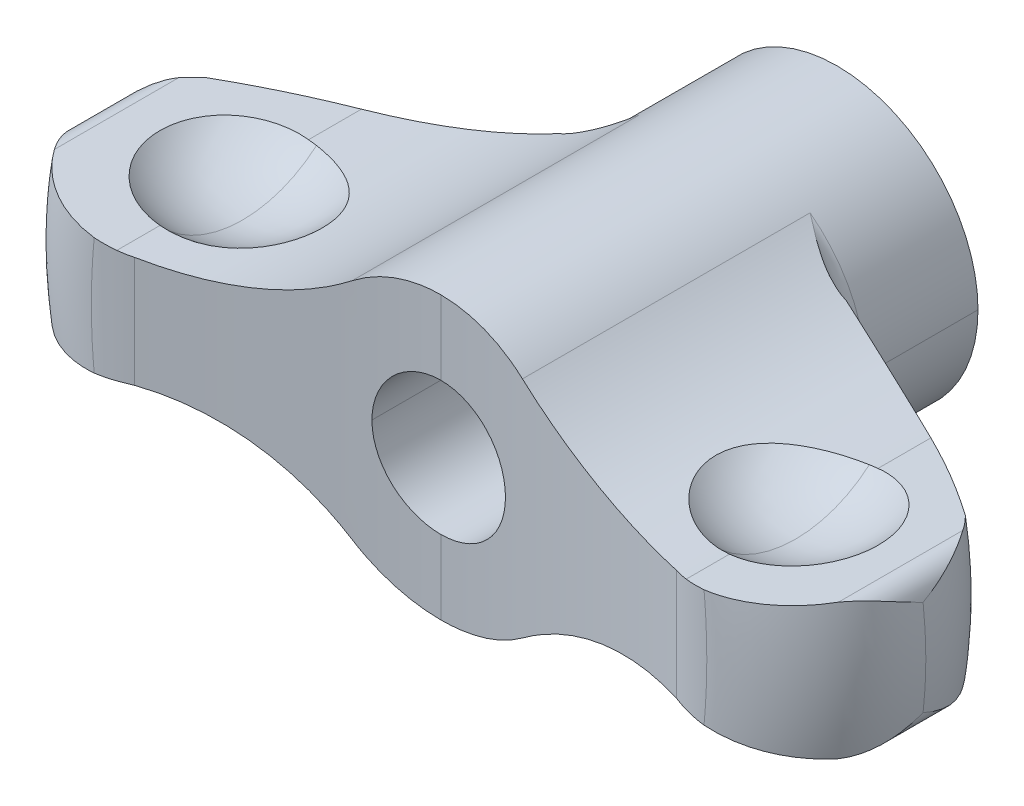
ISO-10303-21;
HEADER;
FILE_DESCRIPTION(('STEP AP214'),'2;1');
FILE_NAME('part.step','',(''),(''),'','','');
FILE_SCHEMA(('AUTOMOTIVE_DESIGN { 1 0 10303 214 1 1 1 1 }'));
ENDSEC;
DATA;
#1=APPLICATION_CONTEXT('core data for automotive mechanical design processes');
#2=APPLICATION_PROTOCOL_DEFINITION('international standard','automotive_design',2000,#1);
#3=PRODUCT_CONTEXT('',#1,'mechanical');
#4=PRODUCT('Part','Part','',(#3));
#5=PRODUCT_RELATED_PRODUCT_CATEGORY('part','',(#4));
#6=PRODUCT_DEFINITION_FORMATION('','',#4);
#7=PRODUCT_DEFINITION_CONTEXT('part definition',#1,'design');
#8=PRODUCT_DEFINITION('design','',#6,#7);
#9=PRODUCT_DEFINITION_SHAPE('','',#8);
#10=(LENGTH_UNIT() NAMED_UNIT(*) SI_UNIT(.MILLI.,.METRE.));
#11=(NAMED_UNIT(*) PLANE_ANGLE_UNIT() SI_UNIT($,.RADIAN.));
#12=(NAMED_UNIT(*) SI_UNIT($,.STERADIAN.) SOLID_ANGLE_UNIT());
#13=UNCERTAINTY_MEASURE_WITH_UNIT(LENGTH_MEASURE(1.E-05),#10,'distance_accuracy_value','');
#14=(GEOMETRIC_REPRESENTATION_CONTEXT(3) GLOBAL_UNCERTAINTY_ASSIGNED_CONTEXT((#13)) GLOBAL_UNIT_ASSIGNED_CONTEXT((#10,
#11,#12)) REPRESENTATION_CONTEXT('',''));
#15=CARTESIAN_POINT('',(0.,0.,0.));
#16=DIRECTION('',(0.,0.,1.));
#17=DIRECTION('',(1.,0.,0.));
#18=AXIS2_PLACEMENT_3D('',#15,#16,#17);
#19=CARTESIAN_POINT('',(0.,0.,10.1999999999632));
#20=DIRECTION('',(0.,0.,1.));
#21=DIRECTION('',(0.,1.,0.));
#22=AXIS2_PLACEMENT_3D('',#19,#20,#21);
#23=CONICAL_SURFACE('',#22,3.19999999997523,0.785398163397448);
#24=CARTESIAN_POINT('',(0.,0.,10.));
#25=DIRECTION('',(0.,0.,-1.));
#26=DIRECTION('',(0.,-1.,0.));
#27=AXIS2_PLACEMENT_3D('',#24,#25,#26);
#28=CIRCLE('',#27,3.);
#29=CARTESIAN_POINT('',(-3.00000000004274,0.,10.));
#30=VERTEX_POINT('',#29);
#31=CARTESIAN_POINT('',(3.,0.,10.));
#32=VERTEX_POINT('',#31);
#33=EDGE_CURVE('E33',#30,#32,#28,.T.);
#34=ORIENTED_EDGE('',*,*,#33,.T.);
#35=DIRECTION('',(-0.707106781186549,0.,-0.707106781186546));
#36=VECTOR('',#35,1.);
#37=CARTESIAN_POINT('',(498993.,-1.83320999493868E-10,499000.));
#38=LINE('',#37,#36);
#39=CARTESIAN_POINT('',(3.19999999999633,0.,10.1999999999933));
#40=VERTEX_POINT('',#39);
#41=EDGE_CURVE('E20',#32,#40,#38,.F.);
#42=ORIENTED_EDGE('',*,*,#41,.T.);
#43=CARTESIAN_POINT('',(0.,0.,10.2));
#44=DIRECTION('',(0.,0.,1.));
#45=DIRECTION('',(0.,1.,0.));
#46=AXIS2_PLACEMENT_3D('',#43,#44,#45);
#47=CIRCLE('',#46,3.2);
#48=CARTESIAN_POINT('',(-3.19999999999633,0.,10.1999999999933));
#49=VERTEX_POINT('',#48);
#50=EDGE_CURVE('E609',#40,#49,#47,.T.);
#51=ORIENTED_EDGE('',*,*,#50,.T.);
#52=DIRECTION('',(0.707106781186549,0.,-0.707106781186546));
#53=VECTOR('',#52,1.);
#54=CARTESIAN_POINT('',(-498993.,1.22213999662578E-10,499000.));
#55=LINE('',#54,#53);
#56=EDGE_CURVE('E581',#49,#30,#55,.T.);
#57=ORIENTED_EDGE('',*,*,#56,.T.);
#58=EDGE_LOOP('',(#34,#42,#51,#57));
#59=FACE_BOUND('',#58,.T.);
#60=ADVANCED_FACE('F14',(#59),#23,.F.);
#61=CARTESIAN_POINT('',(0.,0.,10.1999999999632));
#62=DIRECTION('',(0.,0.,1.));
#63=DIRECTION('',(0.,1.,0.));
#64=AXIS2_PLACEMENT_3D('',#61,#62,#63);
#65=CONICAL_SURFACE('',#64,3.19999999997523,0.785398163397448);
#66=EDGE_CURVE('E1156',#32,#30,#28,.T.);
#67=ORIENTED_EDGE('',*,*,#66,.T.);
#68=ORIENTED_EDGE('',*,*,#56,.F.);
#69=CARTESIAN_POINT('',(0.,0.,10.2));
#70=DIRECTION('',(0.,0.,1.));
#71=DIRECTION('',(0.,1.,0.));
#72=AXIS2_PLACEMENT_3D('',#69,#70,#71);
#73=CIRCLE('',#72,3.2);
#74=EDGE_CURVE('E611',#49,#40,#73,.T.);
#75=ORIENTED_EDGE('',*,*,#74,.T.);
#76=ORIENTED_EDGE('',*,*,#41,.F.);
#77=EDGE_LOOP('',(#67,#68,#75,#76));
#78=FACE_BOUND('',#77,.T.);
#79=ADVANCED_FACE('F599',(#78),#65,.F.);
#80=CARTESIAN_POINT('',(13.25,6.75,15.25));
#81=DIRECTION('',(0.,0.,1.));
#82=DIRECTION('',(-1.,0.,0.));
#83=AXIS2_PLACEMENT_3D('',#80,#81,#82);
#84=SPHERICAL_SURFACE('',#83,5.4);
#85=CARTESIAN_POINT('',(13.25,6.75,15.25));
#86=DIRECTION('',(1.,0.,0.));
#87=DIRECTION('',(0.,0.,1.));
#88=AXIS2_PLACEMENT_3D('',#85,#86,#87);
#89=CIRCLE('',#88,5.4);
#90=CARTESIAN_POINT('',(13.25,1.35,15.25));
#91=VERTEX_POINT('',#90);
#92=CARTESIAN_POINT('',(13.25,2.67341046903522,18.7913864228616));
#93=VERTEX_POINT('',#92);
#94=EDGE_CURVE('E387',#91,#93,#89,.F.);
#95=ORIENTED_EDGE('',*,*,#94,.T.);
#96=CARTESIAN_POINT('',(13.6469742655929,2.7092176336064,18.8101248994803));
#97=CARTESIAN_POINT('',(13.5807778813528,2.70226198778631,18.8096097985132));
#98=CARTESIAN_POINT('',(13.5145985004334,2.69580023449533,18.8077907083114));
#99=CARTESIAN_POINT('',(13.3822737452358,2.6838645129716,18.8015445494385));
#100=CARTESIAN_POINT('',(13.3161283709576,2.67839054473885,18.7971174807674));
#101=CARTESIAN_POINT('',(13.25,2.67341046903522,18.7913864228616));
#102=B_SPLINE_CURVE_WITH_KNOTS('',3,(#96,#97,#98,#99,#100,#101),.UNSPECIFIED.,.F.,.F.,(4,2,4),
(0.,0.199556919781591,0.399113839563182),.UNSPECIFIED.);
#103=CARTESIAN_POINT('',(13.6469742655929,2.70921763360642,18.8101248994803));
#104=VERTEX_POINT('',#103);
#105=EDGE_CURVE('E293',#104,#93,#102,.T.);
#106=ORIENTED_EDGE('',*,*,#105,.F.);
#107=CARTESIAN_POINT('',(13.6469742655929,2.70921763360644,18.8101248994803));
#108=CARTESIAN_POINT('',(13.74655729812,2.71968423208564,18.8109101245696));
#109=CARTESIAN_POINT('',(13.8461684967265,2.73015379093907,18.8074517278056));
#110=CARTESIAN_POINT('',(14.0447432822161,2.751024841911,18.7921164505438));
#111=CARTESIAN_POINT('',(14.1437068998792,2.7614263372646,18.7802399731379));
#112=CARTESIAN_POINT('',(14.3402231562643,2.78208102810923,18.7481486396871));
#113=CARTESIAN_POINT('',(14.4377767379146,2.79233432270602,18.7279396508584));
#114=CARTESIAN_POINT('',(14.6308200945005,2.8126239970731,18.6793483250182));
#115=CARTESIAN_POINT('',(14.7263098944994,2.82266037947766,18.650966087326));
#116=CARTESIAN_POINT('',(15.0087595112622,2.8523470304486,18.5537886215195));
#117=CARTESIAN_POINT('',(15.1917827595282,2.87158354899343,18.4729489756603));
#118=CARTESIAN_POINT('',(15.5415956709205,2.90835036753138,18.2815763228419));
#119=CARTESIAN_POINT('',(15.7083885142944,2.92588100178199,18.1710491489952));
#120=CARTESIAN_POINT('',(16.0211856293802,2.95875730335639,17.9233963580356));
#121=CARTESIAN_POINT('',(16.1671894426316,2.97410292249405,17.7862701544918));
#122=CARTESIAN_POINT('',(16.4342444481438,3.00217153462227,17.489298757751));
#123=CARTESIAN_POINT('',(16.5552918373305,3.01489412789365,17.3294501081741));
#124=CARTESIAN_POINT('',(16.7689741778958,3.03735304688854,16.9915931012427));
#125=CARTESIAN_POINT('',(16.8616103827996,3.04708950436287,16.8135855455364));
#126=CARTESIAN_POINT('',(17.0158402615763,3.06329971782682,16.4444707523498));
#127=CARTESIAN_POINT('',(17.0774359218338,3.06977368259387,16.253364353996));
#128=CARTESIAN_POINT('',(17.1678468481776,3.07927625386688,15.8634621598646));
#129=CARTESIAN_POINT('',(17.1966614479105,3.08230479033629,15.6646662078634));
#130=CARTESIAN_POINT('',(17.2206901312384,3.08483030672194,15.2650270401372));
#131=CARTESIAN_POINT('',(17.2159034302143,3.08432720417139,15.0641837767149));
#132=CARTESIAN_POINT('',(17.1728638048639,3.07980355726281,14.6661578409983));
#133=CARTESIAN_POINT('',(17.1346111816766,3.07578304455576,14.4689751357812));
#134=CARTESIAN_POINT('',(17.0257262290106,3.06433877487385,14.0838669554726));
#135=CARTESIAN_POINT('',(16.9550940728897,3.05691503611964,13.8959414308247));
#136=CARTESIAN_POINT('',(16.7834534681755,3.03887488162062,13.5346771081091));
#137=CARTESIAN_POINT('',(16.6824443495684,3.02825839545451,13.3613386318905));
#138=CARTESIAN_POINT('',(16.4529214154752,3.00413456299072,13.0341801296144));
#139=CARTESIAN_POINT('',(16.3244086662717,2.99062732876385,12.8803593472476));
#140=CARTESIAN_POINT('',(16.0435440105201,2.96110726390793,12.5966116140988));
#141=CARTESIAN_POINT('',(15.8911949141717,2.94509472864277,12.4666818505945));
#142=CARTESIAN_POINT('',(15.5669134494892,2.91101137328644,12.2343486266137));
#143=CARTESIAN_POINT('',(15.3949757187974,2.89293998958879,12.1319527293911));
#144=CARTESIAN_POINT('',(15.0363791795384,2.85524997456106,11.9575956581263));
#145=CARTESIAN_POINT('',(14.8497123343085,2.83563049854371,11.8856512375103));
#146=CARTESIAN_POINT('',(14.4671407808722,2.79542060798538,11.7743939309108));
#147=CARTESIAN_POINT('',(14.2712491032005,2.77483156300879,11.7350363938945));
#148=CARTESIAN_POINT('',(14.0028192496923,2.74661844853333,11.7043866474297));
#149=CARTESIAN_POINT('',(13.9317141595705,2.73914500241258,11.6984560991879));
#150=CARTESIAN_POINT('',(13.7894021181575,2.72418740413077,11.6909286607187));
#151=CARTESIAN_POINT('',(13.718195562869,2.71670329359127,11.6893242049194));
#152=CARTESIAN_POINT('',(13.6469742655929,2.70921763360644,11.6898751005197));
#153=B_SPLINE_CURVE_WITH_KNOTS('',3,(#107,#108,#109,#110,#111,#112,#113,#114,#115,#116,#117,
#118,#119,#120,#121,#122,#123,#124,#125,#126,#127,#128,#129,#130,#131,#132,#133,#134,#135,#136,
#137,#138,#139,#140,#141,#142,#143,#144,#145,#146,#147,#148,#149,#150,#151,#152),.UNSPECIFIED.,
.F.,.F.,(4,2,2,2,2,2,2,2,2,2,2,2,2,2,2,2,2,2,2,2,2,2,4),(0.,0.300306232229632,0.600598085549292,
0.90067885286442,1.20075597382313,1.80065907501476,2.40044439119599,3.00024293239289,
3.60013280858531,4.19999621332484,4.79982122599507,5.39965843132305,5.99950964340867,
6.59935545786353,7.19919806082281,7.79905389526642,8.39888647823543,8.99864839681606,
9.59857489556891,10.1988310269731,10.7982633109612,11.013391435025,11.2281430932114),.UNSPECIFIED.);
#154=CARTESIAN_POINT('',(13.6469742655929,2.70921763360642,11.6898751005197));
#155=VERTEX_POINT('',#154);
#156=EDGE_CURVE('E295',#104,#155,#153,.T.);
#157=ORIENTED_EDGE('',*,*,#156,.T.);
#158=CARTESIAN_POINT('',(13.25,2.67341046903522,11.7086135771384));
#159=CARTESIAN_POINT('',(13.3161283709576,2.67839054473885,11.7028825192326));
#160=CARTESIAN_POINT('',(13.3822737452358,2.6838645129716,11.6984554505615));
#161=CARTESIAN_POINT('',(13.5145985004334,2.69580023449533,11.6922092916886));
#162=CARTESIAN_POINT('',(13.5807778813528,2.70226198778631,11.6903902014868));
#163=CARTESIAN_POINT('',(13.6469742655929,2.7092176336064,11.6898751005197));
#164=B_SPLINE_CURVE_WITH_KNOTS('',3,(#158,#159,#160,#161,#162,#163),.UNSPECIFIED.,.F.,.F.,(4,2,
4),(0.,0.199556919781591,0.399113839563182),.UNSPECIFIED.);
#165=CARTESIAN_POINT('',(13.25,2.67341046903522,11.7086135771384));
#166=VERTEX_POINT('',#165);
#167=EDGE_CURVE('E282',#166,#155,#164,.T.);
#168=ORIENTED_EDGE('',*,*,#167,.F.);
#169=CARTESIAN_POINT('',(13.25,6.75,15.25));
#170=DIRECTION('',(1.,0.,0.));
#171=DIRECTION('',(0.,0.,1.));
#172=AXIS2_PLACEMENT_3D('',#169,#170,#171);
#173=CIRCLE('',#172,5.4);
#174=EDGE_CURVE('E301',#166,#91,#173,.F.);
#175=ORIENTED_EDGE('',*,*,#174,.T.);
#176=EDGE_LOOP('',(#95,#106,#157,#168,#175));
#177=FACE_BOUND('',#176,.T.);
#178=ADVANCED_FACE('F16',(#177),#84,.F.);
#179=CARTESIAN_POINT('',(18.7921747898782,2.16666666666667,0.));
#180=DIRECTION('',(0.,0.,-1.));
#181=DIRECTION('',(0.,-1.,0.));
#182=AXIS2_PLACEMENT_3D('',#179,#180,#181);
#183=CYLINDRICAL_SURFACE('',#182,1.08333333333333);
#184=CARTESIAN_POINT('',(18.7921747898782,3.24999999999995,12.7683461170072));
#185=CARTESIAN_POINT('',(18.8135715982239,3.24999640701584,12.7989003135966));
#186=CARTESIAN_POINT('',(18.8347154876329,3.24933763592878,12.8296272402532));
#187=CARTESIAN_POINT('',(18.8772398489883,3.24676485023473,12.8925373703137));
#188=CARTESIAN_POINT('',(18.8986001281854,3.24480529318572,12.9247323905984));
#189=CARTESIAN_POINT('',(18.9414804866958,3.23960687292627,12.9906061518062));
#190=CARTESIAN_POINT('',(18.9629778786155,3.2363238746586,13.0242961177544));
#191=CARTESIAN_POINT('',(19.0060532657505,3.22845012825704,13.0931868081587));
#192=CARTESIAN_POINT('',(19.0276062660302,3.22381652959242,13.1283982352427));
#193=CARTESIAN_POINT('',(19.0707082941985,3.21321405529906,13.2003561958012));
#194=CARTESIAN_POINT('',(19.0922300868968,3.20720366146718,13.2371128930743));
#195=CARTESIAN_POINT('',(19.1351805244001,3.19381975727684,13.3121832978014));
#196=CARTESIAN_POINT('',(19.1565797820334,3.18640604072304,13.3505066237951));
#197=CARTESIAN_POINT('',(19.1991911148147,3.17018797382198,13.4287292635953));
#198=CARTESIAN_POINT('',(19.2203717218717,3.16134471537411,13.4686376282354));
#199=CARTESIAN_POINT('',(19.2624469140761,3.14224046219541,13.5500460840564));
#200=CARTESIAN_POINT('',(19.2833080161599,3.13194183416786,13.5915546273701));
#201=CARTESIAN_POINT('',(19.3246405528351,3.10990052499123,13.6761756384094));
#202=CARTESIAN_POINT('',(19.3450765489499,3.09812146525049,13.719295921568));
#203=CARTESIAN_POINT('',(19.3854504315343,3.07309363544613,13.8071484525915));
#204=CARTESIAN_POINT('',(19.4053509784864,3.05980971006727,13.8518878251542));
#205=CARTESIAN_POINT('',(19.4445408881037,3.03174888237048,13.9429830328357));
#206=CARTESIAN_POINT('',(19.4637910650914,3.01693806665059,13.9893452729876));
#207=CARTESIAN_POINT('',(19.5015621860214,2.98579715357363,14.0836828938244));
#208=CARTESIAN_POINT('',(19.5200421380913,2.96943422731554,14.1316638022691));
#209=CARTESIAN_POINT('',(19.5663126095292,2.92554403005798,14.256700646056));
#210=CARTESIAN_POINT('',(19.593016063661,2.89722239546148,14.3338827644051));
#211=CARTESIAN_POINT('',(19.6452451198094,2.83566369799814,14.4960825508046));
#212=CARTESIAN_POINT('',(19.6704074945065,2.80221611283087,14.5811366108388));
#213=CARTESIAN_POINT('',(19.7184399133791,2.73024644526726,14.7591391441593));
#214=CARTESIAN_POINT('',(19.7409101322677,2.69153722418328,14.8521202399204));
#215=CARTESIAN_POINT('',(19.7756642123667,2.62208726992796,15.0146110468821));
#216=CARTESIAN_POINT('',(19.789085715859,2.59181994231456,15.0840836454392));
#217=CARTESIAN_POINT('',(19.8164605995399,2.52176978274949,15.2429472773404));
#218=CARTESIAN_POINT('',(19.8294805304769,2.48172793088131,15.33238631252));
#219=CARTESIAN_POINT('',(19.8531035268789,2.39168225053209,15.5312015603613));
#220=CARTESIAN_POINT('',(19.8625335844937,2.34143532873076,15.6406084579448));
#221=CARTESIAN_POINT('',(19.8683786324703,2.29074889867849,15.75));
#222=B_SPLINE_CURVE_WITH_KNOTS('',3,(#184,#185,#186,#187,#188,#189,#190,#191,#192,#193,#194,
#195,#196,#197,#198,#199,#200,#201,#202,#203,#204,#205,#206,#207,#208,#209,#210,#211,#212,#213,
#214,#215,#216,#217,#218,#219,#220,#221),.UNSPECIFIED.,.F.,.F.,(4,2,2,2,2,2,2,2,2,2,2,2,2,2,2,2,
2,2,4),(0.,0.111891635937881,0.227923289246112,0.348195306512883,0.472800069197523,
0.601822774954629,0.735342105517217,0.87343079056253,1.01615607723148,1.16358011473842,
1.31576026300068,1.4727493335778,1.63459577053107,1.89380891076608,2.17807275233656,
2.48748871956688,2.71831204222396,3.01475351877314,3.3768163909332),.UNSPECIFIED.);
#223=CARTESIAN_POINT('',(18.7921747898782,3.25,12.7683461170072));
#224=VERTEX_POINT('',#223);
#225=CARTESIAN_POINT('',(19.8683786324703,2.29074889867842,15.75));
#226=VERTEX_POINT('',#225);
#227=EDGE_CURVE('E391',#224,#226,#222,.T.);
#228=ORIENTED_EDGE('',*,*,#227,.F.);
#229=DIRECTION('',(0.,0.,1.));
#230=VECTOR('',#229,1.);
#231=CARTESIAN_POINT('',(18.7921747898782,3.25,0.));
#232=LINE('',#231,#230);
#233=CARTESIAN_POINT('',(18.7921747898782,3.25,18.7316538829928));
#234=VERTEX_POINT('',#233);
#235=EDGE_CURVE('E545',#224,#234,#232,.T.);
#236=ORIENTED_EDGE('',*,*,#235,.T.);
#237=CARTESIAN_POINT('',(19.8683786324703,2.29074889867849,15.75));
#238=CARTESIAN_POINT('',(19.8625340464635,2.34143137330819,15.8593826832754));
#239=CARTESIAN_POINT('',(19.8531050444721,2.39167418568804,15.9687808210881));
#240=CARTESIAN_POINT('',(19.8294841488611,2.48171591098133,16.1675873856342));
#241=CARTESIAN_POINT('',(19.8164646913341,2.52175779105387,16.257026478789));
#242=CARTESIAN_POINT('',(19.7890891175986,2.59181211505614,16.4158989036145));
#243=CARTESIAN_POINT('',(19.7756660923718,2.62208342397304,16.4853802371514));
#244=CARTESIAN_POINT('',(19.7409127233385,2.69153216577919,16.6478675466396));
#245=CARTESIAN_POINT('',(19.7184457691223,2.73023663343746,16.7408364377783));
#246=CARTESIAN_POINT('',(19.6704179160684,2.80220176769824,16.9188270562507));
#247=CARTESIAN_POINT('',(19.6452561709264,2.83564930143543,17.0038813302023));
#248=CARTESIAN_POINT('',(19.593024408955,2.89721302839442,17.1660933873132));
#249=CARTESIAN_POINT('',(19.5663170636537,2.9255393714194,17.2432875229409));
#250=CARTESIAN_POINT('',(19.5200425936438,2.96943406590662,17.3683348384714));
#251=CARTESIAN_POINT('',(19.5015631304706,2.98579699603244,17.4163143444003));
#252=CARTESIAN_POINT('',(19.4637929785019,3.01693784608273,17.5106494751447));
#253=CARTESIAN_POINT('',(19.4445432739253,3.03174859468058,17.5570106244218));
#254=CARTESIAN_POINT('',(19.4053542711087,3.0598093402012,17.6481039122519));
#255=CARTESIAN_POINT('',(19.385454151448,3.07309324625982,17.6928424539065));
#256=CARTESIAN_POINT('',(19.3450810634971,3.09812105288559,17.7806935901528));
#257=CARTESIAN_POINT('',(19.3246454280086,3.10990010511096,17.8238133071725));
#258=CARTESIAN_POINT('',(19.2833135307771,3.13194141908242,17.9084334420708));
#259=CARTESIAN_POINT('',(19.2624527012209,3.14224005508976,17.9499416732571));
#260=CARTESIAN_POINT('',(19.2203779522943,3.16134433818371,18.03134975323));
#261=CARTESIAN_POINT('',(19.1991975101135,3.17018761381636,18.0712580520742));
#262=CARTESIAN_POINT('',(19.1565863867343,3.18640572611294,18.1494807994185));
#263=CARTESIAN_POINT('',(19.1351871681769,3.19381946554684,18.1878042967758));
#264=CARTESIAN_POINT('',(19.0922366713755,3.20720342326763,18.2628752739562));
#265=CARTESIAN_POINT('',(19.0707147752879,3.21321384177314,18.2996323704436));
#266=CARTESIAN_POINT('',(19.0276123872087,3.22381637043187,18.3715913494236));
#267=CARTESIAN_POINT('',(19.0060591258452,3.22844999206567,18.4068033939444));
#268=CARTESIAN_POINT('',(18.9629830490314,3.2363237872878,18.4756955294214));
#269=CARTESIAN_POINT('',(18.9414852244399,3.23960680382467,18.509386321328));
#270=CARTESIAN_POINT('',(18.8986038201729,3.24480526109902,18.5752619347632));
#271=CARTESIAN_POINT('',(18.8772429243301,3.24676482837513,18.6074579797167));
#272=CARTESIAN_POINT('',(18.8347171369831,3.24933763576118,18.6703703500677));
#273=CARTESIAN_POINT('',(18.8135724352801,3.24999640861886,18.7010984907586));
#274=CARTESIAN_POINT('',(18.7921747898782,3.24999999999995,18.7316538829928));
#275=B_SPLINE_CURVE_WITH_KNOTS('',3,(#237,#238,#239,#240,#241,#242,#243,#244,#245,#246,#247,
#248,#249,#250,#251,#252,#253,#254,#255,#256,#257,#258,#259,#260,#261,#262,#263,#264,#265,#266,
#267,#268,#269,#270,#271,#272,#273,#274),.UNSPECIFIED.,.F.,.F.,(4,2,2,2,2,2,2,2,2,2,2,2,2,2,2,2,
2,2,4),(0.,0.362033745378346,0.658475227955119,0.889327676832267,1.19870323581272,
1.4829670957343,1.74222062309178,1.90406282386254,2.06104841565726,2.21322584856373,
2.3606479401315,2.50337205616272,2.6414603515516,2.77498007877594,2.90400397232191,
3.02861071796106,3.14888551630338,3.26492075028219,3.37681676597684),.UNSPECIFIED.);
#276=EDGE_CURVE('E498',#226,#234,#275,.T.);
#277=ORIENTED_EDGE('',*,*,#276,.F.);
#278=EDGE_LOOP('',(#228,#236,#277));
#279=FACE_BOUND('',#278,.T.);
#280=ADVANCED_FACE('F1191',(#279),#183,.T.);
#281=CARTESIAN_POINT('',(-18.7921747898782,2.16666666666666,0.));
#282=DIRECTION('',(0.,0.,-1.));
#283=DIRECTION('',(0.,-1.,0.));
#284=AXIS2_PLACEMENT_3D('',#281,#282,#283);
#285=CYLINDRICAL_SURFACE('',#284,1.08333333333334);
#286=DIRECTION('',(0.,0.,1.));
#287=VECTOR('',#286,1.);
#288=CARTESIAN_POINT('',(-18.7921747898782,3.25,0.));
#289=LINE('',#288,#287);
#290=CARTESIAN_POINT('',(-18.7921747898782,3.25,18.7316538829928));
#291=VERTEX_POINT('',#290);
#292=CARTESIAN_POINT('',(-18.7921747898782,3.25,12.7683461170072));
#293=VERTEX_POINT('',#292);
#294=EDGE_CURVE('E1270',#291,#293,#289,.F.);
#295=ORIENTED_EDGE('',*,*,#294,.T.);
#296=CARTESIAN_POINT('',(-19.868378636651,2.29074886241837,15.75));
#297=CARTESIAN_POINT('',(-19.862534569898,2.34142684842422,15.6406277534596));
#298=CARTESIAN_POINT('',(-19.8531067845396,2.39166508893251,15.5312399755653));
#299=CARTESIAN_POINT('',(-19.8294883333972,2.48170242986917,15.332443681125));
#300=CARTESIAN_POINT('',(-19.816469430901,2.52174438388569,15.2430045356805));
#301=CARTESIAN_POINT('',(-19.7890930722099,2.59180333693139,15.0841217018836));
#302=CARTESIAN_POINT('',(-19.7756682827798,2.62207909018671,15.0146300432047));
#303=CARTESIAN_POINT('',(-19.7409127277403,2.691532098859,14.8521324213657));
#304=CARTESIAN_POINT('',(-19.7184457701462,2.73023661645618,14.7591635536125));
#305=CARTESIAN_POINT('',(-19.6704179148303,2.80220178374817,14.581172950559));
#306=CARTESIAN_POINT('',(-19.6452561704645,2.83564930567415,14.4961186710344));
#307=CARTESIAN_POINT('',(-19.5930244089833,2.89721302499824,14.3339066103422));
#308=CARTESIAN_POINT('',(-19.5663170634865,2.92553937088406,14.2567124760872));
#309=CARTESIAN_POINT('',(-19.5200425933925,2.96943406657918,14.1316651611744));
#310=CARTESIAN_POINT('',(-19.5015631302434,2.98579699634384,14.0836856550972));
#311=CARTESIAN_POINT('',(-19.4637929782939,3.01693784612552,13.9893505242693));
#312=CARTESIAN_POINT('',(-19.4445432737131,3.03174859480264,13.9429893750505));
#313=CARTESIAN_POINT('',(-19.4053542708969,3.0598093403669,13.8518960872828));
#314=CARTESIAN_POINT('',(-19.3854541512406,3.07309324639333,13.8071575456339));
#315=CARTESIAN_POINT('',(-19.3450810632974,3.09812105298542,13.7193064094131));
#316=CARTESIAN_POINT('',(-19.3246454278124,3.10990010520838,13.6761866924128));
#317=CARTESIAN_POINT('',(-19.2833135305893,3.13194141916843,13.5915665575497));
#318=CARTESIAN_POINT('',(-19.262452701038,3.14224005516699,13.5500583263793));
#319=CARTESIAN_POINT('',(-19.2203779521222,3.16134433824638,13.4686502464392));
#320=CARTESIAN_POINT('',(-19.1991975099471,3.17018761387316,13.4287419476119));
#321=CARTESIAN_POINT('',(-19.1565863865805,3.18640572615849,13.3505192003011));
#322=CARTESIAN_POINT('',(-19.1351871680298,3.19381946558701,13.3121957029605));
#323=CARTESIAN_POINT('',(-19.0922366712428,3.20720342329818,13.2371247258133));
#324=CARTESIAN_POINT('',(-19.0707147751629,3.21321384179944,13.2003676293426));
#325=CARTESIAN_POINT('',(-19.0276123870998,3.22381637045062,13.1284086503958));
#326=CARTESIAN_POINT('',(-19.0060591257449,3.22844999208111,13.0931966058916));
#327=CARTESIAN_POINT('',(-18.9629830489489,3.2363237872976,13.0243044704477));
#328=CARTESIAN_POINT('',(-18.9414852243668,3.23960680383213,12.9906136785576));
#329=CARTESIAN_POINT('',(-18.8986038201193,3.24480526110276,12.9247380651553));
#330=CARTESIAN_POINT('',(-18.8772429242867,3.24676482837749,12.8925420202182));
#331=CARTESIAN_POINT('',(-18.8347171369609,3.24933763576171,12.8296296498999));
#332=CARTESIAN_POINT('',(-18.8135724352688,3.24999640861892,12.7989015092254));
#333=CARTESIAN_POINT('',(-18.7921747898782,3.25000000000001,12.7683461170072));
#334=B_SPLINE_CURVE_WITH_KNOTS('',3,(#296,#297,#298,#299,#300,#301,#302,#303,#304,#305,#306,
#307,#308,#309,#310,#311,#312,#313,#314,#315,#316,#317,#318,#319,#320,#321,#322,#323,#324,#325,
#326,#327,#328,#329,#330,#331,#332,#333),.UNSPECIFIED.,.F.,.F.,(4,2,2,2,2,2,2,2,2,2,2,2,2,2,2,2,
2,2,4),(0.,0.361999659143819,0.65844115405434,0.889327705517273,1.19870326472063,
1.48296712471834,1.74222065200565,1.90406285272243,2.0610484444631,2.2132258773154,
2.36064796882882,2.5033720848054,2.64146038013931,2.77498010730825,2.90400400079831,
3.02861074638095,3.14888554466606,3.26492077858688,3.37681679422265),.UNSPECIFIED.);
#335=CARTESIAN_POINT('',(-19.8683786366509,2.29074886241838,15.75));
#336=VERTEX_POINT('',#335);
#337=EDGE_CURVE('E898',#336,#293,#334,.T.);
#338=ORIENTED_EDGE('',*,*,#337,.F.);
#339=CARTESIAN_POINT('',(-18.7921747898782,3.25000000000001,18.7316538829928));
#340=CARTESIAN_POINT('',(-18.813571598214,3.24999640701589,18.7010996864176));
#341=CARTESIAN_POINT('',(-18.8347154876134,3.24933763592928,18.6703727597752));
#342=CARTESIAN_POINT('',(-18.87723984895,3.24676485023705,18.6074626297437));
#343=CARTESIAN_POINT('',(-18.8986001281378,3.24480529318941,18.5752676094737));
#344=CARTESIAN_POINT('',(-18.9414804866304,3.23960687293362,18.5093938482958));
#345=CARTESIAN_POINT('',(-18.9629778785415,3.23632387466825,18.4757038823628));
#346=CARTESIAN_POINT('',(-19.0060532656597,3.22845012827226,18.4068131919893));
#347=CARTESIAN_POINT('',(-19.0276062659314,3.22381652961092,18.3716017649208));
#348=CARTESIAN_POINT('',(-19.070708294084,3.21321405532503,18.2996438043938));
#349=CARTESIAN_POINT('',(-19.0922300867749,3.20720366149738,18.2628871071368));
#350=CARTESIAN_POINT('',(-19.1351805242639,3.19381975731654,18.187816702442));
#351=CARTESIAN_POINT('',(-19.1565797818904,3.18640604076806,18.1494933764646));
#352=CARTESIAN_POINT('',(-19.1991911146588,3.17018797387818,18.0712707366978));
#353=CARTESIAN_POINT('',(-19.2203717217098,3.16134471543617,18.0313623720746));
#354=CARTESIAN_POINT('',(-19.2624469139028,3.14224046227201,17.9499539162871));
#355=CARTESIAN_POINT('',(-19.2833080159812,3.13194183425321,17.9084453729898));
#356=CARTESIAN_POINT('',(-19.3246405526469,3.10990052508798,17.8238243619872));
#357=CARTESIAN_POINT('',(-19.3450765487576,3.09812146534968,17.7807040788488));
#358=CARTESIAN_POINT('',(-19.3854504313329,3.07309363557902,17.6928515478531));
#359=CARTESIAN_POINT('',(-19.40535097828,3.05980971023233,17.6481121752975));
#360=CARTESIAN_POINT('',(-19.4445408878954,3.03174888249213,17.5570169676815));
#361=CARTESIAN_POINT('',(-19.4637910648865,3.01693806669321,17.5106547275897));
#362=CARTESIAN_POINT('',(-19.5015621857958,2.98579715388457,17.4163171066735));
#363=CARTESIAN_POINT('',(-19.5200421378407,2.9694342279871,17.3683361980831));
#364=CARTESIAN_POINT('',(-19.5663126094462,2.92554402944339,17.2432993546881));
#365=CARTESIAN_POINT('',(-19.593016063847,2.89722239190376,17.1661172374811));
#366=CARTESIAN_POINT('',(-19.6452451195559,2.8356637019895,17.0039174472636));
#367=CARTESIAN_POINT('',(-19.6704074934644,2.80221612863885,16.9188633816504));
#368=CARTESIAN_POINT('',(-19.7184399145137,2.73024642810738,16.7408608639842));
#369=CARTESIAN_POINT('',(-19.7409101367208,2.6915371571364,16.6478797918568));
#370=CARTESIAN_POINT('',(-19.7756664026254,2.62208293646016,16.4853786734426));
#371=CARTESIAN_POINT('',(-19.7890896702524,2.59181116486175,16.4158957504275));
#372=CARTESIAN_POINT('',(-19.8164653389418,2.52175637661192,16.2570217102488));
#373=CARTESIAN_POINT('',(-19.8294847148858,2.48171445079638,16.1675826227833));
#374=CARTESIAN_POINT('',(-19.8531052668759,2.39167315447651,15.9687776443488));
#375=CARTESIAN_POINT('',(-19.8625341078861,2.34143080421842,15.8593811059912));
#376=CARTESIAN_POINT('',(-19.868378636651,2.29074886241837,15.75));
#377=B_SPLINE_CURVE_WITH_KNOTS('',3,(#339,#340,#341,#342,#343,#344,#345,#346,#347,#348,#349,
#350,#351,#352,#353,#354,#355,#356,#357,#358,#359,#360,#361,#362,#363,#364,#365,#366,#367,#368,
#369,#370,#371,#372,#373,#374,#375,#376),.UNSPECIFIED.,.F.,.F.,(4,2,2,2,2,2,2,2,2,2,2,2,2,2,2,2,
2,2,4),(0.,0.111891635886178,0.227923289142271,0.348195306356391,0.472800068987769,
0.601822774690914,0.735342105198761,0.87343079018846,1.01615607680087,1.16358011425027,
1.31576026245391,1.47274933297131,1.63459576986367,1.89380891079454,2.17807275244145,
2.48748871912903,2.71834614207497,3.0147876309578,3.37681641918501),.UNSPECIFIED.);
#378=EDGE_CURVE('E871',#291,#336,#377,.T.);
#379=ORIENTED_EDGE('',*,*,#378,.F.);
#380=EDGE_LOOP('',(#295,#338,#379));
#381=FACE_BOUND('',#380,.T.);
#382=ADVANCED_FACE('F1195',(#381),#285,.T.);
#383=CARTESIAN_POINT('',(-13.25,6.75,15.25));
#384=DIRECTION('',(0.,0.,1.));
#385=DIRECTION('',(-1.,0.,0.));
#386=AXIS2_PLACEMENT_3D('',#383,#384,#385);
#387=SPHERICAL_SURFACE('',#386,5.4);
#388=CARTESIAN_POINT('',(-13.6469742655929,2.7092176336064,11.6898751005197));
#389=CARTESIAN_POINT('',(-13.5807778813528,2.70226198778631,11.6903902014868));
#390=CARTESIAN_POINT('',(-13.5145985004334,2.69580023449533,11.6922092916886));
#391=CARTESIAN_POINT('',(-13.3822737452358,2.6838645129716,11.6984554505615));
#392=CARTESIAN_POINT('',(-13.3161283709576,2.67839054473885,11.7028825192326));
#393=CARTESIAN_POINT('',(-13.25,2.67341046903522,11.7086135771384));
#394=B_SPLINE_CURVE_WITH_KNOTS('',3,(#388,#389,#390,#391,#392,#393),.UNSPECIFIED.,.F.,.F.,(4,2,
4),(0.,0.199556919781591,0.399113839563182),.UNSPECIFIED.);
#395=CARTESIAN_POINT('',(-13.6469742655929,2.70921763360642,11.6898751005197));
#396=VERTEX_POINT('',#395);
#397=CARTESIAN_POINT('',(-13.25,2.67341046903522,11.7086135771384));
#398=VERTEX_POINT('',#397);
#399=EDGE_CURVE('E1221',#396,#398,#394,.T.);
#400=ORIENTED_EDGE('',*,*,#399,.F.);
#401=CARTESIAN_POINT('',(-13.6469742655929,2.70921763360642,11.6898751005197));
#402=CARTESIAN_POINT('',(-13.74655729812,2.71968423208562,11.6890898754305));
#403=CARTESIAN_POINT('',(-13.8461684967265,2.73015379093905,11.6925482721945));
#404=CARTESIAN_POINT('',(-14.0447432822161,2.75102484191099,11.7078835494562));
#405=CARTESIAN_POINT('',(-14.1437068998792,2.76142633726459,11.7197600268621));
#406=CARTESIAN_POINT('',(-14.3402231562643,2.78208102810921,11.7518513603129));
#407=CARTESIAN_POINT('',(-14.4377767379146,2.792334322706,11.7720603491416));
#408=CARTESIAN_POINT('',(-14.6308200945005,2.81262399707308,11.8206516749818));
#409=CARTESIAN_POINT('',(-14.7263098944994,2.82266037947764,11.849033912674));
#410=CARTESIAN_POINT('',(-15.0087595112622,2.85234703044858,11.9462113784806));
#411=CARTESIAN_POINT('',(-15.1917827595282,2.87158354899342,12.0270510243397));
#412=CARTESIAN_POINT('',(-15.5415956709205,2.90835036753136,12.2184236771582));
#413=CARTESIAN_POINT('',(-15.7083885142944,2.92588100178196,12.3289508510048));
#414=CARTESIAN_POINT('',(-16.0211856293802,2.95875730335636,12.5766036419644));
#415=CARTESIAN_POINT('',(-16.1671894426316,2.97410292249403,12.7137298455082));
#416=CARTESIAN_POINT('',(-16.4342444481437,3.00217153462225,13.010701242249));
#417=CARTESIAN_POINT('',(-16.5552918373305,3.01489412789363,13.1705498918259));
#418=CARTESIAN_POINT('',(-16.7689741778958,3.03735304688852,13.5084068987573));
#419=CARTESIAN_POINT('',(-16.8616103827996,3.04708950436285,13.6864144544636));
#420=CARTESIAN_POINT('',(-17.0158402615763,3.06329971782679,14.0555292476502));
#421=CARTESIAN_POINT('',(-17.0774359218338,3.06977368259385,14.246635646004));
#422=CARTESIAN_POINT('',(-17.1678468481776,3.07927625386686,14.6365378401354));
#423=CARTESIAN_POINT('',(-17.1966614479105,3.08230479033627,14.8353337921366));
#424=CARTESIAN_POINT('',(-17.2206901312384,3.08483030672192,15.2349729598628));
#425=CARTESIAN_POINT('',(-17.2159034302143,3.08432720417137,15.4358162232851));
#426=CARTESIAN_POINT('',(-17.1728638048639,3.07980355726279,15.8338421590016));
#427=CARTESIAN_POINT('',(-17.1346111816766,3.07578304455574,16.0310248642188));
#428=CARTESIAN_POINT('',(-17.0257262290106,3.06433877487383,16.4161330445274));
#429=CARTESIAN_POINT('',(-16.9550940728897,3.05691503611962,16.6040585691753));
#430=CARTESIAN_POINT('',(-16.7834534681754,3.0388748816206,16.9653228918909));
#431=CARTESIAN_POINT('',(-16.6824443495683,3.02825839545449,17.1386613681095));
#432=CARTESIAN_POINT('',(-16.4529214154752,3.0041345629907,17.4658198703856));
#433=CARTESIAN_POINT('',(-16.3244086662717,2.99062732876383,17.6196406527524));
#434=CARTESIAN_POINT('',(-16.0435440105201,2.96110726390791,17.9033883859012));
#435=CARTESIAN_POINT('',(-15.8911949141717,2.94509472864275,18.0333181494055));
#436=CARTESIAN_POINT('',(-15.5669134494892,2.91101137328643,18.2656513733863));
#437=CARTESIAN_POINT('',(-15.3949757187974,2.89293998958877,18.3680472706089));
#438=CARTESIAN_POINT('',(-15.0363791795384,2.85524997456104,18.5424043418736));
#439=CARTESIAN_POINT('',(-14.8497123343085,2.83563049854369,18.6143487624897));
#440=CARTESIAN_POINT('',(-14.4671407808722,2.79542060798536,18.7256060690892));
#441=CARTESIAN_POINT('',(-14.2712491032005,2.77483156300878,18.7649636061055));
#442=CARTESIAN_POINT('',(-14.0028192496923,2.74661844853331,18.7956133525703));
#443=CARTESIAN_POINT('',(-13.9317141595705,2.73914500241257,18.8015439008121));
#444=CARTESIAN_POINT('',(-13.7894021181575,2.72418740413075,18.8090713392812));
#445=CARTESIAN_POINT('',(-13.718195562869,2.71670329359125,18.8106757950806));
#446=CARTESIAN_POINT('',(-13.6469742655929,2.70921763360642,18.8101248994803));
#447=B_SPLINE_CURVE_WITH_KNOTS('',3,(#401,#402,#403,#404,#405,#406,#407,#408,#409,#410,#411,
#412,#413,#414,#415,#416,#417,#418,#419,#420,#421,#422,#423,#424,#425,#426,#427,#428,#429,#430,
#431,#432,#433,#434,#435,#436,#437,#438,#439,#440,#441,#442,#443,#444,#445,#446),.UNSPECIFIED.,
.F.,.F.,(4,2,2,2,2,2,2,2,2,2,2,2,2,2,2,2,2,2,2,2,2,2,4),(0.,0.30030623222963,0.60059808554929,
0.900678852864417,1.20075597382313,1.80065907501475,2.40044439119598,3.00024293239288,
3.60013280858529,4.19999621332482,4.79982122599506,5.39965843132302,5.99950964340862,
6.5993554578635,7.19919806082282,7.7990538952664,8.39888647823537,8.99864839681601,
9.59857489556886,10.198831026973,10.7982633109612,11.0133914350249,11.2281430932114),.UNSPECIFIED.);
#448=CARTESIAN_POINT('',(-13.6469742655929,2.70921763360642,18.8101248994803));
#449=VERTEX_POINT('',#448);
#450=EDGE_CURVE('E472',#396,#449,#447,.T.);
#451=ORIENTED_EDGE('',*,*,#450,.T.);
#452=CARTESIAN_POINT('',(-13.25,2.67341046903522,18.7913864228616));
#453=CARTESIAN_POINT('',(-13.3161283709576,2.67839054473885,18.7971174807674));
#454=CARTESIAN_POINT('',(-13.3822737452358,2.6838645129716,18.8015445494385));
#455=CARTESIAN_POINT('',(-13.5145985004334,2.69580023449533,18.8077907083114));
#456=CARTESIAN_POINT('',(-13.5807778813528,2.70226198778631,18.8096097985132));
#457=CARTESIAN_POINT('',(-13.6469742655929,2.7092176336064,18.8101248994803));
#458=B_SPLINE_CURVE_WITH_KNOTS('',3,(#452,#453,#454,#455,#456,#457),.UNSPECIFIED.,.F.,.F.,(4,2,
4),(0.,0.199556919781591,0.399113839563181),.UNSPECIFIED.);
#459=CARTESIAN_POINT('',(-13.25,2.67341046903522,18.7913864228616));
#460=VERTEX_POINT('',#459);
#461=EDGE_CURVE('E1223',#460,#449,#458,.T.);
#462=ORIENTED_EDGE('',*,*,#461,.F.);
#463=CARTESIAN_POINT('',(-13.25,6.75,15.25));
#464=DIRECTION('',(1.,0.,0.));
#465=DIRECTION('',(0.,0.,1.));
#466=AXIS2_PLACEMENT_3D('',#463,#464,#465);
#467=CIRCLE('',#466,5.4);
#468=CARTESIAN_POINT('',(-13.25,1.35,15.25));
#469=VERTEX_POINT('',#468);
#470=EDGE_CURVE('E1277',#460,#469,#467,.T.);
#471=ORIENTED_EDGE('',*,*,#470,.T.);
#472=CARTESIAN_POINT('',(-13.25,6.75,15.25));
#473=DIRECTION('',(1.,0.,0.));
#474=DIRECTION('',(0.,0.,1.));
#475=AXIS2_PLACEMENT_3D('',#472,#473,#474);
#476=CIRCLE('',#475,5.4);
#477=EDGE_CURVE('E1274',#469,#398,#476,.T.);
#478=ORIENTED_EDGE('',*,*,#477,.T.);
#479=EDGE_LOOP('',(#400,#451,#462,#471,#478));
#480=FACE_BOUND('',#479,.T.);
#481=ADVANCED_FACE('F1199',(#480),#387,.F.);
#482=CARTESIAN_POINT('',(18.7921747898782,-2.16666666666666,0.));
#483=DIRECTION('',(0.,0.,-1.));
#484=DIRECTION('',(0.,-1.,0.));
#485=AXIS2_PLACEMENT_3D('',#482,#483,#484);
#486=CYLINDRICAL_SURFACE('',#485,1.08333333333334);
#487=CARTESIAN_POINT('',(18.7921747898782,-3.24999999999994,18.7316538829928));
#488=CARTESIAN_POINT('',(18.8135715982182,-3.24999640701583,18.7010996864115));
#489=CARTESIAN_POINT('',(18.8347154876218,-3.24933763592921,18.6703727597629));
#490=CARTESIAN_POINT('',(18.8772398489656,-3.24676485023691,18.6074626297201));
#491=CARTESIAN_POINT('',(18.8986001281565,-3.24480529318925,18.575267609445));
#492=CARTESIAN_POINT('',(18.9414804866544,-3.23960687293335,18.5093938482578));
#493=CARTESIAN_POINT('',(18.9629778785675,-3.23632387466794,18.4757038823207));
#494=CARTESIAN_POINT('',(19.0060532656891,-3.22845012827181,18.4068131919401));
#495=CARTESIAN_POINT('',(19.027606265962,-3.22381652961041,18.3716017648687));
#496=CARTESIAN_POINT('',(19.0707082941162,-3.21321405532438,18.2996438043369));
#497=CARTESIAN_POINT('',(19.0922300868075,-3.20720366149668,18.2628871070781));
#498=CARTESIAN_POINT('',(19.1351805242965,-3.19381975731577,18.1878167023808));
#499=CARTESIAN_POINT('',(19.1565797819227,-3.18640604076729,18.1494933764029));
#500=CARTESIAN_POINT('',(19.1991911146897,-3.17018797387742,18.0712707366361));
#501=CARTESIAN_POINT('',(19.2203717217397,-3.16134471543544,18.0313623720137));
#502=CARTESIAN_POINT('',(19.2624469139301,-3.1422404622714,17.9499539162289));
#503=CARTESIAN_POINT('',(19.283308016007,-3.13194183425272,17.9084453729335));
#504=CARTESIAN_POINT('',(19.3246405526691,-3.10990052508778,17.8238243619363));
#505=CARTESIAN_POINT('',(19.3450765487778,-3.09812146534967,17.7807040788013));
#506=CARTESIAN_POINT('',(19.3854504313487,-3.07309363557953,17.6928515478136));
#507=CARTESIAN_POINT('',(19.4053509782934,-3.05980971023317,17.6481121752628));
#508=CARTESIAN_POINT('',(19.4445408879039,-3.03174888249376,17.5570169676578));
#509=CARTESIAN_POINT('',(19.4637910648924,-3.01693806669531,17.5106547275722));
#510=CARTESIAN_POINT('',(19.5015621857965,-2.98579715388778,17.4163171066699));
#511=CARTESIAN_POINT('',(19.5200421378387,-2.96943422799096,17.3683361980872));
#512=CARTESIAN_POINT('',(19.5663126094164,-2.92554402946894,17.2432993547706));
#513=CARTESIAN_POINT('',(19.5930160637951,-2.89722239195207,17.1661172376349));
#514=CARTESIAN_POINT('',(19.6452451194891,-2.835663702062,17.0039174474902));
#515=CARTESIAN_POINT('',(19.6704074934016,-2.80221612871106,16.9188633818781));
#516=CARTESIAN_POINT('',(19.7184399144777,-2.73024642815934,16.7408608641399));
#517=CARTESIAN_POINT('',(19.7409101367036,-2.69153715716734,16.6478797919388));
#518=CARTESIAN_POINT('',(19.7756664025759,-2.62208293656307,16.4853786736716));
#519=CARTESIAN_POINT('',(19.7890896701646,-2.59181116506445,16.4158957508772));
#520=CARTESIAN_POINT('',(19.8164653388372,-2.52175637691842,16.2570217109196));
#521=CARTESIAN_POINT('',(19.8294847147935,-2.48171445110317,16.1675826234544));
#522=CARTESIAN_POINT('',(19.8531052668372,-2.39167315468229,15.9687776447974));
#523=CARTESIAN_POINT('',(19.8625341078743,-2.34143080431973,15.8593811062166));
#524=CARTESIAN_POINT('',(19.868378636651,-2.29074886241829,15.75));
#525=B_SPLINE_CURVE_WITH_KNOTS('',3,(#487,#488,#489,#490,#491,#492,#493,#494,#495,#496,#497,
#498,#499,#500,#501,#502,#503,#504,#505,#506,#507,#508,#509,#510,#511,#512,#513,#514,#515,#516,
#517,#518,#519,#520,#521,#522,#523,#524),.UNSPECIFIED.,.F.,.F.,(4,2,2,2,2,2,2,2,2,2,2,2,2,2,2,2,
2,2,4),(0.,0.11189163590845,0.227923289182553,0.348195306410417,0.472800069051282,
0.601822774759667,0.73534210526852,0.873430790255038,1.01615607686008,1.16358011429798,
1.31576026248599,1.47274933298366,1.63459576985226,1.89380891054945,2.17807275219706,
2.48748871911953,2.71834614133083,3.01478763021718,3.37681641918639),.UNSPECIFIED.);
#526=CARTESIAN_POINT('',(18.7921747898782,-3.25,18.7316538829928));
#527=VERTEX_POINT('',#526);
#528=CARTESIAN_POINT('',(19.8683786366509,-2.29074886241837,15.75));
#529=VERTEX_POINT('',#528);
#530=EDGE_CURVE('E532',#527,#529,#525,.T.);
#531=ORIENTED_EDGE('',*,*,#530,.F.);
#532=DIRECTION('',(0.,0.,1.));
#533=VECTOR('',#532,1.);
#534=CARTESIAN_POINT('',(18.7921747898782,-3.25,0.));
#535=LINE('',#534,#533);
#536=CARTESIAN_POINT('',(18.7921747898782,-3.25,12.7683461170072));
#537=VERTEX_POINT('',#536);
#538=EDGE_CURVE('E455',#527,#537,#535,.F.);
#539=ORIENTED_EDGE('',*,*,#538,.T.);
#540=CARTESIAN_POINT('',(19.868378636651,-2.29074886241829,15.75));
#541=CARTESIAN_POINT('',(19.8625345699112,-2.34142684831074,15.6406277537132));
#542=CARTESIAN_POINT('',(19.853106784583,-2.39166508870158,15.5312399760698));
#543=CARTESIAN_POINT('',(19.8294883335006,-2.48170242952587,15.3324436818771));
#544=CARTESIAN_POINT('',(19.8164694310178,-2.52174438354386,15.2430045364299));
#545=CARTESIAN_POINT('',(19.7890930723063,-2.59180333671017,15.0841217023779));
#546=CARTESIAN_POINT('',(19.7756682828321,-2.62207909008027,15.0146300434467));
#547=CARTESIAN_POINT('',(19.7409127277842,-2.69153209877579,14.8521324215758));
#548=CARTESIAN_POINT('',(19.7184457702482,-2.73023661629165,14.7591635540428));
#549=CARTESIAN_POINT('',(19.6704179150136,-2.80220178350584,14.5811729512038));
#550=CARTESIAN_POINT('',(19.6452561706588,-2.83564930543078,14.4961186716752));
#551=CARTESIAN_POINT('',(19.5930244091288,-2.8972130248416,14.3339066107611));
#552=CARTESIAN_POINT('',(19.5663170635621,-2.92553937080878,14.2567124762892));
#553=CARTESIAN_POINT('',(19.5200425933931,-2.96943406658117,14.1316651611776));
#554=CARTESIAN_POINT('',(19.5015631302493,-2.98579699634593,14.083685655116));
#555=CARTESIAN_POINT('',(19.4637929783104,-3.01693784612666,13.9893505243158));
#556=CARTESIAN_POINT('',(19.4445432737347,-3.03174859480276,13.9429893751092));
#557=CARTESIAN_POINT('',(19.4053542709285,-3.05980934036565,13.851896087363));
#558=CARTESIAN_POINT('',(19.3854541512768,-3.07309324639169,13.8071575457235));
#559=CARTESIAN_POINT('',(19.3450810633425,-3.09812105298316,13.7193064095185));
#560=CARTESIAN_POINT('',(19.3246454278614,-3.10990010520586,13.6761866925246));
#561=CARTESIAN_POINT('',(19.2833135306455,-3.13194141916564,13.5915665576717));
#562=CARTESIAN_POINT('',(19.2624527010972,-3.14224005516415,13.550058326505));
#563=CARTESIAN_POINT('',(19.2203779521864,-3.16134433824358,13.4686502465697));
#564=CARTESIAN_POINT('',(19.1991975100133,-3.1701876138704,13.4287419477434));
#565=CARTESIAN_POINT('',(19.1565863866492,-3.18640572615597,13.3505192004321));
#566=CARTESIAN_POINT('',(19.1351871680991,-3.19381946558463,13.3121957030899));
#567=CARTESIAN_POINT('',(19.0922366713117,-3.20720342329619,13.2371247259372));
#568=CARTESIAN_POINT('',(19.0707147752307,-3.21321384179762,13.2003676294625));
#569=CARTESIAN_POINT('',(19.0276123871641,-3.22381637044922,13.1284086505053));
#570=CARTESIAN_POINT('',(19.0060591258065,-3.22844999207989,13.0931966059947));
#571=CARTESIAN_POINT('',(18.9629830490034,-3.2363237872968,13.0243044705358));
#572=CARTESIAN_POINT('',(18.9414852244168,-3.23960680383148,12.9906136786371));
#573=CARTESIAN_POINT('',(18.8986038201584,-3.24480526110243,12.9247380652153));
#574=CARTESIAN_POINT('',(18.8772429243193,-3.24676482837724,12.8925420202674));
#575=CARTESIAN_POINT('',(18.8347171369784,-3.24933763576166,12.8296296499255));
#576=CARTESIAN_POINT('',(18.8135724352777,-3.24999640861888,12.798901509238));
#577=CARTESIAN_POINT('',(18.7921747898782,-3.24999999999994,12.7683461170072));
#578=B_SPLINE_CURVE_WITH_KNOTS('',3,(#540,#541,#542,#543,#544,#545,#546,#547,#548,#549,#550,
#551,#552,#553,#554,#555,#556,#557,#558,#559,#560,#561,#562,#563,#564,#565,#566,#567,#568,#569,
#570,#571,#572,#573,#574,#575,#576,#577),.UNSPECIFIED.,.F.,.F.,(4,2,2,2,2,2,2,2,2,2,2,2,2,2,2,2,
2,2,4),(0.,0.361999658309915,0.6584411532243,0.889327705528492,1.19870326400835,
1.48296712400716,1.74222065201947,1.90406285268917,2.06104844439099,2.21322587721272,
2.36064796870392,2.50337208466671,2.64146037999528,2.77498010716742,2.90400400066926,
3.02861074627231,3.14888554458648,3.26492077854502,3.37681679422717),.UNSPECIFIED.);
#579=EDGE_CURVE('E399',#529,#537,#578,.T.);
#580=ORIENTED_EDGE('',*,*,#579,.F.);
#581=EDGE_LOOP('',(#531,#539,#580));
#582=FACE_BOUND('',#581,.T.);
#583=ADVANCED_FACE('F427',(#582),#486,.T.);
#584=CARTESIAN_POINT('',(13.25,-6.75,15.25));
#585=DIRECTION('',(0.,0.,1.));
#586=DIRECTION('',(-1.,0.,0.));
#587=AXIS2_PLACEMENT_3D('',#584,#585,#586);
#588=SPHERICAL_SURFACE('',#587,5.4);
#589=CARTESIAN_POINT('',(13.25,-6.75,15.25));
#590=DIRECTION('',(-1.,0.,0.));
#591=DIRECTION('',(0.,0.,1.));
#592=AXIS2_PLACEMENT_3D('',#589,#590,#591);
#593=CIRCLE('',#592,5.4);
#594=CARTESIAN_POINT('',(13.25,-1.35,15.25));
#595=VERTEX_POINT('',#594);
#596=CARTESIAN_POINT('',(13.25,-2.67341046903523,11.7086135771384));
#597=VERTEX_POINT('',#596);
#598=EDGE_CURVE('E1385',#595,#597,#593,.T.);
#599=ORIENTED_EDGE('',*,*,#598,.T.);
#600=CARTESIAN_POINT('',(13.6469742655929,-2.70921763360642,11.6898751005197));
#601=CARTESIAN_POINT('',(13.5807778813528,-2.70226198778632,11.6903902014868));
#602=CARTESIAN_POINT('',(13.5145985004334,-2.69580023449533,11.6922092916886));
#603=CARTESIAN_POINT('',(13.3822737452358,-2.68386451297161,11.6984554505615));
#604=CARTESIAN_POINT('',(13.3161283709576,-2.67839054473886,11.7028825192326));
#605=CARTESIAN_POINT('',(13.25,-2.67341046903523,11.7086135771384));
#606=B_SPLINE_CURVE_WITH_KNOTS('',3,(#600,#601,#602,#603,#604,#605),.UNSPECIFIED.,.F.,.F.,(4,2,
4),(0.,0.19955691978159,0.399113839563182),.UNSPECIFIED.);
#607=CARTESIAN_POINT('',(13.6469742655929,-2.70921763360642,11.6898751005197));
#608=VERTEX_POINT('',#607);
#609=EDGE_CURVE('E434',#608,#597,#606,.T.);
#610=ORIENTED_EDGE('',*,*,#609,.F.);
#611=CARTESIAN_POINT('',(13.6469742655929,-2.70921763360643,11.6898751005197));
#612=CARTESIAN_POINT('',(13.74655729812,-2.71968423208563,11.6890898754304));
#613=CARTESIAN_POINT('',(13.8461684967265,-2.73015379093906,11.6925482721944));
#614=CARTESIAN_POINT('',(14.0447432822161,-2.751024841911,11.7078835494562));
#615=CARTESIAN_POINT('',(14.1437068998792,-2.7614263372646,11.7197600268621));
#616=CARTESIAN_POINT('',(14.3402231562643,-2.78208102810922,11.7518513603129));
#617=CARTESIAN_POINT('',(14.4377767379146,-2.79233432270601,11.7720603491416));
#618=CARTESIAN_POINT('',(14.6308200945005,-2.81262399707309,11.8206516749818));
#619=CARTESIAN_POINT('',(14.7263098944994,-2.82266037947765,11.849033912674));
#620=CARTESIAN_POINT('',(15.0087595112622,-2.85234703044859,11.9462113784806));
#621=CARTESIAN_POINT('',(15.1917827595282,-2.87158354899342,12.0270510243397));
#622=CARTESIAN_POINT('',(15.5415956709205,-2.90835036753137,12.2184236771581));
#623=CARTESIAN_POINT('',(15.7083885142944,-2.92588100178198,12.3289508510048));
#624=CARTESIAN_POINT('',(16.0211856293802,-2.95875730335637,12.5766036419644));
#625=CARTESIAN_POINT('',(16.1671894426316,-2.97410292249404,12.7137298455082));
#626=CARTESIAN_POINT('',(16.4342444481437,-3.00217153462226,13.010701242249));
#627=CARTESIAN_POINT('',(16.5552918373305,-3.01489412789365,13.1705498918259));
#628=CARTESIAN_POINT('',(16.7689741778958,-3.03735304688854,13.5084068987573));
#629=CARTESIAN_POINT('',(16.8616103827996,-3.04708950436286,13.6864144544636));
#630=CARTESIAN_POINT('',(17.0158402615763,-3.0632997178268,14.0555292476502));
#631=CARTESIAN_POINT('',(17.0774359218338,-3.06977368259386,14.2466356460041));
#632=CARTESIAN_POINT('',(17.1678468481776,-3.07927625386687,14.6365378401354));
#633=CARTESIAN_POINT('',(17.1966614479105,-3.08230479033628,14.8353337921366));
#634=CARTESIAN_POINT('',(17.2206901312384,-3.08483030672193,15.2349729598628));
#635=CARTESIAN_POINT('',(17.2159034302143,-3.08432720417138,15.4358162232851));
#636=CARTESIAN_POINT('',(17.1728638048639,-3.0798035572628,15.8338421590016));
#637=CARTESIAN_POINT('',(17.1346111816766,-3.07578304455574,16.0310248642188));
#638=CARTESIAN_POINT('',(17.0257262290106,-3.06433877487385,16.4161330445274));
#639=CARTESIAN_POINT('',(16.9550940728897,-3.05691503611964,16.6040585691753));
#640=CARTESIAN_POINT('',(16.7834534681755,-3.03887488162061,16.9653228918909));
#641=CARTESIAN_POINT('',(16.6824443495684,-3.0282583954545,17.1386613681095));
#642=CARTESIAN_POINT('',(16.4529214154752,-3.00413456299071,17.4658198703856));
#643=CARTESIAN_POINT('',(16.3244086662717,-2.99062732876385,17.6196406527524));
#644=CARTESIAN_POINT('',(16.0435440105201,-2.96110726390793,17.9033883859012));
#645=CARTESIAN_POINT('',(15.8911949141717,-2.94509472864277,18.0333181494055));
#646=CARTESIAN_POINT('',(15.5669134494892,-2.91101137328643,18.2656513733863));
#647=CARTESIAN_POINT('',(15.3949757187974,-2.89293998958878,18.3680472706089));
#648=CARTESIAN_POINT('',(15.0363791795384,-2.85524997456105,18.5424043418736));
#649=CARTESIAN_POINT('',(14.8497123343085,-2.8356304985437,18.6143487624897));
#650=CARTESIAN_POINT('',(14.4671407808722,-2.79542060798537,18.7256060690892));
#651=CARTESIAN_POINT('',(14.2712491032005,-2.77483156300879,18.7649636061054));
#652=CARTESIAN_POINT('',(14.0028192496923,-2.74661844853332,18.7956133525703));
#653=CARTESIAN_POINT('',(13.9317141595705,-2.73914500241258,18.8015439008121));
#654=CARTESIAN_POINT('',(13.7894021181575,-2.72418740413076,18.8090713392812));
#655=CARTESIAN_POINT('',(13.718195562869,-2.71670329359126,18.8106757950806));
#656=CARTESIAN_POINT('',(13.6469742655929,-2.70921763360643,18.8101248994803));
#657=B_SPLINE_CURVE_WITH_KNOTS('',3,(#611,#612,#613,#614,#615,#616,#617,#618,#619,#620,#621,
#622,#623,#624,#625,#626,#627,#628,#629,#630,#631,#632,#633,#634,#635,#636,#637,#638,#639,#640,
#641,#642,#643,#644,#645,#646,#647,#648,#649,#650,#651,#652,#653,#654,#655,#656),.UNSPECIFIED.,
.F.,.F.,(4,2,2,2,2,2,2,2,2,2,2,2,2,2,2,2,2,2,2,2,2,2,4),(0.,0.300306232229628,0.600598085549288,
0.900678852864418,1.20075597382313,1.80065907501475,2.40044439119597,3.00024293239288,
3.6001328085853,4.19999621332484,4.79982122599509,5.39965843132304,5.99950964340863,
6.59935545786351,7.19919806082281,7.7990538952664,8.39888647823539,8.99864839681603,
9.59857489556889,10.1988310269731,10.7982633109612,11.013391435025,11.2281430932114),.UNSPECIFIED.);
#658=CARTESIAN_POINT('',(13.6469742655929,-2.70921763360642,18.8101248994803));
#659=VERTEX_POINT('',#658);
#660=EDGE_CURVE('E441',#608,#659,#657,.T.);
#661=ORIENTED_EDGE('',*,*,#660,.T.);
#662=CARTESIAN_POINT('',(13.25,-2.67341046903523,18.7913864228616));
#663=CARTESIAN_POINT('',(13.3161283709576,-2.67839054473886,18.7971174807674));
#664=CARTESIAN_POINT('',(13.3822737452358,-2.68386451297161,18.8015445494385));
#665=CARTESIAN_POINT('',(13.5145985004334,-2.69580023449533,18.8077907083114));
#666=CARTESIAN_POINT('',(13.5807778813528,-2.70226198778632,18.8096097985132));
#667=CARTESIAN_POINT('',(13.6469742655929,-2.70921763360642,18.8101248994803));
#668=B_SPLINE_CURVE_WITH_KNOTS('',3,(#662,#663,#664,#665,#666,#667),.UNSPECIFIED.,.F.,.F.,(4,2,
4),(0.,0.199556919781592,0.399113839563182),.UNSPECIFIED.);
#669=CARTESIAN_POINT('',(13.25,-2.67341046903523,18.7913864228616));
#670=VERTEX_POINT('',#669);
#671=EDGE_CURVE('E1217',#670,#659,#668,.T.);
#672=ORIENTED_EDGE('',*,*,#671,.F.);
#673=CARTESIAN_POINT('',(13.25,-6.75,15.25));
#674=DIRECTION('',(-1.,0.,0.));
#675=DIRECTION('',(0.,0.,1.));
#676=AXIS2_PLACEMENT_3D('',#673,#674,#675);
#677=CIRCLE('',#676,5.4);
#678=EDGE_CURVE('E465',#670,#595,#677,.T.);
#679=ORIENTED_EDGE('',*,*,#678,.T.);
#680=EDGE_LOOP('',(#599,#610,#661,#672,#679));
#681=FACE_BOUND('',#680,.T.);
#682=ADVANCED_FACE('F423',(#681),#588,.F.);
#683=CARTESIAN_POINT('',(0.,0.,15.75));
#684=DIRECTION('',(0.,0.,-1.));
#685=DIRECTION('',(0.,-1.,0.));
#686=AXIS2_PLACEMENT_3D('',#683,#684,#685);
#687=TOROIDAL_SURFACE('',#686,14.75,5.25);
#688=CARTESIAN_POINT('',(18.1852949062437,3.18621435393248,12.0376893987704));
#689=CARTESIAN_POINT('',(18.2974428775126,3.1980015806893,12.1502269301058));
#690=CARTESIAN_POINT('',(18.4040901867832,3.20921066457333,12.2673837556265));
#691=CARTESIAN_POINT('',(18.606383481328,3.23047254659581,12.5109359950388));
#692=CARTESIAN_POINT('',(18.7020294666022,3.24052534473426,12.6373314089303));
#693=CARTESIAN_POINT('',(18.7921747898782,3.24999999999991,12.7683461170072));
#694=B_SPLINE_CURVE_WITH_KNOTS('',3,(#688,#689,#690,#691,#692,#693),.UNSPECIFIED.,.F.,.F.,(4,2,
4),(0.,0.476471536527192,0.952943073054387),.UNSPECIFIED.);
#695=CARTESIAN_POINT('',(18.1852949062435,3.18621435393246,12.0376893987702));
#696=VERTEX_POINT('',#695);
#697=EDGE_CURVE('E300',#696,#224,#694,.T.);
#698=ORIENTED_EDGE('',*,*,#697,.T.);
#699=ORIENTED_EDGE('',*,*,#227,.T.);
#700=CARTESIAN_POINT('',(0.,0.,15.75));
#701=DIRECTION('',(0.,0.,-1.));
#702=DIRECTION('',(0.,-1.,0.));
#703=AXIS2_PLACEMENT_3D('',#700,#701,#702);
#704=CIRCLE('',#703,20.);
#705=EDGE_CURVE('E536',#529,#226,#704,.F.);
#706=ORIENTED_EDGE('',*,*,#705,.F.);
#707=ORIENTED_EDGE('',*,*,#579,.T.);
#708=CARTESIAN_POINT('',(18.7921747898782,-3.25,12.7683461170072));
#709=CARTESIAN_POINT('',(18.7020294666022,-3.2405253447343,12.6373314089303));
#710=CARTESIAN_POINT('',(18.606383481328,-3.23047254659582,12.5109359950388));
#711=CARTESIAN_POINT('',(18.4040901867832,-3.20921066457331,12.2673837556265));
#712=CARTESIAN_POINT('',(18.2974428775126,-3.19800158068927,12.1502269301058));
#713=CARTESIAN_POINT('',(18.1852949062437,-3.18621435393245,12.0376893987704));
#714=B_SPLINE_CURVE_WITH_KNOTS('',3,(#708,#709,#710,#711,#712,#713),.UNSPECIFIED.,.F.,.F.,(4,2,
4),(0.,0.476471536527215,0.952943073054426),.UNSPECIFIED.);
#715=CARTESIAN_POINT('',(18.1852949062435,-3.18621435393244,12.0376893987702));
#716=VERTEX_POINT('',#715);
#717=EDGE_CURVE('E449',#537,#716,#714,.T.);
#718=ORIENTED_EDGE('',*,*,#717,.T.);
#719=CARTESIAN_POINT('',(0.,0.,12.0376893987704));
#720=DIRECTION('',(0.,0.,-1.));
#721=DIRECTION('',(0.,-1.,0.));
#722=AXIS2_PLACEMENT_3D('',#719,#720,#721);
#723=CIRCLE('',#722,18.4623106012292);
#724=EDGE_CURVE('E312',#696,#716,#723,.T.);
#725=ORIENTED_EDGE('',*,*,#724,.F.);
#726=EDGE_LOOP('',(#698,#699,#706,#707,#718,#725));
#727=FACE_BOUND('',#726,.T.);
#728=ADVANCED_FACE('F374',(#727),#687,.T.);
#729=CARTESIAN_POINT('',(13.25,6.75,15.25));
#730=DIRECTION('',(0.,0.,1.));
#731=DIRECTION('',(-1.,0.,0.));
#732=AXIS2_PLACEMENT_3D('',#729,#730,#731);
#733=SPHERICAL_SURFACE('',#732,5.4);
#734=CARTESIAN_POINT('',(13.25,2.67341046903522,11.7086135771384));
#735=CARTESIAN_POINT('',(13.1259266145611,2.66404973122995,11.7193756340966));
#736=CARTESIAN_POINT('',(13.002115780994,2.65646079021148,11.7347317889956));
#737=CARTESIAN_POINT('',(12.7557921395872,2.64471976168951,11.7746560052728));
#738=CARTESIAN_POINT('',(12.6332796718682,2.64056855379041,11.7992264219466));
#739=CARTESIAN_POINT('',(12.3898199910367,2.63558927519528,11.8577343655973));
#740=CARTESIAN_POINT('',(12.2688828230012,2.63477689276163,11.8917153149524));
#741=CARTESIAN_POINT('',(12.0300846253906,2.63630195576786,11.9689840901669));
#742=CARTESIAN_POINT('',(11.9122233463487,2.63863914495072,12.0122711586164));
#743=CARTESIAN_POINT('',(11.5640744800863,2.64999557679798,12.1563447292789));
#744=CARTESIAN_POINT('',(11.3395382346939,2.66336480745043,12.2712688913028));
#745=CARTESIAN_POINT('',(10.9149231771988,2.69835375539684,12.538056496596));
#746=CARTESIAN_POINT('',(10.714787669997,2.7199538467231,12.689831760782));
#747=CARTESIAN_POINT('',(10.3864931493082,2.76173363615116,12.9931852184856));
#748=CARTESIAN_POINT('',(10.252061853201,2.7812486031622,13.1380247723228));
#749=CARTESIAN_POINT('',(10.069802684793,2.81002063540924,13.3704435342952));
#750=CARTESIAN_POINT('',(10.0122583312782,2.81953228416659,13.4504844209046));
#751=CARTESIAN_POINT('',(9.90428663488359,2.83801340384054,13.6152718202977));
#752=CARTESIAN_POINT('',(9.85385620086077,2.84698310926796,13.7000162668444));
#753=CARTESIAN_POINT('',(9.76041021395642,2.86407170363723,13.8744057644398));
#754=CARTESIAN_POINT('',(9.71745250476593,2.87218377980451,13.9640825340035));
#755=CARTESIAN_POINT('',(9.64006343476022,2.88711248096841,14.1471045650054));
#756=CARTESIAN_POINT('',(9.60562775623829,2.8939297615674,14.2404479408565));
#757=CARTESIAN_POINT('',(9.54582968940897,2.90594818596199,14.4300595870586));
#758=CARTESIAN_POINT('',(9.52046324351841,2.91115005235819,14.5263265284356));
#759=CARTESIAN_POINT('',(9.47923207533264,2.919683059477,14.7209528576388));
#760=CARTESIAN_POINT('',(9.46336599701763,2.92301446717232,14.8193119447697));
#761=CARTESIAN_POINT('',(9.44277713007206,2.92735296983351,15.0049594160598));
#762=CARTESIAN_POINT('',(9.43692209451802,2.92859589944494,15.0921184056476));
#763=CARTESIAN_POINT('',(9.43282007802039,2.92946582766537,15.2666551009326));
#764=CARTESIAN_POINT('',(9.43457551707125,2.92909231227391,15.3540328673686));
#765=CARTESIAN_POINT('',(9.44567174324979,2.92674352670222,15.5282268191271));
#766=CARTESIAN_POINT('',(9.45500781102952,2.92476925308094,15.6150433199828));
#767=CARTESIAN_POINT('',(9.48112709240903,2.91929809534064,15.7875307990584));
#768=CARTESIAN_POINT('',(9.4979131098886,2.91580063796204,15.8732013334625));
#769=CARTESIAN_POINT('',(9.53770860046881,2.90762253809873,16.0386212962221));
#770=CARTESIAN_POINT('',(9.56037660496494,2.90300753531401,16.1184563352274));
#771=CARTESIAN_POINT('',(9.61196609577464,2.89268134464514,16.2760168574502));
#772=CARTESIAN_POINT('',(9.64088971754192,2.88696978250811,16.3537416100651));
#773=CARTESIAN_POINT('',(9.73656175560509,2.86846834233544,16.5830400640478));
#774=CARTESIAN_POINT('',(9.81224260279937,2.85430492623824,16.7308654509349));
#775=CARTESIAN_POINT('',(9.99057820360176,2.82295568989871,17.0237756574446));
#776=CARTESIAN_POINT('',(10.0947900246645,2.8056252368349,17.1678859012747));
#777=CARTESIAN_POINT('',(10.3232087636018,2.77093805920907,17.4392313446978));
#778=CARTESIAN_POINT('',(10.4474235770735,2.75358132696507,17.5664598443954));
#779=CARTESIAN_POINT('',(10.7310040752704,2.71853408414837,17.8197016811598));
#780=CARTESIAN_POINT('',(10.892856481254,2.70114720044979,17.9429685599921));
#781=CARTESIAN_POINT('',(11.2329297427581,2.67148374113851,18.1652509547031));
#782=CARTESIAN_POINT('',(11.4111654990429,2.65921187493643,18.2642440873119));
#783=CARTESIAN_POINT('',(11.8070460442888,2.64041244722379,18.4506273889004));
#784=CARTESIAN_POINT('',(12.0265999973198,2.63501717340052,18.5340737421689));
#785=CARTESIAN_POINT('',(12.4752120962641,2.63552607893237,18.6684098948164));
#786=CARTESIAN_POINT('',(12.7042587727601,2.64141699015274,18.7193378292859));
#787=CARTESIAN_POINT('',(12.9874819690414,2.65610097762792,18.761965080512));
#788=CARTESIAN_POINT('',(13.0399221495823,2.65912741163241,18.769011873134));
#789=CARTESIAN_POINT('',(13.1448876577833,2.66580224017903,18.7814405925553));
#790=CARTESIAN_POINT('',(13.197412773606,2.66944978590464,18.7868247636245));
#791=CARTESIAN_POINT('',(13.25,2.67341046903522,18.7913864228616));
#792=B_SPLINE_CURVE_WITH_KNOTS('',3,(#734,#735,#736,#737,#738,#739,#740,#741,#742,#743,#744,
#745,#746,#747,#748,#749,#750,#751,#752,#753,#754,#755,#756,#757,#758,#759,#760,#761,#762,#763,
#764,#765,#766,#767,#768,#769,#770,#771,#772,#773,#774,#775,#776,#777,#778,#779,#780,#781,#782,
#783,#784,#785,#786,#787,#788,#789,#790,#791),.UNSPECIFIED.,.F.,.F.,(4,2,2,2,2,2,2,2,2,2,2,2,2,
2,2,2,2,2,2,2,2,2,2,2,2,2,2,2,4),(0.,0.374576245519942,0.749248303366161,1.12567884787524,
1.50207876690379,2.25584206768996,3.0078192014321,3.60085811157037,3.89765808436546,
4.19432869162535,4.49320236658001,4.7919243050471,5.09051242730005,5.3890579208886,
5.65081382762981,5.91265297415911,6.1743292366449,6.43610406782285,6.68517794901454,
6.93433699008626,7.4322652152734,7.96627011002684,8.50048630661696,9.1106822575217,
9.72143878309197,10.4234537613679,11.1246439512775,11.2836227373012,11.4423859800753),.UNSPECIFIED.);
#793=EDGE_CURVE('E290',#166,#93,#792,.T.);
#794=ORIENTED_EDGE('',*,*,#793,.T.);
#795=ORIENTED_EDGE('',*,*,#94,.F.);
#796=ORIENTED_EDGE('',*,*,#174,.F.);
#797=EDGE_LOOP('',(#794,#795,#796));
#798=FACE_BOUND('',#797,.T.);
#799=ADVANCED_FACE('F369',(#798),#733,.F.);
#800=CARTESIAN_POINT('',(18.7921747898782,3.25,0.));
#801=DIRECTION('',(0.104528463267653,-0.994521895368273,0.));
#802=DIRECTION('',(0.994521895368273,0.104528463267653,0.));
#803=AXIS2_PLACEMENT_3D('',#800,#801,#802);
#804=PLANE('',#803);
#805=CARTESIAN_POINT('',(18.7921747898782,3.25,18.7316538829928));
#806=CARTESIAN_POINT('',(18.7085317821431,3.24120876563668,18.8532991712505));
#807=CARTESIAN_POINT('',(18.6197512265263,3.23187755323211,18.9713685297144));
#808=CARTESIAN_POINT('',(18.4326119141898,3.21220841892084,19.1995563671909));
#809=CARTESIAN_POINT('',(18.3342536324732,3.20187054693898,19.3096752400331));
#810=CARTESIAN_POINT('',(18.1287614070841,3.18027244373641,19.5210579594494));
#811=CARTESIAN_POINT('',(18.0216373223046,3.16901324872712,19.622331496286));
#812=CARTESIAN_POINT('',(17.7992918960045,3.14564380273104,19.8154472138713));
#813=CARTESIAN_POINT('',(17.6840707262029,3.13353356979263,19.9072895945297));
#814=CARTESIAN_POINT('',(17.4462889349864,3.10854169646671,20.0809436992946));
#815=CARTESIAN_POINT('',(17.3237245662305,3.0956596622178,20.1627502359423));
#816=CARTESIAN_POINT('',(17.0721388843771,3.0692169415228,20.3157338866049));
#817=CARTESIAN_POINT('',(16.9431150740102,3.05565599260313,20.386906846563));
#818=CARTESIAN_POINT('',(16.6796656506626,3.027966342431,20.5180384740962));
#819=CARTESIAN_POINT('',(16.5452443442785,3.01383809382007,20.5780058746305));
#820=CARTESIAN_POINT('',(16.2718648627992,2.98510475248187,20.6863893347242));
#821=CARTESIAN_POINT('',(16.1329054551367,2.97049953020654,20.7348022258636));
#822=CARTESIAN_POINT('',(15.7690130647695,2.93225289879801,20.8445670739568));
#823=CARTESIAN_POINT('',(15.5413026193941,2.9083195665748,20.8969421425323));
#824=CARTESIAN_POINT('',(15.1963082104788,2.87205919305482,20.9523531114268));
#825=CARTESIAN_POINT('',(15.0807249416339,2.85991090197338,20.9669651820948));
#826=CARTESIAN_POINT('',(14.8488305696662,2.8355378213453,20.9884448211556));
#827=CARTESIAN_POINT('',(14.7325193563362,2.82331302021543,20.9953111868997));
#828=CARTESIAN_POINT('',(14.6160655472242,2.81107323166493,20.9982912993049));
#829=B_SPLINE_CURVE_WITH_KNOTS('',3,(#805,#806,#807,#808,#809,#810,#811,#812,#813,#814,#815,
#816,#817,#818,#819,#820,#821,#822,#823,#824,#825,#826,#827,#828),.UNSPECIFIED.,.F.,.F.,(4,2,2,
2,2,2,2,2,2,2,2,4),(0.,0.443528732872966,0.887035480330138,1.33005009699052,1.77305532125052,
2.21628857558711,2.65969453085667,3.10275346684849,3.54593375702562,4.24815272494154,
4.59934410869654,4.95059001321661),.UNSPECIFIED.);
#830=CARTESIAN_POINT('',(14.6160655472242,2.81107323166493,20.9982912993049));
#831=VERTEX_POINT('',#830);
#832=EDGE_CURVE('E570',#234,#831,#829,.T.);
#833=ORIENTED_EDGE('',*,*,#832,.F.);
#834=ORIENTED_EDGE('',*,*,#235,.F.);
#835=ORIENTED_EDGE('',*,*,#697,.F.);
#836=CARTESIAN_POINT('',(13.6469742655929,2.70921763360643,9.15725009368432));
#837=CARTESIAN_POINT('',(13.8046564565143,2.72579069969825,9.24291682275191));
#838=CARTESIAN_POINT('',(13.9617609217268,2.74230304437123,9.32965873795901));
#839=CARTESIAN_POINT('',(14.2746713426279,2.77519125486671,9.50521184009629));
#840=CARTESIAN_POINT('',(14.4304781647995,2.79156721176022,9.59402146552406));
#841=CARTESIAN_POINT('',(14.7407960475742,2.82418293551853,9.77370506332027));
#842=CARTESIAN_POINT('',(14.8953077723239,2.84042277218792,9.86457787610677));
#843=CARTESIAN_POINT('',(15.2030379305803,2.87276651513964,10.0483843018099));
#844=CARTESIAN_POINT('',(15.3562568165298,2.88887046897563,10.1413171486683));
#845=CARTESIAN_POINT('',(15.6614015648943,2.92094247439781,10.329240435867));
#846=CARTESIAN_POINT('',(15.8133276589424,2.93691055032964,10.424230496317));
#847=CARTESIAN_POINT('',(16.7214362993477,3.03235661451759,11.0006114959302));
#848=CARTESIAN_POINT('',(17.4621478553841,3.11020853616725,11.5067386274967));
#849=CARTESIAN_POINT('',(18.1852949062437,3.18621435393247,12.0376893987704));
#850=B_SPLINE_CURVE_WITH_KNOTS('',3,(#836,#837,#838,#839,#840,#841,#842,#843,#844,#845,#846,
#847,#848,#849),.UNSPECIFIED.,.F.,.F.,(4,2,2,2,2,2,4),(0.,0.540638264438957,1.0808807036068,
1.62082667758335,2.16057512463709,2.70022473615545,5.39995460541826),.UNSPECIFIED.);
#851=CARTESIAN_POINT('',(13.6469742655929,2.70921763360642,9.15725009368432));
#852=VERTEX_POINT('',#851);
#853=EDGE_CURVE('E306',#852,#696,#850,.T.);
#854=ORIENTED_EDGE('',*,*,#853,.F.);
#855=DIRECTION('',(0.,0.,-1.));
#856=VECTOR('',#855,1.);
#857=CARTESIAN_POINT('',(13.6469742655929,2.70921763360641,0.));
#858=LINE('',#857,#856);
#859=EDGE_CURVE('E288',#852,#155,#858,.F.);
#860=ORIENTED_EDGE('',*,*,#859,.T.);
#861=ORIENTED_EDGE('',*,*,#156,.F.);
#862=DIRECTION('',(0.,0.,-1.));
#863=VECTOR('',#862,1.);
#864=CARTESIAN_POINT('',(13.6469742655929,2.70921763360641,0.));
#865=LINE('',#864,#863);
#866=CARTESIAN_POINT('',(13.6469742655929,2.70921763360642,20.8828193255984));
#867=VERTEX_POINT('',#866);
#868=EDGE_CURVE('E310',#104,#867,#865,.F.);
#869=ORIENTED_EDGE('',*,*,#868,.T.);
#870=CARTESIAN_POINT('',(14.75,2.82515030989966,15.7499999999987));
#871=DIRECTION('',(0.104528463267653,-0.994521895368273,0.));
#872=DIRECTION('',(-0.994521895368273,-0.104528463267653,0.));
#873=AXIS2_PLACEMENT_3D('',#870,#871,#872);
#874=ELLIPSE('',#873,5.27891846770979,5.25000000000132);
#875=EDGE_CURVE('E543',#831,#867,#874,.T.);
#876=ORIENTED_EDGE('',*,*,#875,.F.);
#877=EDGE_LOOP('',(#833,#834,#835,#854,#860,#861,#869,#876));
#878=FACE_BOUND('',#877,.T.);
#879=ADVANCED_FACE('F304',(#878),#804,.F.);
#880=CARTESIAN_POINT('',(0.,0.,15.75));
#881=DIRECTION('',(0.,0.,-1.));
#882=DIRECTION('',(0.,-1.,0.));
#883=AXIS2_PLACEMENT_3D('',#880,#881,#882);
#884=TOROIDAL_SURFACE('',#883,14.75,5.25);
#885=CARTESIAN_POINT('',(14.6160655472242,-2.81107323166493,20.9982912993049));
#886=CARTESIAN_POINT('',(14.763590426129,-2.82657872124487,20.9945353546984));
#887=CARTESIAN_POINT('',(14.9109552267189,-2.84206738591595,20.984504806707));
#888=CARTESIAN_POINT('',(15.2043221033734,-2.872901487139,20.9520261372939));
#889=CARTESIAN_POINT('',(15.3503242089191,-2.88824692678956,20.9295782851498));
#890=CARTESIAN_POINT('',(15.6398135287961,-2.91867348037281,20.8724193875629));
#891=CARTESIAN_POINT('',(15.7833026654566,-2.93375479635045,20.8377181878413));
#892=CARTESIAN_POINT('',(16.0668616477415,-2.96355804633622,20.7562924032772));
#893=CARTESIAN_POINT('',(16.2069315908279,-2.97827999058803,20.709568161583));
#894=CARTESIAN_POINT('',(16.4827493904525,-3.00726960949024,20.6043818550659));
#895=CARTESIAN_POINT('',(16.6184943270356,-3.02153697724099,20.5459120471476));
#896=CARTESIAN_POINT('',(16.8846438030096,-3.04951041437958,20.4176394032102));
#897=CARTESIAN_POINT('',(17.015046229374,-3.06321626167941,20.3478321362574));
#898=CARTESIAN_POINT('',(17.2694050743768,-3.08995045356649,20.1974538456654));
#899=CARTESIAN_POINT('',(17.3933674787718,-3.10297942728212,20.1168930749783));
#900=CARTESIAN_POINT('',(17.6340929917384,-3.12828069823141,19.9455350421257));
#901=CARTESIAN_POINT('',(17.7508541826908,-3.14055279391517,19.854735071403));
#902=CARTESIAN_POINT('',(18.0400154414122,-3.17094486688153,19.609485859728));
#903=CARTESIAN_POINT('',(18.2066509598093,-3.18845896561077,19.4480233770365));
#904=CARTESIAN_POINT('',(18.4394519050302,-3.21292733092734,19.190456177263));
#905=CARTESIAN_POINT('',(18.5142060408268,-3.22078430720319,19.1020199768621));
#906=CARTESIAN_POINT('',(18.6577398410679,-3.23587031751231,18.9203492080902));
#907=CARTESIAN_POINT('',(18.7265184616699,-3.24309924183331,18.8271138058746));
#908=CARTESIAN_POINT('',(18.7921747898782,-3.25,18.7316538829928));
#909=B_SPLINE_CURVE_WITH_KNOTS('',3,(#885,#886,#887,#888,#889,#890,#891,#892,#893,#894,#895,
#896,#897,#898,#899,#900,#901,#902,#903,#904,#905,#906,#907,#908),.UNSPECIFIED.,.F.,.F.,(4,2,2,
2,2,2,2,2,2,2,2,4),(0.,0.44502112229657,0.890032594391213,1.33468730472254,1.77932932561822,
2.22426543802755,2.6693758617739,3.11406488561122,3.55887181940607,4.25457096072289,
4.60255247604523,4.95059465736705),.UNSPECIFIED.);
#910=CARTESIAN_POINT('',(14.6160655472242,-2.81107323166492,20.9982912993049));
#911=VERTEX_POINT('',#910);
#912=EDGE_CURVE('E462',#911,#527,#909,.T.);
#913=ORIENTED_EDGE('',*,*,#912,.T.);
#914=ORIENTED_EDGE('',*,*,#530,.T.);
#915=ORIENTED_EDGE('',*,*,#705,.T.);
#916=ORIENTED_EDGE('',*,*,#276,.T.);
#917=ORIENTED_EDGE('',*,*,#832,.T.);
#918=CARTESIAN_POINT('',(14.6160655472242,2.81107323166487,20.9982912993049));
#919=CARTESIAN_POINT('',(14.6272151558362,2.6940674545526,20.9985752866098));
#920=CARTESIAN_POINT('',(14.6376707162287,2.57699544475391,20.9988072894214));
#921=CARTESIAN_POINT('',(14.657179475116,2.34289897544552,20.999189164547));
#922=CARTESIAN_POINT('',(14.666234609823,2.22587467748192,20.9993391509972));
#923=CARTESIAN_POINT('',(14.6829511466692,1.99184211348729,20.9995793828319));
#924=CARTESIAN_POINT('',(14.6906139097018,1.8748339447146,20.9996696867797));
#925=CARTESIAN_POINT('',(14.70455081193,1.64080140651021,20.9998087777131));
#926=CARTESIAN_POINT('',(14.710825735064,1.52377708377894,20.9998575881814));
#927=CARTESIAN_POINT('',(14.7219889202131,1.28967952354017,20.9999287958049));
#928=CARTESIAN_POINT('',(14.7268773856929,1.17260629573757,20.9999511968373));
#929=CARTESIAN_POINT('',(14.735266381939,0.938377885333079,20.9999812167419));
#930=CARTESIAN_POINT('',(14.7387665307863,0.821222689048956,20.9999888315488));
#931=CARTESIAN_POINT('',(14.744374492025,0.586797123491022,20.9999978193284));
#932=CARTESIAN_POINT('',(14.7464813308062,0.469526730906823,20.9999991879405));
#933=CARTESIAN_POINT('',(14.7492948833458,0.234837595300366,20.9999999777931));
#934=CARTESIAN_POINT('',(14.7500000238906,0.117418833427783,20.9999993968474));
#935=CARTESIAN_POINT('',(14.75,0.,21.));
#936=B_SPLINE_CURVE_WITH_KNOTS('',3,(#918,#919,#920,#921,#922,#923,#924,#925,#926,#927,#928,
#929,#930,#931,#932,#933,#934,#935),.UNSPECIFIED.,.F.,.F.,(4,2,2,2,2,2,2,2,4),(0.,
0.352606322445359,0.704720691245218,1.05648903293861,1.4080581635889,1.75957567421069,
2.11118981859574,2.46304940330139,2.81530367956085),.UNSPECIFIED.);
#937=CARTESIAN_POINT('',(14.75,0.,21.));
#938=VERTEX_POINT('',#937);
#939=EDGE_CURVE('E510',#938,#831,#936,.F.);
#940=ORIENTED_EDGE('',*,*,#939,.F.);
#941=CARTESIAN_POINT('',(14.75,0.,21.));
#942=CARTESIAN_POINT('',(14.7500000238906,-0.117418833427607,20.9999993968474));
#943=CARTESIAN_POINT('',(14.7492948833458,-0.234837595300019,20.9999999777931));
#944=CARTESIAN_POINT('',(14.7464813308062,-0.469526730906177,20.9999991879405));
#945=CARTESIAN_POINT('',(14.744374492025,-0.586797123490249,20.9999978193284));
#946=CARTESIAN_POINT('',(14.7387665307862,-0.82122268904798,20.9999888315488));
#947=CARTESIAN_POINT('',(14.735266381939,-0.938377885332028,20.9999812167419));
#948=CARTESIAN_POINT('',(14.7268773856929,-1.17260629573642,20.9999511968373));
#949=CARTESIAN_POINT('',(14.7219889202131,-1.289679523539,20.9999287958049));
#950=CARTESIAN_POINT('',(14.710825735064,-1.52377708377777,20.9998575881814));
#951=CARTESIAN_POINT('',(14.70455081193,-1.64080140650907,20.9998087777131));
#952=CARTESIAN_POINT('',(14.6906139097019,-1.87483394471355,20.9996696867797));
#953=CARTESIAN_POINT('',(14.6829511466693,-1.99184211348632,20.9995793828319));
#954=CARTESIAN_POINT('',(14.666234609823,-2.22587467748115,20.9993391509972));
#955=CARTESIAN_POINT('',(14.657179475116,-2.34289897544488,20.999189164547));
#956=CARTESIAN_POINT('',(14.6376707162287,-2.57699544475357,20.9988072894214));
#957=CARTESIAN_POINT('',(14.6272151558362,-2.69406745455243,20.9985752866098));
#958=CARTESIAN_POINT('',(14.6160655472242,-2.81107323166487,20.9982912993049));
#959=B_SPLINE_CURVE_WITH_KNOTS('',3,(#941,#942,#943,#944,#945,#946,#947,#948,#949,#950,#951,
#952,#953,#954,#955,#956,#957,#958),.UNSPECIFIED.,.F.,.F.,(4,2,2,2,2,2,2,2,4),(0.,
0.352254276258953,0.70411386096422,1.05572800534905,1.40724551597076,1.75881464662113,
2.11058298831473,2.46269735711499,2.81530367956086),.UNSPECIFIED.);
#960=EDGE_CURVE('E521',#911,#938,#959,.F.);
#961=ORIENTED_EDGE('',*,*,#960,.F.);
#962=EDGE_LOOP('',(#913,#914,#915,#916,#917,#940,#961));
#963=FACE_BOUND('',#962,.T.);
#964=ADVANCED_FACE('F479',(#963),#884,.T.);
#965=CARTESIAN_POINT('',(-13.25,-6.75,15.25));
#966=DIRECTION('',(0.,0.,1.));
#967=DIRECTION('',(-1.,0.,0.));
#968=AXIS2_PLACEMENT_3D('',#965,#966,#967);
#969=SPHERICAL_SURFACE('',#968,5.4);
#970=CARTESIAN_POINT('',(-13.6469742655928,-2.7092176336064,18.8101248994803));
#971=CARTESIAN_POINT('',(-13.5807778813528,-2.70226198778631,18.8096097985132));
#972=CARTESIAN_POINT('',(-13.5145985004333,-2.69580023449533,18.8077907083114));
#973=CARTESIAN_POINT('',(-13.3822737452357,-2.68386451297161,18.8015445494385));
#974=CARTESIAN_POINT('',(-13.3161283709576,-2.67839054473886,18.7971174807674));
#975=CARTESIAN_POINT('',(-13.25,-2.67341046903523,18.7913864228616));
#976=B_SPLINE_CURVE_WITH_KNOTS('',3,(#970,#971,#972,#973,#974,#975),.UNSPECIFIED.,.F.,.F.,(4,2,
4),(0.,0.199556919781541,0.399113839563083),.UNSPECIFIED.);
#977=CARTESIAN_POINT('',(-13.6469742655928,-2.70921763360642,18.8101248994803));
#978=VERTEX_POINT('',#977);
#979=CARTESIAN_POINT('',(-13.25,-2.67341046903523,18.7913864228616));
#980=VERTEX_POINT('',#979);
#981=EDGE_CURVE('E580',#978,#980,#976,.T.);
#982=ORIENTED_EDGE('',*,*,#981,.F.);
#983=CARTESIAN_POINT('',(-13.6469742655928,-2.70921763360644,18.8101248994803));
#984=CARTESIAN_POINT('',(-13.7465572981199,-2.71968423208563,18.8109101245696));
#985=CARTESIAN_POINT('',(-13.8461684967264,-2.73015379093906,18.8074517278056));
#986=CARTESIAN_POINT('',(-14.044743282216,-2.75102484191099,18.7921164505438));
#987=CARTESIAN_POINT('',(-14.1437068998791,-2.76142633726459,18.780239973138));
#988=CARTESIAN_POINT('',(-14.3402231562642,-2.78208102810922,18.7481486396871));
#989=CARTESIAN_POINT('',(-14.4377767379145,-2.79233432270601,18.7279396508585));
#990=CARTESIAN_POINT('',(-14.6308200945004,-2.81262399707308,18.6793483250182));
#991=CARTESIAN_POINT('',(-14.7263098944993,-2.82266037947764,18.6509660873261));
#992=CARTESIAN_POINT('',(-15.0087595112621,-2.85234703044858,18.5537886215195));
#993=CARTESIAN_POINT('',(-15.1917827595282,-2.87158354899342,18.4729489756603));
#994=CARTESIAN_POINT('',(-15.5415956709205,-2.90835036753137,18.2815763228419));
#995=CARTESIAN_POINT('',(-15.7083885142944,-2.92588100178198,18.1710491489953));
#996=CARTESIAN_POINT('',(-16.0211856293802,-2.95875730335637,17.9233963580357));
#997=CARTESIAN_POINT('',(-16.1671894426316,-2.97410292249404,17.7862701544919));
#998=CARTESIAN_POINT('',(-16.4342444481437,-3.00217153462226,17.4892987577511));
#999=CARTESIAN_POINT('',(-16.5552918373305,-3.01489412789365,17.3294501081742));
#1000=CARTESIAN_POINT('',(-16.7689741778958,-3.03735304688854,16.9915931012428));
#1001=CARTESIAN_POINT('',(-16.8616103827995,-3.04708950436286,16.8135855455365));
#1002=CARTESIAN_POINT('',(-17.0158402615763,-3.06329971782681,16.4444707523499));
#1003=CARTESIAN_POINT('',(-17.0774359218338,-3.06977368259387,16.2533643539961));
#1004=CARTESIAN_POINT('',(-17.1678468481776,-3.07927625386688,15.8634621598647));
#1005=CARTESIAN_POINT('',(-17.1966614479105,-3.08230479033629,15.6646662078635));
#1006=CARTESIAN_POINT('',(-17.2206901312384,-3.08483030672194,15.2650270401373));
#1007=CARTESIAN_POINT('',(-17.2159034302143,-3.08432720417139,15.064183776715));
#1008=CARTESIAN_POINT('',(-17.1728638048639,-3.07980355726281,14.6661578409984));
#1009=CARTESIAN_POINT('',(-17.1346111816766,-3.07578304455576,14.4689751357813));
#1010=CARTESIAN_POINT('',(-17.0257262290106,-3.06433877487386,14.0838669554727));
#1011=CARTESIAN_POINT('',(-16.9550940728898,-3.05691503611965,13.8959414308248));
#1012=CARTESIAN_POINT('',(-16.7834534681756,-3.03887488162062,13.5346771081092));
#1013=CARTESIAN_POINT('',(-16.6824443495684,-3.02825839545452,13.3613386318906));
#1014=CARTESIAN_POINT('',(-16.4529214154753,-3.00413456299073,13.0341801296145));
#1015=CARTESIAN_POINT('',(-16.3244086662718,-2.99062732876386,12.8803593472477));
#1016=CARTESIAN_POINT('',(-16.0435440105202,-2.96110726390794,12.5966116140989));
#1017=CARTESIAN_POINT('',(-15.8911949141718,-2.94509472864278,12.4666818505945));
#1018=CARTESIAN_POINT('',(-15.5669134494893,-2.91101137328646,12.2343486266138));
#1019=CARTESIAN_POINT('',(-15.3949757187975,-2.8929399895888,12.1319527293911));
#1020=CARTESIAN_POINT('',(-15.0363791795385,-2.85524997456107,11.9575956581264));
#1021=CARTESIAN_POINT('',(-14.8497123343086,-2.83563049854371,11.8856512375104));
#1022=CARTESIAN_POINT('',(-14.4671407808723,-2.79542060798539,11.7743939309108));
#1023=CARTESIAN_POINT('',(-14.2712491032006,-2.77483156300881,11.7350363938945));
#1024=CARTESIAN_POINT('',(-14.0028192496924,-2.74661844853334,11.7043866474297));
#1025=CARTESIAN_POINT('',(-13.9317141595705,-2.73914500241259,11.6984560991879));
#1026=CARTESIAN_POINT('',(-13.7894021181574,-2.72418740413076,11.6909286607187));
#1027=CARTESIAN_POINT('',(-13.7181955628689,-2.71670329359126,11.6893242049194));
#1028=CARTESIAN_POINT('',(-13.6469742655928,-2.70921763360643,11.6898751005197));
#1029=B_SPLINE_CURVE_WITH_KNOTS('',3,(#983,#984,#985,#986,#987,#988,#989,#990,#991,#992,#993,
#994,#995,#996,#997,#998,#999,#1000,#1001,#1002,#1003,#1004,#1005,#1006,#1007,#1008,#1009,#1010,
#1011,#1012,#1013,#1014,#1015,#1016,#1017,#1018,#1019,#1020,#1021,#1022,#1023,#1024,#1025,#1026,
#1027,#1028),.UNSPECIFIED.,.F.,.F.,(4,2,2,2,2,2,2,2,2,2,2,2,2,2,2,2,2,2,2,2,2,2,4),(0.,
0.300306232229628,0.600598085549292,0.900678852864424,1.20075597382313,1.80065907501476,
2.40044439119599,3.00024293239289,3.60013280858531,4.19999621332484,4.79982122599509,
5.39965843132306,5.99950964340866,6.59935545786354,7.19919806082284,7.79905389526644,
8.39888647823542,8.99864839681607,9.59857489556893,10.1988310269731,10.7982633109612,
11.0133914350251,11.2281430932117),.UNSPECIFIED.);
#1030=CARTESIAN_POINT('',(-13.6469742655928,-2.70921763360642,11.6898751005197));
#1031=VERTEX_POINT('',#1030);
#1032=EDGE_CURVE('E904',#978,#1031,#1029,.T.);
#1033=ORIENTED_EDGE('',*,*,#1032,.T.);
#1034=CARTESIAN_POINT('',(-13.25,-2.67341046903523,11.7086135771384));
#1035=CARTESIAN_POINT('',(-13.3161283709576,-2.67839054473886,11.7028825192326));
#1036=CARTESIAN_POINT('',(-13.3822737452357,-2.68386451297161,11.6984554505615));
#1037=CARTESIAN_POINT('',(-13.5145985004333,-2.69580023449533,11.6922092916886));
#1038=CARTESIAN_POINT('',(-13.5807778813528,-2.70226198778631,11.6903902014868));
#1039=CARTESIAN_POINT('',(-13.6469742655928,-2.7092176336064,11.6898751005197));
#1040=B_SPLINE_CURVE_WITH_KNOTS('',3,(#1034,#1035,#1036,#1037,#1038,#1039),.UNSPECIFIED.,.F.,
.F.,(4,2,4),(0.,0.19955691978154,0.399113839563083),.UNSPECIFIED.);
#1041=CARTESIAN_POINT('',(-13.25,-2.67341046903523,11.7086135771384));
#1042=VERTEX_POINT('',#1041);
#1043=EDGE_CURVE('E572',#1042,#1031,#1040,.T.);
#1044=ORIENTED_EDGE('',*,*,#1043,.F.);
#1045=CARTESIAN_POINT('',(-13.25,-6.75,15.25));
#1046=DIRECTION('',(-1.,0.,0.));
#1047=DIRECTION('',(0.,0.,1.));
#1048=AXIS2_PLACEMENT_3D('',#1045,#1046,#1047);
#1049=CIRCLE('',#1048,5.4);
#1050=CARTESIAN_POINT('',(-13.25,-1.35,15.25));
#1051=VERTEX_POINT('',#1050);
#1052=EDGE_CURVE('E1294',#1042,#1051,#1049,.F.);
#1053=ORIENTED_EDGE('',*,*,#1052,.T.);
#1054=CARTESIAN_POINT('',(-13.25,-6.75,15.25));
#1055=DIRECTION('',(-1.,0.,0.));
#1056=DIRECTION('',(0.,0.,1.));
#1057=AXIS2_PLACEMENT_3D('',#1054,#1055,#1056);
#1058=CIRCLE('',#1057,5.4);
#1059=EDGE_CURVE('E920',#1051,#980,#1058,.F.);
#1060=ORIENTED_EDGE('',*,*,#1059,.T.);
#1061=EDGE_LOOP('',(#982,#1033,#1044,#1053,#1060));
#1062=FACE_BOUND('',#1061,.T.);
#1063=ADVANCED_FACE('F484',(#1062),#969,.F.);
#1064=CARTESIAN_POINT('',(-18.7921747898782,-2.16666666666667,0.));
#1065=DIRECTION('',(0.,0.,-1.));
#1066=DIRECTION('',(0.,-1.,0.));
#1067=AXIS2_PLACEMENT_3D('',#1064,#1065,#1066);
#1068=CYLINDRICAL_SURFACE('',#1067,1.08333333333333);
#1069=CARTESIAN_POINT('',(-18.7921747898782,-3.24999999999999,12.7683461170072));
#1070=CARTESIAN_POINT('',(-18.813571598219,-3.24999640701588,12.7989003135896));
#1071=CARTESIAN_POINT('',(-18.8347154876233,-3.24933763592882,12.8296272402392));
#1072=CARTESIAN_POINT('',(-18.8772398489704,-3.2467648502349,12.8925373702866));
#1073=CARTESIAN_POINT('',(-18.8986001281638,-3.24480529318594,12.9247323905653));
#1074=CARTESIAN_POINT('',(-18.9414804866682,-3.23960687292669,12.9906061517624));
#1075=CARTESIAN_POINT('',(-18.9629778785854,-3.23632387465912,13.0242961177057));
#1076=CARTESIAN_POINT('',(-19.0060532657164,-3.22845012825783,13.0931868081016));
#1077=CARTESIAN_POINT('',(-19.0276062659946,-3.22381652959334,13.128398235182));
#1078=CARTESIAN_POINT('',(-19.0707082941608,-3.21321405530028,13.2003561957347));
#1079=CARTESIAN_POINT('',(-19.0922300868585,-3.20720366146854,13.2371128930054));
#1080=CARTESIAN_POINT('',(-19.1351805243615,-3.19381975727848,13.3121832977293));
#1081=CARTESIAN_POINT('',(-19.1565797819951,-3.1864060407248,13.3505066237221));
#1082=CARTESIAN_POINT('',(-19.1991911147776,-3.17018797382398,13.4287292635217));
#1083=CARTESIAN_POINT('',(-19.2203717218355,-3.1613447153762,13.4686376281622));
#1084=CARTESIAN_POINT('',(-19.2624469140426,-3.14224046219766,13.5500460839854));
#1085=CARTESIAN_POINT('',(-19.283308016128,-3.13194183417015,13.591554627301));
#1086=CARTESIAN_POINT('',(-19.324640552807,-3.10990052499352,13.6761756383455));
#1087=CARTESIAN_POINT('',(-19.3450765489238,-3.09812146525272,13.7192959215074));
#1088=CARTESIAN_POINT('',(-19.3854504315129,-3.07309363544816,13.8071484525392));
#1089=CARTESIAN_POINT('',(-19.4053509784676,-3.05980971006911,13.8518878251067));
#1090=CARTESIAN_POINT('',(-19.4445408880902,-3.03174888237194,13.9429830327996));
#1091=CARTESIAN_POINT('',(-19.4637910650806,-3.01693806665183,13.989345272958));
#1092=CARTESIAN_POINT('',(-19.5015621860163,-2.9857971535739,14.0836828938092));
#1093=CARTESIAN_POINT('',(-19.5200421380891,-2.96943422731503,14.1316638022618));
#1094=CARTESIAN_POINT('',(-19.5663126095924,-2.9255440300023,14.2567006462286));
#1095=CARTESIAN_POINT('',(-19.5930160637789,-2.89722239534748,14.3338827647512));
#1096=CARTESIAN_POINT('',(-19.6452451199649,-2.83566369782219,14.4960825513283));
#1097=CARTESIAN_POINT('',(-19.6704074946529,-2.80221611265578,14.5811366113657));
#1098=CARTESIAN_POINT('',(-19.7184399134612,-2.7302464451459,14.7591391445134));
#1099=CARTESIAN_POINT('',(-19.7409101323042,-2.69153722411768,14.8521202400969));
#1100=CARTESIAN_POINT('',(-19.7756642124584,-2.62208726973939,15.0146110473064));
#1101=CARTESIAN_POINT('',(-19.7890857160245,-2.59181994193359,15.0840836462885));
#1102=CARTESIAN_POINT('',(-19.8164605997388,-2.52176978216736,15.2429472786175));
#1103=CARTESIAN_POINT('',(-19.8294805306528,-2.48172793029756,15.3323863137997));
#1104=CARTESIAN_POINT('',(-19.8531035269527,-2.39168225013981,15.5312015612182));
#1105=CARTESIAN_POINT('',(-19.8625335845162,-2.34143532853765,15.6406084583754));
#1106=CARTESIAN_POINT('',(-19.8683786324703,-2.29074889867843,15.75));
#1107=B_SPLINE_CURVE_WITH_KNOTS('',3,(#1069,#1070,#1071,#1072,#1073,#1074,#1075,#1076,#1077,
#1078,#1079,#1080,#1081,#1082,#1083,#1084,#1085,#1086,#1087,#1088,#1089,#1090,#1091,#1092,#1093,
#1094,#1095,#1096,#1097,#1098,#1099,#1100,#1101,#1102,#1103,#1104,#1105,#1106),.UNSPECIFIED.,
.F.,.F.,(4,2,2,2,2,2,2,2,2,2,2,2,2,2,2,2,2,2,4),(0.,0.111891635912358,0.227923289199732,
0.34819530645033,0.472800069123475,0.601822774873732,0.735342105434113,0.873430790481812,
1.01615607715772,1.16358011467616,1.31576026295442,1.47274933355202,1.6345957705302,
1.89380891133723,2.17807275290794,2.48748871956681,2.71831204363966,3.01475352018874,
3.37681639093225),.UNSPECIFIED.);
#1108=CARTESIAN_POINT('',(-18.7921747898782,-3.25,12.7683461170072));
#1109=VERTEX_POINT('',#1108);
#1110=CARTESIAN_POINT('',(-19.8683786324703,-2.29074889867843,15.75));
#1111=VERTEX_POINT('',#1110);
#1112=EDGE_CURVE('E891',#1109,#1111,#1107,.T.);
#1113=ORIENTED_EDGE('',*,*,#1112,.F.);
#1114=DIRECTION('',(0.,0.,1.));
#1115=VECTOR('',#1114,1.);
#1116=CARTESIAN_POINT('',(-18.7921747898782,-3.25,0.));
#1117=LINE('',#1116,#1115);
#1118=CARTESIAN_POINT('',(-18.7921747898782,-3.25,18.7316538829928));
#1119=VERTEX_POINT('',#1118);
#1120=EDGE_CURVE('E894',#1109,#1119,#1117,.T.);
#1121=ORIENTED_EDGE('',*,*,#1120,.T.);
#1122=CARTESIAN_POINT('',(-19.8683786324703,-2.29074889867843,15.75));
#1123=CARTESIAN_POINT('',(-19.8625340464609,-2.34143137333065,15.859382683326));
#1124=CARTESIAN_POINT('',(-19.8531050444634,-2.39167418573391,15.9687808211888));
#1125=CARTESIAN_POINT('',(-19.8294841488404,-2.48171591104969,16.1675873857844));
#1126=CARTESIAN_POINT('',(-19.8164646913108,-2.52175779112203,16.2570264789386));
#1127=CARTESIAN_POINT('',(-19.7890891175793,-2.59181211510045,16.4158989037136));
#1128=CARTESIAN_POINT('',(-19.7756660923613,-2.62208342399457,16.4853802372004));
#1129=CARTESIAN_POINT('',(-19.7409127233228,-2.69153216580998,16.6478675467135));
#1130=CARTESIAN_POINT('',(-19.7184457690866,-2.73023663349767,16.7408364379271));
#1131=CARTESIAN_POINT('',(-19.6704179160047,-2.80220176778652,16.9188270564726));
#1132=CARTESIAN_POINT('',(-19.6452561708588,-2.83564930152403,17.0038813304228));
#1133=CARTESIAN_POINT('',(-19.5930244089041,-2.89721302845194,17.1660933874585));
#1134=CARTESIAN_POINT('',(-19.5663170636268,-2.92553937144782,17.2432875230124));
#1135=CARTESIAN_POINT('',(-19.5200425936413,-2.96943406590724,17.3683348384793));
#1136=CARTESIAN_POINT('',(-19.5015631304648,-2.98579699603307,17.4163143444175));
#1137=CARTESIAN_POINT('',(-19.4637929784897,-3.01693784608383,17.5106494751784));
#1138=CARTESIAN_POINT('',(-19.44454327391,-3.03174859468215,17.5570106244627));
#1139=CARTESIAN_POINT('',(-19.4053542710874,-3.05980934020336,17.6481039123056));
#1140=CARTESIAN_POINT('',(-19.3854541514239,-3.07309324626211,17.6928424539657));
#1141=CARTESIAN_POINT('',(-19.3450810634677,-3.09812105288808,17.7806935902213));
#1142=CARTESIAN_POINT('',(-19.3246454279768,-3.10990010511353,17.8238133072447));
#1143=CARTESIAN_POINT('',(-19.2833135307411,-3.13194141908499,17.9084334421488));
#1144=CARTESIAN_POINT('',(-19.262452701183,-3.14224005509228,17.9499416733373));
#1145=CARTESIAN_POINT('',(-19.2203779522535,-3.16134433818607,18.0313497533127));
#1146=CARTESIAN_POINT('',(-19.1991975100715,-3.17018761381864,18.0712580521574));
#1147=CARTESIAN_POINT('',(-19.156586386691,-3.18640572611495,18.149480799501));
#1148=CARTESIAN_POINT('',(-19.1351871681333,-3.19381946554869,18.1878042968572));
#1149=CARTESIAN_POINT('',(-19.0922366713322,-3.20720342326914,18.262875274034));
#1150=CARTESIAN_POINT('',(-19.0707147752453,-3.2132138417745,18.2996323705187));
#1151=CARTESIAN_POINT('',(-19.0276123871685,-3.2238163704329,18.3715913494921));
#1152=CARTESIAN_POINT('',(-19.0060591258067,-3.22844999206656,18.4068033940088));
#1153=CARTESIAN_POINT('',(-18.9629830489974,-3.23632378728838,18.4756955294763));
#1154=CARTESIAN_POINT('',(-18.9414852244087,-3.23960680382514,18.5093863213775));
#1155=CARTESIAN_POINT('',(-18.8986038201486,-3.24480526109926,18.5752619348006));
#1156=CARTESIAN_POINT('',(-18.8772429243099,-3.24676482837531,18.6074579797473));
#1157=CARTESIAN_POINT('',(-18.8347171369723,-3.24933763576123,18.6703703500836));
#1158=CARTESIAN_POINT('',(-18.8135724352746,-3.2499964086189,18.7010984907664));
#1159=CARTESIAN_POINT('',(-18.7921747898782,-3.24999999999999,18.7316538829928));
#1160=B_SPLINE_CURVE_WITH_KNOTS('',3,(#1122,#1123,#1124,#1125,#1126,#1127,#1128,#1129,#1130,
#1131,#1132,#1133,#1134,#1135,#1136,#1137,#1138,#1139,#1140,#1141,#1142,#1143,#1144,#1145,#1146,
#1147,#1148,#1149,#1150,#1151,#1152,#1153,#1154,#1155,#1156,#1157,#1158,#1159),.UNSPECIFIED.,
.F.,.F.,(4,2,2,2,2,2,2,2,2,2,2,2,2,2,2,2,2,2,4),(0.,0.36203374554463,0.658475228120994,
0.889327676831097,1.19870323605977,1.48296709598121,1.74222062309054,1.90406282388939,
2.06104841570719,2.21322584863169,2.36064794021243,2.50337205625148,2.64146035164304,
2.77498007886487,2.9040039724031,3.02861071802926,3.14888551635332,3.26492075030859,
3.37681676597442),.UNSPECIFIED.);
#1161=EDGE_CURVE('E836',#1111,#1119,#1160,.T.);
#1162=ORIENTED_EDGE('',*,*,#1161,.F.);
#1163=EDGE_LOOP('',(#1113,#1121,#1162));
#1164=FACE_BOUND('',#1163,.T.);
#1165=ADVANCED_FACE('F595',(#1164),#1068,.T.);
#1166=CARTESIAN_POINT('',(0.,0.,15.75));
#1167=DIRECTION('',(0.,0.,-1.));
#1168=DIRECTION('',(0.,-1.,0.));
#1169=AXIS2_PLACEMENT_3D('',#1166,#1167,#1168);
#1170=TOROIDAL_SURFACE('',#1169,14.75,5.25);
#1171=CARTESIAN_POINT('',(-14.6160655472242,2.81107323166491,20.9982912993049));
#1172=CARTESIAN_POINT('',(-14.763590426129,2.82657872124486,20.9945353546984));
#1173=CARTESIAN_POINT('',(-14.9109552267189,2.84206738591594,20.984504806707));
#1174=CARTESIAN_POINT('',(-15.2043221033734,2.87290148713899,20.9520261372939));
#1175=CARTESIAN_POINT('',(-15.3503242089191,2.88824692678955,20.9295782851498));
#1176=CARTESIAN_POINT('',(-15.6398135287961,2.9186734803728,20.8724193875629));
#1177=CARTESIAN_POINT('',(-15.7833026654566,2.93375479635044,20.8377181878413));
#1178=CARTESIAN_POINT('',(-16.0668616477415,2.96355804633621,20.7562924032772));
#1179=CARTESIAN_POINT('',(-16.2069315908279,2.978279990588,20.709568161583));
#1180=CARTESIAN_POINT('',(-16.4827493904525,3.00726960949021,20.6043818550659));
#1181=CARTESIAN_POINT('',(-16.6184943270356,3.02153697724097,20.5459120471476));
#1182=CARTESIAN_POINT('',(-16.8846438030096,3.04951041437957,20.4176394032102));
#1183=CARTESIAN_POINT('',(-17.015046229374,3.0632162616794,20.3478321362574));
#1184=CARTESIAN_POINT('',(-17.2694050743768,3.08995045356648,20.1974538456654));
#1185=CARTESIAN_POINT('',(-17.3933674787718,3.10297942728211,20.1168930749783));
#1186=CARTESIAN_POINT('',(-17.6340929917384,3.1282806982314,19.9455350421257));
#1187=CARTESIAN_POINT('',(-17.7508541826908,3.14055279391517,19.854735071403));
#1188=CARTESIAN_POINT('',(-18.0400154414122,3.17094486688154,19.609485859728));
#1189=CARTESIAN_POINT('',(-18.2066509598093,3.18845896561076,19.4480233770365));
#1190=CARTESIAN_POINT('',(-18.4394519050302,3.21292733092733,19.190456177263));
#1191=CARTESIAN_POINT('',(-18.5142060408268,3.22078430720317,19.1020199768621));
#1192=CARTESIAN_POINT('',(-18.6577398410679,3.2358703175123,18.9203492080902));
#1193=CARTESIAN_POINT('',(-18.7265184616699,3.2430992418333,18.8271138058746));
#1194=CARTESIAN_POINT('',(-18.7921747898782,3.25,18.7316538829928));
#1195=B_SPLINE_CURVE_WITH_KNOTS('',3,(#1171,#1172,#1173,#1174,#1175,#1176,#1177,#1178,#1179,
#1180,#1181,#1182,#1183,#1184,#1185,#1186,#1187,#1188,#1189,#1190,#1191,#1192,#1193,#1194),
.UNSPECIFIED.,.F.,.F.,(4,2,2,2,2,2,2,2,2,2,2,4),(0.,0.445021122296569,0.890032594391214,
1.33468730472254,1.77932932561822,2.22426543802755,2.6693758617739,3.11406488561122,
3.55887181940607,4.2545709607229,4.60255247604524,4.95059465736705),.UNSPECIFIED.);
#1196=CARTESIAN_POINT('',(-14.6160655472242,2.81107323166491,20.9982912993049));
#1197=VERTEX_POINT('',#1196);
#1198=EDGE_CURVE('E816',#1197,#291,#1195,.T.);
#1199=ORIENTED_EDGE('',*,*,#1198,.T.);
#1200=ORIENTED_EDGE('',*,*,#378,.T.);
#1201=CARTESIAN_POINT('',(0.,0.,15.75));
#1202=DIRECTION('',(0.,0.,-1.));
#1203=DIRECTION('',(0.,-1.,0.));
#1204=AXIS2_PLACEMENT_3D('',#1201,#1202,#1203);
#1205=CIRCLE('',#1204,20.);
#1206=EDGE_CURVE('E1273',#1111,#336,#1205,.T.);
#1207=ORIENTED_EDGE('',*,*,#1206,.F.);
#1208=ORIENTED_EDGE('',*,*,#1161,.T.);
#1209=CARTESIAN_POINT('',(-18.7921747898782,-3.25,18.7316538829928));
#1210=CARTESIAN_POINT('',(-18.7085317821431,-3.24120876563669,18.8532991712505));
#1211=CARTESIAN_POINT('',(-18.6197512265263,-3.23187755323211,18.9713685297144));
#1212=CARTESIAN_POINT('',(-18.4326119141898,-3.21220841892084,19.1995563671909));
#1213=CARTESIAN_POINT('',(-18.3342536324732,-3.20187054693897,19.3096752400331));
#1214=CARTESIAN_POINT('',(-18.1287614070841,-3.18027244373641,19.5210579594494));
#1215=CARTESIAN_POINT('',(-18.0216373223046,-3.16901324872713,19.622331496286));
#1216=CARTESIAN_POINT('',(-17.7992918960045,-3.14564380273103,19.8154472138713));
#1217=CARTESIAN_POINT('',(-17.6840707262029,-3.13353356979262,19.9072895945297));
#1218=CARTESIAN_POINT('',(-17.4462889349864,-3.1085416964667,20.0809436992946));
#1219=CARTESIAN_POINT('',(-17.3237245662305,-3.09565966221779,20.1627502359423));
#1220=CARTESIAN_POINT('',(-17.0721388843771,-3.0692169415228,20.3157338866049));
#1221=CARTESIAN_POINT('',(-16.9431150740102,-3.05565599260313,20.386906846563));
#1222=CARTESIAN_POINT('',(-16.6796656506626,-3.02796634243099,20.5180384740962));
#1223=CARTESIAN_POINT('',(-16.5452443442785,-3.01383809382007,20.5780058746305));
#1224=CARTESIAN_POINT('',(-16.2718648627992,-2.98510475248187,20.6863893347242));
#1225=CARTESIAN_POINT('',(-16.1329054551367,-2.97049953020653,20.7348022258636));
#1226=CARTESIAN_POINT('',(-15.7690130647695,-2.932252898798,20.8445670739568));
#1227=CARTESIAN_POINT('',(-15.5413026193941,-2.9083195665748,20.8969421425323));
#1228=CARTESIAN_POINT('',(-15.1963082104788,-2.87205919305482,20.9523531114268));
#1229=CARTESIAN_POINT('',(-15.0807249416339,-2.85991090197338,20.9669651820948));
#1230=CARTESIAN_POINT('',(-14.8488305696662,-2.8355378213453,20.9884448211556));
#1231=CARTESIAN_POINT('',(-14.7325193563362,-2.82331302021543,20.9953111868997));
#1232=CARTESIAN_POINT('',(-14.6160655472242,-2.81107323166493,20.9982912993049));
#1233=B_SPLINE_CURVE_WITH_KNOTS('',3,(#1209,#1210,#1211,#1212,#1213,#1214,#1215,#1216,#1217,
#1218,#1219,#1220,#1221,#1222,#1223,#1224,#1225,#1226,#1227,#1228,#1229,#1230,#1231,#1232),
.UNSPECIFIED.,.F.,.F.,(4,2,2,2,2,2,2,2,2,2,2,4),(0.,0.443528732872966,0.887035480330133,
1.33005009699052,1.77305532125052,2.21628857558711,2.65969453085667,3.10275346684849,
3.54593375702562,4.24815272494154,4.59934410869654,4.95059001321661),.UNSPECIFIED.);
#1234=CARTESIAN_POINT('',(-14.6160655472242,-2.81107323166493,20.9982912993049));
#1235=VERTEX_POINT('',#1234);
#1236=EDGE_CURVE('E908',#1119,#1235,#1233,.T.);
#1237=ORIENTED_EDGE('',*,*,#1236,.T.);
#1238=CARTESIAN_POINT('',(-14.6160655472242,-2.81107323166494,20.9982912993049));
#1239=CARTESIAN_POINT('',(-14.6272151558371,-2.69406745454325,20.9985752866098));
#1240=CARTESIAN_POINT('',(-14.6376707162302,-2.57699544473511,20.9988072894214));
#1241=CARTESIAN_POINT('',(-14.6571794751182,-2.34289897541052,20.9991891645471));
#1242=CARTESIAN_POINT('',(-14.6662346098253,-2.22587467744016,20.9993391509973));
#1243=CARTESIAN_POINT('',(-14.6829511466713,-1.99184211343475,20.9995793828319));
#1244=CARTESIAN_POINT('',(-14.6906139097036,-1.87483394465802,20.9996696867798));
#1245=CARTESIAN_POINT('',(-14.7045508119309,-1.64080140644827,20.9998087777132));
#1246=CARTESIAN_POINT('',(-14.7108257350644,-1.52377708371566,20.9998575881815));
#1247=CARTESIAN_POINT('',(-14.7219889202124,-1.28967952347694,20.999928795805));
#1248=CARTESIAN_POINT('',(-14.7268773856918,-1.17260629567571,20.9999511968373));
#1249=CARTESIAN_POINT('',(-14.735266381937,-0.938377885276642,20.9999812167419));
#1250=CARTESIAN_POINT('',(-14.738766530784,-0.821222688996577,20.9999888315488));
#1251=CARTESIAN_POINT('',(-14.7443744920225,-0.586797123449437,20.9999978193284));
#1252=CARTESIAN_POINT('',(-14.7464813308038,-0.469526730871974,20.9999991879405));
#1253=CARTESIAN_POINT('',(-14.7492948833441,-0.234837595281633,20.9999999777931));
#1254=CARTESIAN_POINT('',(-14.7500000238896,-0.117418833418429,20.9999993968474));
#1255=CARTESIAN_POINT('',(-14.75,0.,21.));
#1256=B_SPLINE_CURVE_WITH_KNOTS('',3,(#1238,#1239,#1240,#1241,#1242,#1243,#1244,#1245,#1246,
#1247,#1248,#1249,#1250,#1251,#1252,#1253,#1254,#1255),.UNSPECIFIED.,.F.,.F.,(4,2,2,2,2,2,2,2,
4),(0.,0.352606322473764,0.704720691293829,1.05648903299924,1.40805816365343,1.75957567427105,
2.11118981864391,2.46304940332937,2.81530367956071),.UNSPECIFIED.);
#1257=CARTESIAN_POINT('',(-14.75,0.,21.));
#1258=VERTEX_POINT('',#1257);
#1259=EDGE_CURVE('E849',#1258,#1235,#1256,.F.);
#1260=ORIENTED_EDGE('',*,*,#1259,.F.);
#1261=CARTESIAN_POINT('',(-14.75,0.,21.));
#1262=CARTESIAN_POINT('',(-14.7500000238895,0.117418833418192,20.9999993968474));
#1263=CARTESIAN_POINT('',(-14.7492948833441,0.234837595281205,20.9999999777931));
#1264=CARTESIAN_POINT('',(-14.7464813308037,0.469526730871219,20.9999991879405));
#1265=CARTESIAN_POINT('',(-14.7443744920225,0.586797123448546,20.9999978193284));
#1266=CARTESIAN_POINT('',(-14.738766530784,0.821222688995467,20.9999888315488));
#1267=CARTESIAN_POINT('',(-14.735266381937,0.938377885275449,20.9999812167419));
#1268=CARTESIAN_POINT('',(-14.7268773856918,1.17260629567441,20.9999511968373));
#1269=CARTESIAN_POINT('',(-14.7219889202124,1.28967952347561,20.999928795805));
#1270=CARTESIAN_POINT('',(-14.7108257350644,1.52377708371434,20.9998575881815));
#1271=CARTESIAN_POINT('',(-14.7045508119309,1.64080140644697,20.9998087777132));
#1272=CARTESIAN_POINT('',(-14.6906139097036,1.87483394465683,20.9996696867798));
#1273=CARTESIAN_POINT('',(-14.6829511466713,1.99184211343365,20.9995793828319));
#1274=CARTESIAN_POINT('',(-14.6662346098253,2.22587467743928,20.9993391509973));
#1275=CARTESIAN_POINT('',(-14.6571794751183,2.34289897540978,20.9991891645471));
#1276=CARTESIAN_POINT('',(-14.6376707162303,2.5769954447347,20.9988072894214));
#1277=CARTESIAN_POINT('',(-14.6272151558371,2.69406745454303,20.9985752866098));
#1278=CARTESIAN_POINT('',(-14.6160655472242,2.81107323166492,20.9982912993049));
#1279=B_SPLINE_CURVE_WITH_KNOTS('',3,(#1261,#1262,#1263,#1264,#1265,#1266,#1267,#1268,#1269,
#1270,#1271,#1272,#1273,#1274,#1275,#1276,#1277,#1278),.UNSPECIFIED.,.F.,.F.,(4,2,2,2,2,2,2,2,
4),(0.,0.352254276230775,0.70411386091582,1.05572800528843,1.40724551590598,1.75881464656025,
2.11058298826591,2.46269735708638,2.81530367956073),.UNSPECIFIED.);
#1280=EDGE_CURVE('E861',#1197,#1258,#1279,.F.);
#1281=ORIENTED_EDGE('',*,*,#1280,.F.);
#1282=EDGE_LOOP('',(#1199,#1200,#1207,#1208,#1237,#1260,#1281));
#1283=FACE_BOUND('',#1282,.T.);
#1284=ADVANCED_FACE('F817',(#1283),#1170,.T.);
#1285=CARTESIAN_POINT('',(-13.25,6.75,15.25));
#1286=DIRECTION('',(0.,0.,1.));
#1287=DIRECTION('',(-1.,0.,0.));
#1288=AXIS2_PLACEMENT_3D('',#1285,#1286,#1287);
#1289=SPHERICAL_SURFACE('',#1288,5.4);
#1290=ORIENTED_EDGE('',*,*,#470,.F.);
#1291=CARTESIAN_POINT('',(-13.25,2.67341046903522,18.7913864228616));
#1292=CARTESIAN_POINT('',(-13.1259266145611,2.66404973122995,18.7806243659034));
#1293=CARTESIAN_POINT('',(-13.0021157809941,2.65646079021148,18.7652682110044));
#1294=CARTESIAN_POINT('',(-12.7557921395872,2.64471976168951,18.7253439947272));
#1295=CARTESIAN_POINT('',(-12.6332796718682,2.64056855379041,18.7007735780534));
#1296=CARTESIAN_POINT('',(-12.3898199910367,2.63558927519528,18.6422656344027));
#1297=CARTESIAN_POINT('',(-12.2688828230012,2.63477689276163,18.6082846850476));
#1298=CARTESIAN_POINT('',(-12.0300846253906,2.63630195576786,18.5310159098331));
#1299=CARTESIAN_POINT('',(-11.9122233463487,2.63863914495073,18.4877288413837));
#1300=CARTESIAN_POINT('',(-11.5640744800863,2.64999557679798,18.3436552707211));
#1301=CARTESIAN_POINT('',(-11.3395382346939,2.66336480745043,18.2287311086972));
#1302=CARTESIAN_POINT('',(-10.9149231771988,2.69835375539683,17.961943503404));
#1303=CARTESIAN_POINT('',(-10.714787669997,2.7199538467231,17.810168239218));
#1304=CARTESIAN_POINT('',(-10.3864931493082,2.76173363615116,17.5068147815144));
#1305=CARTESIAN_POINT('',(-10.252061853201,2.7812486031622,17.3619752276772));
#1306=CARTESIAN_POINT('',(-10.069802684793,2.81002063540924,17.1295564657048));
#1307=CARTESIAN_POINT('',(-10.0122583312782,2.81953228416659,17.0495155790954));
#1308=CARTESIAN_POINT('',(-9.9042866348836,2.83801340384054,16.8847281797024));
#1309=CARTESIAN_POINT('',(-9.85385620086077,2.84698310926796,16.7999837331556));
#1310=CARTESIAN_POINT('',(-9.76041021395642,2.86407170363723,16.6255942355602));
#1311=CARTESIAN_POINT('',(-9.71745250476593,2.87218377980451,16.5359174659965));
#1312=CARTESIAN_POINT('',(-9.64006343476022,2.88711248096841,16.3528954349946));
#1313=CARTESIAN_POINT('',(-9.60562775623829,2.8939297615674,16.2595520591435));
#1314=CARTESIAN_POINT('',(-9.54582968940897,2.905948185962,16.0699404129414));
#1315=CARTESIAN_POINT('',(-9.5204632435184,2.91115005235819,15.9736734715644));
#1316=CARTESIAN_POINT('',(-9.47923207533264,2.919683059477,15.7790471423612));
#1317=CARTESIAN_POINT('',(-9.46336599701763,2.92301446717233,15.6806880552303));
#1318=CARTESIAN_POINT('',(-9.44277713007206,2.92735296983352,15.4950405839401));
#1319=CARTESIAN_POINT('',(-9.43692209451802,2.92859589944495,15.4078815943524));
#1320=CARTESIAN_POINT('',(-9.43282007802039,2.92946582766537,15.2333448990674));
#1321=CARTESIAN_POINT('',(-9.43457551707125,2.92909231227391,15.1459671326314));
#1322=CARTESIAN_POINT('',(-9.44567174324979,2.92674352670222,14.9717731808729));
#1323=CARTESIAN_POINT('',(-9.45500781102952,2.92476925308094,14.8849566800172));
#1324=CARTESIAN_POINT('',(-9.48112709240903,2.91929809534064,14.7124692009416));
#1325=CARTESIAN_POINT('',(-9.4979131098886,2.91580063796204,14.6267986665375));
#1326=CARTESIAN_POINT('',(-9.53770860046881,2.90762253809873,14.4613787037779));
#1327=CARTESIAN_POINT('',(-9.56037660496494,2.90300753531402,14.3815436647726));
#1328=CARTESIAN_POINT('',(-9.61196609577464,2.89268134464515,14.2239831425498));
#1329=CARTESIAN_POINT('',(-9.64088971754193,2.88696978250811,14.1462583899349));
#1330=CARTESIAN_POINT('',(-9.73656175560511,2.86846834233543,13.9169599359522));
#1331=CARTESIAN_POINT('',(-9.81224260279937,2.85430492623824,13.7691345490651));
#1332=CARTESIAN_POINT('',(-9.99057820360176,2.82295568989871,13.4762243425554));
#1333=CARTESIAN_POINT('',(-10.0947900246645,2.8056252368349,13.3321140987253));
#1334=CARTESIAN_POINT('',(-10.3232087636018,2.77093805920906,13.0607686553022));
#1335=CARTESIAN_POINT('',(-10.4474235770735,2.75358132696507,12.9335401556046));
#1336=CARTESIAN_POINT('',(-10.7310040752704,2.71853408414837,12.6802983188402));
#1337=CARTESIAN_POINT('',(-10.892856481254,2.70114720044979,12.5570314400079));
#1338=CARTESIAN_POINT('',(-11.2329297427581,2.67148374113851,12.3347490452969));
#1339=CARTESIAN_POINT('',(-11.4111654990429,2.65921187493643,12.2357559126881));
#1340=CARTESIAN_POINT('',(-11.8070460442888,2.64041244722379,12.0493726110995));
#1341=CARTESIAN_POINT('',(-12.0265999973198,2.63501717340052,11.9659262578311));
#1342=CARTESIAN_POINT('',(-12.4752120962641,2.63552607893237,11.8315901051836));
#1343=CARTESIAN_POINT('',(-12.7042587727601,2.64141699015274,11.7806621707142));
#1344=CARTESIAN_POINT('',(-12.9874819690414,2.65610097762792,11.738034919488));
#1345=CARTESIAN_POINT('',(-13.0399221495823,2.65912741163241,11.730988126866));
#1346=CARTESIAN_POINT('',(-13.1448876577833,2.66580224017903,11.7185594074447));
#1347=CARTESIAN_POINT('',(-13.197412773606,2.66944978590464,11.7131752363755));
#1348=CARTESIAN_POINT('',(-13.25,2.67341046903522,11.7086135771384));
#1349=B_SPLINE_CURVE_WITH_KNOTS('',3,(#1291,#1292,#1293,#1294,#1295,#1296,#1297,#1298,#1299,
#1300,#1301,#1302,#1303,#1304,#1305,#1306,#1307,#1308,#1309,#1310,#1311,#1312,#1313,#1314,#1315,
#1316,#1317,#1318,#1319,#1320,#1321,#1322,#1323,#1324,#1325,#1326,#1327,#1328,#1329,#1330,#1331,
#1332,#1333,#1334,#1335,#1336,#1337,#1338,#1339,#1340,#1341,#1342,#1343,#1344,#1345,#1346,#1347,
#1348),.UNSPECIFIED.,.F.,.F.,(4,2,2,2,2,2,2,2,2,2,2,2,2,2,2,2,2,2,2,2,2,2,2,2,2,2,2,2,4),(0.,
0.374576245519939,0.749248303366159,1.12567884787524,1.50207876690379,2.25584206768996,
3.0078192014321,3.60085811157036,3.89765808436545,4.19432869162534,4.49320236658,
4.79192430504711,5.09051242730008,5.38905792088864,5.65081382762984,5.91265297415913,
6.17432923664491,6.43610406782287,6.68517794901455,6.93433699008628,7.43226521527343,
7.96627011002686,8.50048630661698,9.11068225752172,9.72143878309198,10.4234537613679,
11.1246439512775,11.2836227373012,11.4423859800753),.UNSPECIFIED.);
#1350=EDGE_CURVE('E1409',#460,#398,#1349,.T.);
#1351=ORIENTED_EDGE('',*,*,#1350,.T.);
#1352=ORIENTED_EDGE('',*,*,#477,.F.);
#1353=EDGE_LOOP('',(#1290,#1351,#1352));
#1354=FACE_BOUND('',#1353,.T.);
#1355=ADVANCED_FACE('F821',(#1354),#1289,.F.);
#1356=CARTESIAN_POINT('',(0.,0.,15.75));
#1357=DIRECTION('',(0.,0.,-1.));
#1358=DIRECTION('',(0.,-1.,0.));
#1359=AXIS2_PLACEMENT_3D('',#1356,#1357,#1358);
#1360=TOROIDAL_SURFACE('',#1359,14.75,5.25);
#1361=CARTESIAN_POINT('',(-18.1852949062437,-3.18621435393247,12.0376893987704));
#1362=CARTESIAN_POINT('',(-18.2974428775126,-3.1980015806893,12.1502269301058));
#1363=CARTESIAN_POINT('',(-18.4040901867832,-3.20921066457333,12.2673837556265));
#1364=CARTESIAN_POINT('',(-18.6063834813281,-3.23047254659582,12.5109359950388));
#1365=CARTESIAN_POINT('',(-18.7020294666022,-3.24052534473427,12.6373314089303));
#1366=CARTESIAN_POINT('',(-18.7921747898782,-3.24999999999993,12.7683461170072));
#1367=B_SPLINE_CURVE_WITH_KNOTS('',3,(#1361,#1362,#1363,#1364,#1365,#1366),.UNSPECIFIED.,.F.,
.F.,(4,2,4),(0.,0.476471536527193,0.952943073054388),.UNSPECIFIED.);
#1368=CARTESIAN_POINT('',(-18.1852949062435,-3.18621435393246,12.0376893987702));
#1369=VERTEX_POINT('',#1368);
#1370=EDGE_CURVE('E900',#1369,#1109,#1367,.T.);
#1371=ORIENTED_EDGE('',*,*,#1370,.T.);
#1372=ORIENTED_EDGE('',*,*,#1112,.T.);
#1373=ORIENTED_EDGE('',*,*,#1206,.T.);
#1374=ORIENTED_EDGE('',*,*,#337,.T.);
#1375=CARTESIAN_POINT('',(-18.7921747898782,3.25,12.7683461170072));
#1376=CARTESIAN_POINT('',(-18.7020294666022,3.2405253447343,12.6373314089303));
#1377=CARTESIAN_POINT('',(-18.6063834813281,3.23047254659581,12.5109359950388));
#1378=CARTESIAN_POINT('',(-18.4040901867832,3.2092106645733,12.2673837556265));
#1379=CARTESIAN_POINT('',(-18.2974428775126,3.19800158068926,12.1502269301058));
#1380=CARTESIAN_POINT('',(-18.1852949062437,3.18621435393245,12.0376893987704));
#1381=B_SPLINE_CURVE_WITH_KNOTS('',3,(#1375,#1376,#1377,#1378,#1379,#1380),.UNSPECIFIED.,.F.,
.F.,(4,2,4),(0.,0.476471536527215,0.952943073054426),.UNSPECIFIED.);
#1382=CARTESIAN_POINT('',(-18.1852949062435,3.18621435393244,12.0376893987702));
#1383=VERTEX_POINT('',#1382);
#1384=EDGE_CURVE('E1392',#293,#1383,#1381,.T.);
#1385=ORIENTED_EDGE('',*,*,#1384,.T.);
#1386=CARTESIAN_POINT('',(0.,0.,12.0376893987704));
#1387=DIRECTION('',(0.,0.,-1.));
#1388=DIRECTION('',(0.,-1.,0.));
#1389=AXIS2_PLACEMENT_3D('',#1386,#1387,#1388);
#1390=CIRCLE('',#1389,18.4623106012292);
#1391=EDGE_CURVE('E742',#1369,#1383,#1390,.T.);
#1392=ORIENTED_EDGE('',*,*,#1391,.F.);
#1393=EDGE_LOOP('',(#1371,#1372,#1373,#1374,#1385,#1392));
#1394=FACE_BOUND('',#1393,.T.);
#1395=ADVANCED_FACE('F794',(#1394),#1360,.T.);
#1396=CARTESIAN_POINT('',(-13.6469742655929,2.70921763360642,0.));
#1397=DIRECTION('',(-0.104528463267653,-0.994521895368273,0.));
#1398=DIRECTION('',(0.994521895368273,-0.104528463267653,0.));
#1399=AXIS2_PLACEMENT_3D('',#1396,#1397,#1398);
#1400=PLANE('',#1399);
#1401=DIRECTION('',(0.,0.,-1.));
#1402=VECTOR('',#1401,1.);
#1403=CARTESIAN_POINT('',(-13.6469742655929,2.7092176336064,0.));
#1404=LINE('',#1403,#1402);
#1405=CARTESIAN_POINT('',(-13.6469742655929,2.70921763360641,20.8828193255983));
#1406=VERTEX_POINT('',#1405);
#1407=EDGE_CURVE('E914',#1406,#449,#1404,.T.);
#1408=ORIENTED_EDGE('',*,*,#1407,.T.);
#1409=ORIENTED_EDGE('',*,*,#450,.F.);
#1410=DIRECTION('',(0.,0.,-1.));
#1411=VECTOR('',#1410,1.);
#1412=CARTESIAN_POINT('',(-13.6469742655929,2.7092176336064,0.));
#1413=LINE('',#1412,#1411);
#1414=CARTESIAN_POINT('',(-13.6469742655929,2.70921763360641,9.15725009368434));
#1415=VERTEX_POINT('',#1414);
#1416=EDGE_CURVE('E1407',#396,#1415,#1413,.T.);
#1417=ORIENTED_EDGE('',*,*,#1416,.T.);
#1418=CARTESIAN_POINT('',(-18.1852949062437,3.18621435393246,12.0376893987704));
#1419=CARTESIAN_POINT('',(-17.4621478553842,3.11020853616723,11.5067386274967));
#1420=CARTESIAN_POINT('',(-16.7214362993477,3.03235661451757,11.0006114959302));
#1421=CARTESIAN_POINT('',(-15.8133276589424,2.93691055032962,10.424230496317));
#1422=CARTESIAN_POINT('',(-15.6614015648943,2.92094247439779,10.329240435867));
#1423=CARTESIAN_POINT('',(-15.3562568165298,2.88887046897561,10.1413171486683));
#1424=CARTESIAN_POINT('',(-15.2030379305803,2.87276651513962,10.0483843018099));
#1425=CARTESIAN_POINT('',(-14.8953077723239,2.8404227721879,9.86457787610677));
#1426=CARTESIAN_POINT('',(-14.7407960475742,2.82418293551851,9.77370506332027));
#1427=CARTESIAN_POINT('',(-14.4304781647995,2.7915672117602,9.59402146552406));
#1428=CARTESIAN_POINT('',(-14.2746713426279,2.77519125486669,9.50521184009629));
#1429=CARTESIAN_POINT('',(-13.9617609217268,2.74230304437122,9.32965873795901));
#1430=CARTESIAN_POINT('',(-13.8046564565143,2.72579069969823,9.2429168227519));
#1431=CARTESIAN_POINT('',(-13.6469742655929,2.70921763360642,9.15725009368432));
#1432=B_SPLINE_CURVE_WITH_KNOTS('',3,(#1418,#1419,#1420,#1421,#1422,#1423,#1424,#1425,#1426,
#1427,#1428,#1429,#1430,#1431),.UNSPECIFIED.,.F.,.F.,(4,2,2,2,2,2,4),(0.,2.69972986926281,
3.23937948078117,3.77912792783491,4.31907390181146,4.8593163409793,5.39995460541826),.UNSPECIFIED.);
#1433=EDGE_CURVE('E776',#1383,#1415,#1432,.T.);
#1434=ORIENTED_EDGE('',*,*,#1433,.F.);
#1435=ORIENTED_EDGE('',*,*,#1384,.F.);
#1436=ORIENTED_EDGE('',*,*,#294,.F.);
#1437=ORIENTED_EDGE('',*,*,#1198,.F.);
#1438=CARTESIAN_POINT('',(-14.75,2.82515030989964,15.75));
#1439=DIRECTION('',(-0.104528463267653,-0.994521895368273,0.));
#1440=DIRECTION('',(0.994521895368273,-0.104528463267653,0.));
#1441=AXIS2_PLACEMENT_3D('',#1438,#1439,#1440);
#1442=ELLIPSE('',#1441,5.27891846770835,5.24999999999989);
#1443=EDGE_CURVE('E1346',#1406,#1197,#1442,.T.);
#1444=ORIENTED_EDGE('',*,*,#1443,.F.);
#1445=EDGE_LOOP('',(#1408,#1409,#1417,#1434,#1435,#1436,#1437,#1444));
#1446=FACE_BOUND('',#1445,.T.);
#1447=ADVANCED_FACE('F789',(#1446),#1400,.F.);
#1448=CARTESIAN_POINT('',(13.25,-6.75,15.25));
#1449=DIRECTION('',(0.,0.,1.));
#1450=DIRECTION('',(-1.,0.,0.));
#1451=AXIS2_PLACEMENT_3D('',#1448,#1449,#1450);
#1452=SPHERICAL_SURFACE('',#1451,5.4);
#1453=CARTESIAN_POINT('',(13.25,-2.67341046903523,18.7913864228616));
#1454=CARTESIAN_POINT('',(13.1259266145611,-2.66404973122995,18.7806243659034));
#1455=CARTESIAN_POINT('',(13.0021157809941,-2.65646079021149,18.7652682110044));
#1456=CARTESIAN_POINT('',(12.7557921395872,-2.64471976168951,18.7253439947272));
#1457=CARTESIAN_POINT('',(12.6332796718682,-2.64056855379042,18.7007735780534));
#1458=CARTESIAN_POINT('',(12.3898199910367,-2.63558927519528,18.6422656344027));
#1459=CARTESIAN_POINT('',(12.2688828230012,-2.63477689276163,18.6082846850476));
#1460=CARTESIAN_POINT('',(12.0300846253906,-2.63630195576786,18.5310159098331));
#1461=CARTESIAN_POINT('',(11.9122233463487,-2.63863914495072,18.4877288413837));
#1462=CARTESIAN_POINT('',(11.5640744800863,-2.64999557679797,18.3436552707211));
#1463=CARTESIAN_POINT('',(11.3395382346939,-2.66336480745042,18.2287311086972));
#1464=CARTESIAN_POINT('',(10.9149231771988,-2.69835375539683,17.961943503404));
#1465=CARTESIAN_POINT('',(10.714787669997,-2.71995384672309,17.810168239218));
#1466=CARTESIAN_POINT('',(10.3864931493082,-2.76173363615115,17.5068147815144));
#1467=CARTESIAN_POINT('',(10.252061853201,-2.78124860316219,17.3619752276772));
#1468=CARTESIAN_POINT('',(10.069802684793,-2.81002063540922,17.1295564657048));
#1469=CARTESIAN_POINT('',(10.0122583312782,-2.81953228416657,17.0495155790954));
#1470=CARTESIAN_POINT('',(9.90428663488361,-2.83801340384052,16.8847281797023));
#1471=CARTESIAN_POINT('',(9.85385620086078,-2.84698310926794,16.7999837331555));
#1472=CARTESIAN_POINT('',(9.76041021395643,-2.86407170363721,16.6255942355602));
#1473=CARTESIAN_POINT('',(9.71745250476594,-2.87218377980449,16.5359174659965));
#1474=CARTESIAN_POINT('',(9.64006343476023,-2.88711248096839,16.3528954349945));
#1475=CARTESIAN_POINT('',(9.6056277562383,-2.89392976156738,16.2595520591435));
#1476=CARTESIAN_POINT('',(9.54582968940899,-2.90594818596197,16.0699404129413));
#1477=CARTESIAN_POINT('',(9.52046324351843,-2.91115005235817,15.9736734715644));
#1478=CARTESIAN_POINT('',(9.47923207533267,-2.91968305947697,15.7790471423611));
#1479=CARTESIAN_POINT('',(9.46336599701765,-2.92301446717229,15.6806880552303));
#1480=CARTESIAN_POINT('',(9.44277713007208,-2.92735296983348,15.4950405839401));
#1481=CARTESIAN_POINT('',(9.43692209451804,-2.92859589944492,15.4078815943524));
#1482=CARTESIAN_POINT('',(9.43282007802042,-2.92946582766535,15.2333448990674));
#1483=CARTESIAN_POINT('',(9.43457551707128,-2.92909231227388,15.1459671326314));
#1484=CARTESIAN_POINT('',(9.44567174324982,-2.92674352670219,14.9717731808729));
#1485=CARTESIAN_POINT('',(9.45500781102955,-2.92476925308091,14.8849566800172));
#1486=CARTESIAN_POINT('',(9.48112709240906,-2.91929809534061,14.7124692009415));
#1487=CARTESIAN_POINT('',(9.49791310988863,-2.91580063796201,14.6267986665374));
#1488=CARTESIAN_POINT('',(9.53770860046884,-2.9076225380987,14.4613787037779));
#1489=CARTESIAN_POINT('',(9.56037660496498,-2.90300753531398,14.3815436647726));
#1490=CARTESIAN_POINT('',(9.61196609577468,-2.89268134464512,14.2239831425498));
#1491=CARTESIAN_POINT('',(9.64088971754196,-2.88696978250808,14.1462583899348));
#1492=CARTESIAN_POINT('',(9.73656175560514,-2.86846834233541,13.9169599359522));
#1493=CARTESIAN_POINT('',(9.81224260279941,-2.85430492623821,13.7691345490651));
#1494=CARTESIAN_POINT('',(9.9905782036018,-2.82295568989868,13.4762243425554));
#1495=CARTESIAN_POINT('',(10.0947900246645,-2.80562523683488,13.3321140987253));
#1496=CARTESIAN_POINT('',(10.3232087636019,-2.77093805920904,13.0607686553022));
#1497=CARTESIAN_POINT('',(10.4474235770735,-2.75358132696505,12.9335401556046));
#1498=CARTESIAN_POINT('',(10.7310040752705,-2.71853408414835,12.6802983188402));
#1499=CARTESIAN_POINT('',(10.8928564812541,-2.70114720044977,12.5570314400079));
#1500=CARTESIAN_POINT('',(11.2329297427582,-2.6714837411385,12.3347490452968));
#1501=CARTESIAN_POINT('',(11.4111654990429,-2.65921187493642,12.2357559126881));
#1502=CARTESIAN_POINT('',(11.8070460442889,-2.64041244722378,12.0493726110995));
#1503=CARTESIAN_POINT('',(12.0265999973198,-2.63501717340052,11.9659262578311));
#1504=CARTESIAN_POINT('',(12.4752120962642,-2.63552607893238,11.8315901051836));
#1505=CARTESIAN_POINT('',(12.7042587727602,-2.64141699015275,11.7806621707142));
#1506=CARTESIAN_POINT('',(12.9874819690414,-2.65610097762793,11.738034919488));
#1507=CARTESIAN_POINT('',(13.0399221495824,-2.65912741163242,11.730988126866));
#1508=CARTESIAN_POINT('',(13.1448876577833,-2.66580224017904,11.7185594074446));
#1509=CARTESIAN_POINT('',(13.197412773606,-2.66944978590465,11.7131752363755));
#1510=CARTESIAN_POINT('',(13.25,-2.67341046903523,11.7086135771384));
#1511=B_SPLINE_CURVE_WITH_KNOTS('',3,(#1453,#1454,#1455,#1456,#1457,#1458,#1459,#1460,#1461,
#1462,#1463,#1464,#1465,#1466,#1467,#1468,#1469,#1470,#1471,#1472,#1473,#1474,#1475,#1476,#1477,
#1478,#1479,#1480,#1481,#1482,#1483,#1484,#1485,#1486,#1487,#1488,#1489,#1490,#1491,#1492,#1493,
#1494,#1495,#1496,#1497,#1498,#1499,#1500,#1501,#1502,#1503,#1504,#1505,#1506,#1507,#1508,#1509,
#1510),.UNSPECIFIED.,.F.,.F.,(4,2,2,2,2,2,2,2,2,2,2,2,2,2,2,2,2,2,2,2,2,2,2,2,2,2,2,2,4),(0.,
0.374576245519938,0.749248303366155,1.12567884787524,1.50207876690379,2.25584206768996,
3.00781920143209,3.60085811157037,3.89765808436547,4.19432869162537,4.49320236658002,
4.79192430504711,5.09051242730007,5.38905792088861,5.65081382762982,5.91265297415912,
6.17432923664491,6.43610406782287,6.68517794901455,6.93433699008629,7.43226521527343,
7.96627011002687,8.50048630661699,9.11068225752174,9.72143878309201,10.4234537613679,
11.1246439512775,11.2836227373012,11.4423859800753),.UNSPECIFIED.);
#1512=EDGE_CURVE('E997',#670,#597,#1511,.T.);
#1513=ORIENTED_EDGE('',*,*,#1512,.T.);
#1514=ORIENTED_EDGE('',*,*,#598,.F.);
#1515=ORIENTED_EDGE('',*,*,#678,.F.);
#1516=EDGE_LOOP('',(#1513,#1514,#1515));
#1517=FACE_BOUND('',#1516,.T.);
#1518=ADVANCED_FACE('F793',(#1517),#1452,.F.);
#1519=CARTESIAN_POINT('',(13.6469742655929,-2.70921763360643,0.));
#1520=DIRECTION('',(0.104528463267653,0.994521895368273,0.));
#1521=DIRECTION('',(-0.994521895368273,0.104528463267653,0.));
#1522=AXIS2_PLACEMENT_3D('',#1519,#1520,#1521);
#1523=PLANE('',#1522);
#1524=DIRECTION('',(0.,0.,-1.));
#1525=VECTOR('',#1524,1.);
#1526=CARTESIAN_POINT('',(13.6469742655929,-2.70921763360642,0.));
#1527=LINE('',#1526,#1525);
#1528=CARTESIAN_POINT('',(13.6469742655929,-2.70921763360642,20.8828193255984));
#1529=VERTEX_POINT('',#1528);
#1530=EDGE_CURVE('E716',#1529,#659,#1527,.T.);
#1531=ORIENTED_EDGE('',*,*,#1530,.T.);
#1532=ORIENTED_EDGE('',*,*,#660,.F.);
#1533=DIRECTION('',(0.,0.,-1.));
#1534=VECTOR('',#1533,1.);
#1535=CARTESIAN_POINT('',(13.6469742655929,-2.70921763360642,0.));
#1536=LINE('',#1535,#1534);
#1537=CARTESIAN_POINT('',(13.6469742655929,-2.70921763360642,9.15725009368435));
#1538=VERTEX_POINT('',#1537);
#1539=EDGE_CURVE('E980',#608,#1538,#1536,.T.);
#1540=ORIENTED_EDGE('',*,*,#1539,.T.);
#1541=CARTESIAN_POINT('',(18.1852949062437,-3.18621435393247,12.0376893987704));
#1542=CARTESIAN_POINT('',(17.4621478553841,-3.11020853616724,11.5067386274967));
#1543=CARTESIAN_POINT('',(16.7214362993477,-3.03235661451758,11.0006114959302));
#1544=CARTESIAN_POINT('',(15.8133276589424,-2.93691055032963,10.424230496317));
#1545=CARTESIAN_POINT('',(15.6614015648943,-2.9209424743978,10.329240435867));
#1546=CARTESIAN_POINT('',(15.3562568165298,-2.88887046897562,10.1413171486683));
#1547=CARTESIAN_POINT('',(15.2030379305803,-2.87276651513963,10.0483843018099));
#1548=CARTESIAN_POINT('',(14.8953077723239,-2.84042277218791,9.86457787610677));
#1549=CARTESIAN_POINT('',(14.7407960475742,-2.82418293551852,9.77370506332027));
#1550=CARTESIAN_POINT('',(14.4304781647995,-2.79156721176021,9.59402146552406));
#1551=CARTESIAN_POINT('',(14.2746713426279,-2.7751912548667,9.50521184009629));
#1552=CARTESIAN_POINT('',(13.9617609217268,-2.74230304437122,9.32965873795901));
#1553=CARTESIAN_POINT('',(13.8046564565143,-2.72579069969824,9.24291682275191));
#1554=CARTESIAN_POINT('',(13.6469742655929,-2.70921763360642,9.15725009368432));
#1555=B_SPLINE_CURVE_WITH_KNOTS('',3,(#1541,#1542,#1543,#1544,#1545,#1546,#1547,#1548,#1549,
#1550,#1551,#1552,#1553,#1554),.UNSPECIFIED.,.F.,.F.,(4,2,2,2,2,2,4),(0.,2.69972986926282,
3.23937948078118,3.77912792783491,4.31907390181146,4.8593163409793,5.39995460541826),.UNSPECIFIED.);
#1556=EDGE_CURVE('E448',#716,#1538,#1555,.T.);
#1557=ORIENTED_EDGE('',*,*,#1556,.F.);
#1558=ORIENTED_EDGE('',*,*,#717,.F.);
#1559=ORIENTED_EDGE('',*,*,#538,.F.);
#1560=ORIENTED_EDGE('',*,*,#912,.F.);
#1561=CARTESIAN_POINT('',(14.75,-2.82515030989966,15.7499999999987));
#1562=DIRECTION('',(0.104528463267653,0.994521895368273,0.));
#1563=DIRECTION('',(0.994521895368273,-0.104528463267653,0.));
#1564=AXIS2_PLACEMENT_3D('',#1561,#1562,#1563);
#1565=ELLIPSE('',#1564,5.27891846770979,5.25000000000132);
#1566=EDGE_CURVE('E1355',#1529,#911,#1565,.T.);
#1567=ORIENTED_EDGE('',*,*,#1566,.F.);
#1568=EDGE_LOOP('',(#1531,#1532,#1540,#1557,#1558,#1559,#1560,#1567));
#1569=FACE_BOUND('',#1568,.T.);
#1570=ADVANCED_FACE('F326',(#1569),#1523,.F.);
#1571=CARTESIAN_POINT('',(0.,5.1625562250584,44.3156333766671));
#1572=DIRECTION('',(-1.,0.,0.));
#1573=DIRECTION('',(0.,-1.,0.));
#1574=AXIS2_PLACEMENT_3D('',#1571,#1572,#1573);
#1575=CIRCLE('',#1574,40.0000000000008);
#1576=TRIMMED_CURVE('',#1575,(PARAMETER_VALUE(-1.44137139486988)),
(PARAMETER_VALUE(1.44137139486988)),.T.,.PARAMETER.);
#1577=CARTESIAN_POINT('',(0.,0.,44.3156333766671));
#1578=DIRECTION('',(0.,0.,-1.));
#1579=AXIS1_PLACEMENT('',#1577,#1578);
#1580=SURFACE_OF_REVOLUTION('',#1576,#1579);
#1581=ORIENTED_EDGE('',*,*,#853,.T.);
#1582=ORIENTED_EDGE('',*,*,#724,.T.);
#1583=ORIENTED_EDGE('',*,*,#1556,.T.);
#1584=CARTESIAN_POINT('',(13.6469742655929,-2.70921763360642,9.15725009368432));
#1585=CARTESIAN_POINT('',(13.4007743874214,-2.68333582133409,9.02349471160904));
#1586=CARTESIAN_POINT('',(13.1522886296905,-2.66407123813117,8.89260352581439));
#1587=CARTESIAN_POINT('',(12.6510381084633,-2.6393137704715,8.63682133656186));
#1588=CARTESIAN_POINT('',(12.3982667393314,-2.63384455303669,8.51194100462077));
#1589=CARTESIAN_POINT('',(11.8894374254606,-2.63730869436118,8.26884292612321));
#1590=CARTESIAN_POINT('',(11.6333776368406,-2.64625051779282,8.15062913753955));
#1591=CARTESIAN_POINT('',(11.1256340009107,-2.67864897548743,7.92449406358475));
#1592=CARTESIAN_POINT('',(10.8740093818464,-2.70172233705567,7.81638512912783));
#1593=CARTESIAN_POINT('',(10.3695379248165,-2.76247725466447,7.60775861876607));
#1594=CARTESIAN_POINT('',(10.1166919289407,-2.80014986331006,7.50723643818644));
#1595=CARTESIAN_POINT('',(9.61073327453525,-2.89045847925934,7.31446670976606));
#1596=CARTESIAN_POINT('',(9.35762088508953,-2.94308502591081,7.22221397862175));
#1597=CARTESIAN_POINT('',(8.74347627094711,-3.08953028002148,7.00904189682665));
#1598=CARTESIAN_POINT('',(8.38264823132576,-3.19133790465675,6.89276528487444));
#1599=CARTESIAN_POINT('',(7.90309383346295,-3.34880260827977,6.75138863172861));
#1600=CARTESIAN_POINT('',(7.78232548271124,-3.39035768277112,6.71691349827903));
#1601=CARTESIAN_POINT('',(7.54138059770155,-3.47712617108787,6.65047848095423));
#1602=CARTESIAN_POINT('',(7.42120414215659,-3.52234005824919,6.61851892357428));
#1603=CARTESIAN_POINT('',(7.1815658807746,-3.61644121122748,6.5572411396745));
#1604=CARTESIAN_POINT('',(7.06210435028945,-3.66532980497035,6.52792387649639));
#1605=CARTESIAN_POINT('',(6.94309753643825,-3.71604919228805,6.49999999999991));
#1606=B_SPLINE_CURVE_WITH_KNOTS('',3,(#1584,#1585,#1586,#1587,#1588,#1589,#1590,#1591,#1592,
#1593,#1594,#1595,#1596,#1597,#1598,#1599,#1600,#1601,#1602,#1603,#1604,#1605),.UNSPECIFIED.,
.F.,.F.,(4,2,2,2,2,2,2,2,2,2,4),(0.,0.844083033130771,1.68961317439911,2.53564013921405,
3.35967927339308,4.18321417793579,5.00622922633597,6.18170449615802,6.5785235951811,
6.97539411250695,7.37240874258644),.UNSPECIFIED.);
#1607=CARTESIAN_POINT('',(6.94309753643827,-3.71604919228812,6.5));
#1608=VERTEX_POINT('',#1607);
#1609=EDGE_CURVE('E1027',#1538,#1608,#1606,.T.);
#1610=ORIENTED_EDGE('',*,*,#1609,.T.);
#1611=CARTESIAN_POINT('',(0.,0.,6.5));
#1612=DIRECTION('',(0.,0.,-1.));
#1613=DIRECTION('',(0.,-1.,0.));
#1614=AXIS2_PLACEMENT_3D('',#1611,#1612,#1613);
#1615=CIRCLE('',#1614,7.875);
#1616=CARTESIAN_POINT('',(6.94309753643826,3.71604919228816,6.5));
#1617=VERTEX_POINT('',#1616);
#1618=EDGE_CURVE('E699',#1608,#1617,#1615,.F.);
#1619=ORIENTED_EDGE('',*,*,#1618,.T.);
#1620=CARTESIAN_POINT('',(6.94309753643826,3.71604919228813,6.49999999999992));
#1621=CARTESIAN_POINT('',(7.14690496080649,3.62918371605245,6.54782880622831));
#1622=CARTESIAN_POINT('',(7.35201754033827,3.54770600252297,6.5997252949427));
#1623=CARTESIAN_POINT('',(7.76398901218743,3.39553526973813,6.71098433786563));
#1624=CARTESIAN_POINT('',(7.97084615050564,3.32483252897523,6.77034007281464));
#1625=CARTESIAN_POINT('',(8.38576897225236,3.19407800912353,6.89592340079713));
#1626=CARTESIAN_POINT('',(8.59383437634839,3.13402386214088,6.96214946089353));
#1627=CARTESIAN_POINT('',(9.00648763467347,3.02549997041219,7.09957921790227));
#1628=CARTESIAN_POINT('',(9.21106300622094,2.97682484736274,7.17065876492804));
#1629=CARTESIAN_POINT('',(9.62032139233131,2.88940146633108,7.31848305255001));
#1630=CARTESIAN_POINT('',(9.82500441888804,2.85065479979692,7.39522869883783));
#1631=CARTESIAN_POINT('',(10.2339230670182,2.78291207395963,7.55397266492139));
#1632=CARTESIAN_POINT('',(10.4381587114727,2.75391550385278,7.63597070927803));
#1633=CARTESIAN_POINT('',(10.8952159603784,2.69957309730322,7.82538146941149));
#1634=CARTESIAN_POINT('',(11.1477954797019,2.67682260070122,7.93413130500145));
#1635=CARTESIAN_POINT('',(11.6508026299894,2.64559079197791,8.15864509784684));
#1636=CARTESIAN_POINT('',(11.9012294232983,2.6371148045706,8.27441165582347));
#1637=CARTESIAN_POINT('',(12.403282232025,2.63392882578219,8.51440498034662));
#1638=CARTESIAN_POINT('',(12.6548570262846,2.63945383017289,8.63874163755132));
#1639=CARTESIAN_POINT('',(13.1540352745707,2.6642065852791,8.89352353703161));
#1640=CARTESIAN_POINT('',(13.4016409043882,2.68342654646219,9.02396526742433));
#1641=CARTESIAN_POINT('',(13.6469742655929,2.70921763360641,9.15725009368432));
#1642=B_SPLINE_CURVE_WITH_KNOTS('',3,(#1620,#1621,#1622,#1623,#1624,#1625,#1626,#1627,#1628,
#1629,#1630,#1631,#1632,#1633,#1634,#1635,#1636,#1637,#1638,#1639,#1640,#1641),.UNSPECIFIED.,
.F.,.F.,(4,2,2,2,2,2,2,2,2,2,4),(0.,0.679800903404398,1.35898479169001,2.03801746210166,
2.70363840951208,3.36936598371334,4.03505867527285,4.8623643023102,5.68997846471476,
6.53157516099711,7.37269354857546),.UNSPECIFIED.);
#1643=EDGE_CURVE('E308',#1617,#852,#1642,.T.);
#1644=ORIENTED_EDGE('',*,*,#1643,.T.);
#1645=EDGE_LOOP('',(#1581,#1582,#1583,#1610,#1619,#1644));
#1646=FACE_BOUND('',#1645,.T.);
#1647=ADVANCED_FACE('F321',(#1646),#1580,.F.);
#1648=CARTESIAN_POINT('',(12.2358400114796,16.1352632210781,0.));
#1649=DIRECTION('',(0.,0.,-1.));
#1650=DIRECTION('',(0.,-1.,0.));
#1651=AXIS2_PLACEMENT_3D('',#1648,#1649,#1650);
#1652=CYLINDRICAL_SURFACE('',#1651,13.5);
#1653=CARTESIAN_POINT('',(13.6469742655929,2.7092176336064,20.8828193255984));
#1654=CARTESIAN_POINT('',(13.5907167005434,2.70330420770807,20.8707303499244));
#1655=CARTESIAN_POINT('',(13.5346204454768,2.69776627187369,20.8577072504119));
#1656=CARTESIAN_POINT('',(13.4228918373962,2.68743633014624,20.829822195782));
#1657=CARTESIAN_POINT('',(13.367258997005,2.68264341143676,20.8149625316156));
#1658=CARTESIAN_POINT('',(13.2564592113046,2.67378390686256,20.783403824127));
#1659=CARTESIAN_POINT('',(13.2012922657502,2.66971732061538,20.7667047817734));
#1660=CARTESIAN_POINT('',(13.0914270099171,2.66228993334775,20.7314625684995));
#1661=CARTESIAN_POINT('',(13.0367293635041,2.65893001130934,20.712917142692));
#1662=CARTESIAN_POINT('',(12.9823361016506,2.65591814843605,20.6934668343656));
#1663=B_SPLINE_CURVE_WITH_KNOTS('',3,(#1653,#1654,#1655,#1656,#1657,#1658,#1659,#1660,#1661,
#1662),.UNSPECIFIED.,.F.,.F.,(4,2,2,2,4),(0.,0.173525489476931,0.346836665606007,
0.520147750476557,0.693673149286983),.UNSPECIFIED.);
#1664=CARTESIAN_POINT('',(12.9823361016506,2.65591814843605,20.6934668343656));
#1665=VERTEX_POINT('',#1664);
#1666=EDGE_CURVE('E363',#867,#1665,#1663,.T.);
#1667=ORIENTED_EDGE('',*,*,#1666,.F.);
#1668=ORIENTED_EDGE('',*,*,#868,.F.);
#1669=ORIENTED_EDGE('',*,*,#105,.T.);
#1670=ORIENTED_EDGE('',*,*,#793,.F.);
#1671=ORIENTED_EDGE('',*,*,#167,.T.);
#1672=ORIENTED_EDGE('',*,*,#859,.F.);
#1673=ORIENTED_EDGE('',*,*,#1643,.F.);
#1674=CARTESIAN_POINT('',(4.07861333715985,5.37842107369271,5.375));
#1675=CARTESIAN_POINT('',(4.17214460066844,5.30748174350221,5.4337915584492));
#1676=CARTESIAN_POINT('',(4.26663442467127,5.23777700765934,5.49256732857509));
#1677=CARTESIAN_POINT('',(4.43838445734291,5.11447990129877,5.59710045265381));
#1678=CARTESIAN_POINT('',(4.51523503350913,5.06049692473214,5.64307156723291));
#1679=CARTESIAN_POINT('',(4.65062372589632,4.96739806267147,5.72208675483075));
#1680=CARTESIAN_POINT('',(4.70880810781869,4.92801721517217,5.75542474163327));
#1681=CARTESIAN_POINT('',(4.84893295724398,4.83486060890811,5.83419473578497));
#1682=CARTESIAN_POINT('',(4.93130781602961,4.78144604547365,5.8792851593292));
#1683=CARTESIAN_POINT('',(5.09232229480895,4.67953844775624,5.96395351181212));
#1684=CARTESIAN_POINT('',(5.17082174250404,4.63096198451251,6.00369657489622));
#1685=CARTESIAN_POINT('',(5.32378832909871,4.5384665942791,6.07758966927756));
#1686=CARTESIAN_POINT('',(5.39811482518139,4.49447210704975,6.11193555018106));
#1687=CARTESIAN_POINT('',(5.5593119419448,4.40126743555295,6.18253162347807));
#1688=CARTESIAN_POINT('',(5.64645922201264,4.35220872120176,6.21835429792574));
#1689=CARTESIAN_POINT('',(5.81925403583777,4.25755283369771,6.28377990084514));
#1690=CARTESIAN_POINT('',(5.90479076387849,4.21189951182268,6.31359103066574));
#1691=CARTESIAN_POINT('',(6.033240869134,4.14508045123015,6.35380760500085));
#1692=CARTESIAN_POINT('',(6.07528819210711,4.12347674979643,6.36626780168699));
#1693=CARTESIAN_POINT('',(6.15884599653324,4.08107508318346,6.38952252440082));
#1694=CARTESIAN_POINT('',(6.20034362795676,4.06027047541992,6.40035089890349));
#1695=CARTESIAN_POINT('',(6.28273871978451,4.01946278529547,6.42031530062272));
#1696=CARTESIAN_POINT('',(6.32362392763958,3.99945289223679,6.42948786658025));
#1697=CARTESIAN_POINT('',(6.40472750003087,3.9602363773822,6.44612312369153));
#1698=CARTESIAN_POINT('',(6.44493431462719,3.94102260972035,6.45362509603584));
#1699=CARTESIAN_POINT('',(6.52461034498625,3.90340624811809,6.46691013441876));
#1700=CARTESIAN_POINT('',(6.56406887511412,3.88499597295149,6.47273529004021));
#1701=CARTESIAN_POINT('',(6.64217471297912,3.84900068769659,6.48266559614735));
#1702=CARTESIAN_POINT('',(6.68081237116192,3.83140722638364,6.48681571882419));
#1703=CARTESIAN_POINT('',(6.75720180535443,3.7970640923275,6.49340390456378));
#1704=CARTESIAN_POINT('',(6.79494513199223,3.78030497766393,6.49588985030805));
#1705=CARTESIAN_POINT('',(6.86946742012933,3.74765822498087,6.49916111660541));
#1706=CARTESIAN_POINT('',(6.90623943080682,3.73175974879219,6.49999740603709));
#1707=CARTESIAN_POINT('',(6.94309753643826,3.71604919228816,6.5));
#1708=B_SPLINE_CURVE_WITH_KNOTS('',3,(#1674,#1675,#1676,#1677,#1678,#1679,#1680,#1681,#1682,
#1683,#1684,#1685,#1686,#1687,#1688,#1689,#1690,#1691,#1692,#1693,#1694,#1695,#1696,#1697,#1698,
#1699,#1700,#1701,#1702,#1703,#1704,#1705,#1706,#1707),.UNSPECIFIED.,.F.,.F.,(4,2,2,2,2,2,2,2,2,
2,2,2,2,2,2,2,4),(0.,0.393873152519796,0.707540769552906,0.940831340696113,1.26489587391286,
1.5663591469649,1.84515413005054,2.16372849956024,2.46787592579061,2.61451868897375,
2.75749618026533,2.8967742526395,3.03231456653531,3.16407625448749,3.29201771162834,
3.41609852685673,3.53628157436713),.UNSPECIFIED.);
#1709=CARTESIAN_POINT('',(4.07861333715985,5.37842107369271,5.375));
#1710=VERTEX_POINT('',#1709);
#1711=EDGE_CURVE('E683',#1617,#1710,#1708,.F.);
#1712=ORIENTED_EDGE('',*,*,#1711,.T.);
#1713=DIRECTION('',(0.,0.,1.));
#1714=VECTOR('',#1713,1.);
#1715=CARTESIAN_POINT('',(4.07861333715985,5.37842107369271,2.6875));
#1716=LINE('',#1715,#1714);
#1717=CARTESIAN_POINT('',(4.07861333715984,5.37842107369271,19.1646172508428));
#1718=VERTEX_POINT('',#1717);
#1719=EDGE_CURVE('E692',#1718,#1710,#1716,.F.);
#1720=ORIENTED_EDGE('',*,*,#1719,.F.);
#1721=CARTESIAN_POINT('',(4.07861333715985,5.37842107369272,19.1646172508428));
#1722=CARTESIAN_POINT('',(4.22689058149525,5.26597781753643,19.1766056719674));
#1723=CARTESIAN_POINT('',(4.37743234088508,5.15664773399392,19.1894361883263));
#1724=CARTESIAN_POINT('',(4.68279335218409,4.94437092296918,19.2168798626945));
#1725=CARTESIAN_POINT('',(4.8376126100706,4.84142420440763,19.231493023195));
#1726=CARTESIAN_POINT('',(5.30803242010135,4.54244354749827,19.2781465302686));
#1727=CARTESIAN_POINT('',(5.62966736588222,4.35621427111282,19.3130066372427));
#1728=CARTESIAN_POINT('',(6.2864258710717,4.01123202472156,19.3908656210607));
#1729=CARTESIAN_POINT('',(6.62155183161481,3.85248397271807,19.4338659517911));
#1730=CARTESIAN_POINT('',(7.30267013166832,3.56344272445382,19.5284655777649));
#1731=CARTESIAN_POINT('',(7.64866175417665,3.43314765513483,19.5800643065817));
#1732=CARTESIAN_POINT('',(8.34904122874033,3.20162810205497,19.6921686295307));
#1733=CARTESIAN_POINT('',(8.70343365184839,3.10041985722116,19.7526791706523));
#1734=CARTESIAN_POINT('',(9.41774363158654,2.92756259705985,19.8826637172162));
#1735=CARTESIAN_POINT('',(9.77766125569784,2.85591394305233,19.9521378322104));
#1736=CARTESIAN_POINT('',(10.4995922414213,2.74240249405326,20.0997619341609));
#1737=CARTESIAN_POINT('',(10.8615998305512,2.70047923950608,20.1778939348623));
#1738=CARTESIAN_POINT('',(11.5857440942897,2.64604186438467,20.3425936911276));
#1739=CARTESIAN_POINT('',(11.9478805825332,2.63351125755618,20.429156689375));
#1740=CARTESIAN_POINT('',(12.4213931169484,2.63606842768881,20.5478852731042));
#1741=CARTESIAN_POINT('',(12.533844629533,2.63808467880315,20.5764936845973));
#1742=CARTESIAN_POINT('',(12.7583635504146,2.64491254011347,20.6344349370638));
#1743=CARTESIAN_POINT('',(12.8704312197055,2.64972153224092,20.6637670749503));
#1744=CARTESIAN_POINT('',(12.9823361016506,2.65591814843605,20.6934668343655));
#1745=B_SPLINE_CURVE_WITH_KNOTS('',3,(#1721,#1722,#1723,#1724,#1725,#1726,#1727,#1728,#1729,
#1730,#1731,#1732,#1733,#1734,#1735,#1736,#1737,#1738,#1739,#1740,#1741,#1742,#1743,#1744),
.UNSPECIFIED.,.F.,.F.,(4,2,2,2,2,2,2,2,2,2,2,4),(0.,0.559341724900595,1.11868423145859,
2.23709721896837,3.35571014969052,4.47424941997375,5.59341195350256,6.71258816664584,
7.82948146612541,8.94574815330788,9.29387645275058,9.64167892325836),.UNSPECIFIED.);
#1746=EDGE_CURVE('E970',#1718,#1665,#1745,.T.);
#1747=ORIENTED_EDGE('',*,*,#1746,.T.);
#1748=EDGE_LOOP('',(#1667,#1668,#1669,#1670,#1671,#1672,#1673,#1712,#1720,#1747));
#1749=FACE_BOUND('',#1748,.T.);
#1750=ADVANCED_FACE('F285',(#1749),#1652,.F.);
#1751=CARTESIAN_POINT('',(14.75,-42.,15.7499999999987));
#1752=DIRECTION('',(0.,-1.,0.));
#1753=DIRECTION('',(0.,0.,1.));
#1754=AXIS2_PLACEMENT_3D('',#1751,#1752,#1753);
#1755=CYLINDRICAL_SURFACE('',#1754,5.25000000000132);
#1756=ORIENTED_EDGE('',*,*,#939,.T.);
#1757=ORIENTED_EDGE('',*,*,#875,.T.);
#1758=ORIENTED_EDGE('',*,*,#1666,.T.);
#1759=DIRECTION('',(0.,-1.,0.));
#1760=VECTOR('',#1759,1.);
#1761=CARTESIAN_POINT('',(12.9823361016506,-42.,20.6934668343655));
#1762=LINE('',#1761,#1760);
#1763=CARTESIAN_POINT('',(12.9823361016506,-2.65591814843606,20.6934668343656));
#1764=VERTEX_POINT('',#1763);
#1765=EDGE_CURVE('E967',#1665,#1764,#1762,.T.);
#1766=ORIENTED_EDGE('',*,*,#1765,.T.);
#1767=CARTESIAN_POINT('',(12.9823361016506,-2.65591814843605,20.6934668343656));
#1768=CARTESIAN_POINT('',(13.0367293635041,-2.65893001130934,20.712917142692));
#1769=CARTESIAN_POINT('',(13.0914270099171,-2.66228993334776,20.7314625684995));
#1770=CARTESIAN_POINT('',(13.2012922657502,-2.66971732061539,20.7667047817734));
#1771=CARTESIAN_POINT('',(13.2564592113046,-2.67378390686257,20.783403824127));
#1772=CARTESIAN_POINT('',(13.367258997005,-2.68264341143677,20.8149625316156));
#1773=CARTESIAN_POINT('',(13.4228918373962,-2.68743633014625,20.829822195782));
#1774=CARTESIAN_POINT('',(13.5346204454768,-2.6977662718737,20.8577072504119));
#1775=CARTESIAN_POINT('',(13.5907167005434,-2.70330420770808,20.8707303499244));
#1776=CARTESIAN_POINT('',(13.6469742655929,-2.70921763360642,20.8828193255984));
#1777=B_SPLINE_CURVE_WITH_KNOTS('',3,(#1767,#1768,#1769,#1770,#1771,#1772,#1773,#1774,#1775,
#1776),.UNSPECIFIED.,.F.,.F.,(4,2,2,2,4),(0.,0.173525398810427,0.346836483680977,
0.520147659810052,0.693673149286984),.UNSPECIFIED.);
#1778=EDGE_CURVE('E667',#1764,#1529,#1777,.T.);
#1779=ORIENTED_EDGE('',*,*,#1778,.T.);
#1780=ORIENTED_EDGE('',*,*,#1566,.T.);
#1781=ORIENTED_EDGE('',*,*,#960,.T.);
#1782=EDGE_LOOP('',(#1756,#1757,#1758,#1766,#1779,#1780,#1781));
#1783=FACE_BOUND('',#1782,.T.);
#1784=ADVANCED_FACE('F653',(#1783),#1755,.T.);
#1785=CARTESIAN_POINT('',(0.,0.,17.1));
#1786=DIRECTION('',(0.,0.,1.));
#1787=DIRECTION('',(0.,1.,0.));
#1788=AXIS2_PLACEMENT_3D('',#1785,#1786,#1787);
#1789=CYLINDRICAL_SURFACE('',#1788,3.2);
#1790=ORIENTED_EDGE('',*,*,#50,.F.);
#1791=DIRECTION('',(0.,0.,1.));
#1792=VECTOR('',#1791,1.);
#1793=CARTESIAN_POINT('',(3.2,0.,17.1));
#1794=LINE('',#1793,#1792);
#1795=CARTESIAN_POINT('',(3.2,0.,19.1012693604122));
#1796=VERTEX_POINT('',#1795);
#1797=EDGE_CURVE('E616',#40,#1796,#1794,.T.);
#1798=ORIENTED_EDGE('',*,*,#1797,.T.);
#1799=CARTESIAN_POINT('',(3.2,0.,19.1012693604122));
#1800=CARTESIAN_POINT('',(3.20000872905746,0.0899096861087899,19.1012717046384));
#1801=CARTESIAN_POINT('',(3.19621078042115,0.179815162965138,19.1010293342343));
#1802=CARTESIAN_POINT('',(3.18106909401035,0.358981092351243,19.1000724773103));
#1803=CARTESIAN_POINT('',(3.16972577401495,0.448241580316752,19.0993580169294));
#1804=CARTESIAN_POINT('',(3.13957354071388,0.62541672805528,19.0974750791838));
#1805=CARTESIAN_POINT('',(3.12077089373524,0.713332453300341,19.0963069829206));
#1806=CARTESIAN_POINT('',(3.07585390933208,0.88724277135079,19.0935520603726));
#1807=CARTESIAN_POINT('',(3.04973964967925,0.973237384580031,19.0919652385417));
#1808=CARTESIAN_POINT('',(2.96064509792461,1.22750475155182,19.0866382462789));
#1809=CARTESIAN_POINT('',(2.88689959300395,1.39213956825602,19.0823306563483));
#1810=CARTESIAN_POINT('',(2.71291753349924,1.70657760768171,19.0726915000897));
#1811=CARTESIAN_POINT('',(2.61268482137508,1.85638297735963,19.0673600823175));
#1812=CARTESIAN_POINT('',(2.38839254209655,2.13726513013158,19.0562647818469));
#1813=CARTESIAN_POINT('',(2.26430367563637,2.26831853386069,19.0505003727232));
#1814=CARTESIAN_POINT('',(1.9958614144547,2.50776703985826,19.0391926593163));
#1815=CARTESIAN_POINT('',(1.85150408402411,2.61615773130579,19.0336493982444));
#1816=CARTESIAN_POINT('',(1.54647909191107,2.80728309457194,19.0234035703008));
#1817=CARTESIAN_POINT('',(1.38579463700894,2.88999098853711,19.018701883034));
#1818=CARTESIAN_POINT('',(1.05281740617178,3.02720187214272,19.0106787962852));
#1819=CARTESIAN_POINT('',(0.880531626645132,3.08172169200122,19.0073565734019));
#1820=CARTESIAN_POINT('',(0.589331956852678,3.1475030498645,19.0032989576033));
#1821=CARTESIAN_POINT('',(0.47225599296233,3.16717643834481,19.0020677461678));
#1822=CARTESIAN_POINT('',(0.236803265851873,3.19342376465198,19.0004158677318));
#1823=CARTESIAN_POINT('',(0.118428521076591,3.20001574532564,18.9999940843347));
#1824=CARTESIAN_POINT('',(0.,3.2,19.));
#1825=B_SPLINE_CURVE_WITH_KNOTS('',3,(#1799,#1800,#1801,#1802,#1803,#1804,#1805,#1806,#1807,
#1808,#1809,#1810,#1811,#1812,#1813,#1814,#1815,#1816,#1817,#1818,#1819,#1820,#1821,#1822,#1823,
#1824),.UNSPECIFIED.,.F.,.F.,(4,2,2,2,2,2,2,2,2,2,2,2,4),(0.,0.269640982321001,
0.539267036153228,0.808667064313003,1.07806422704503,1.61662251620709,2.15510272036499,
2.69424854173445,3.23349919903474,3.77331022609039,4.31279857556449,4.6682862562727,
5.02328328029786),.UNSPECIFIED.);
#1826=CARTESIAN_POINT('',(0.,3.2,19.));
#1827=VERTEX_POINT('',#1826);
#1828=EDGE_CURVE('E1171',#1796,#1827,#1825,.T.);
#1829=ORIENTED_EDGE('',*,*,#1828,.T.);
#1830=CARTESIAN_POINT('',(0.,3.2,19.));
#1831=CARTESIAN_POINT('',(-0.0899098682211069,3.20000872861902,18.9999976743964));
#1832=CARTESIAN_POINT('',(-0.179815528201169,3.19621076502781,19.0002395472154));
#1833=CARTESIAN_POINT('',(-0.358981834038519,3.18106901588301,19.0011945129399));
#1834=CARTESIAN_POINT('',(-0.448242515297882,3.16972564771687,19.0019075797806));
#1835=CARTESIAN_POINT('',(-0.625418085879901,3.13957327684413,19.0037869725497));
#1836=CARTESIAN_POINT('',(-0.713334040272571,3.12077053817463,19.0049529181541));
#1837=CARTESIAN_POINT('',(-0.887244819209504,3.0758533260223,19.007703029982));
#1838=CARTESIAN_POINT('',(-0.973239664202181,3.04973893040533,19.0092871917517));
#1839=CARTESIAN_POINT('',(-1.2275077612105,2.96064388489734,19.0146058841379));
#1840=CARTESIAN_POINT('',(-1.39214306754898,2.88689794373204,19.0189075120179));
#1841=CARTESIAN_POINT('',(-1.70658190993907,2.71291486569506,19.0285364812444));
#1842=CARTESIAN_POINT('',(-1.85638759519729,2.61268157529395,19.0338636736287));
#1843=CARTESIAN_POINT('',(-2.13726936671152,2.38838871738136,19.0449540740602));
#1844=CARTESIAN_POINT('',(-2.26832217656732,2.26429997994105,19.0507178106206));
#1845=CARTESIAN_POINT('',(-2.50776954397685,1.99585821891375,19.0620280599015));
#1846=CARTESIAN_POINT('',(-2.61615968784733,1.85150125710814,19.0675745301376));
#1847=CARTESIAN_POINT('',(-2.80728448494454,1.54647657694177,19.0778292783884));
#1848=CARTESIAN_POINT('',(-2.88999225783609,1.38579200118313,19.0825366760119));
#1849=CARTESIAN_POINT('',(-3.02720287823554,1.05281452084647,19.0905711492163));
#1850=CARTESIAN_POINT('',(-3.08172255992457,0.880528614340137,19.0938990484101));
#1851=CARTESIAN_POINT('',(-3.14750351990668,0.589329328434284,19.0979639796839));
#1852=CARTESIAN_POINT('',(-3.16717672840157,0.472253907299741,19.0991975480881));
#1853=CARTESIAN_POINT('',(-3.19342382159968,0.23680223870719,19.1008526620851));
#1854=CARTESIAN_POINT('',(-3.20001574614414,0.118428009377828,19.101275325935));
#1855=CARTESIAN_POINT('',(-3.2,0.,19.1012693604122));
#1856=B_SPLINE_CURVE_WITH_KNOTS('',3,(#1830,#1831,#1832,#1833,#1834,#1835,#1836,#1837,#1838,
#1839,#1840,#1841,#1842,#1843,#1844,#1845,#1846,#1847,#1848,#1849,#1850,#1851,#1852,#1853,#1854,
#1855),.UNSPECIFIED.,.F.,.F.,(4,2,2,2,2,2,2,2,2,2,2,2,4),(0.,0.269641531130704,
0.539268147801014,0.808668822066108,1.07806662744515,1.61662633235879,2.15510787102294,
2.69425209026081,3.23350121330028,3.77331285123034,4.31280173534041,4.66828779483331,
5.02328327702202),.UNSPECIFIED.);
#1857=CARTESIAN_POINT('',(-3.2,0.,19.1012693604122));
#1858=VERTEX_POINT('',#1857);
#1859=EDGE_CURVE('E1170',#1827,#1858,#1856,.T.);
#1860=ORIENTED_EDGE('',*,*,#1859,.T.);
#1861=DIRECTION('',(0.,0.,1.));
#1862=VECTOR('',#1861,1.);
#1863=CARTESIAN_POINT('',(-3.2,0.,17.1));
#1864=LINE('',#1863,#1862);
#1865=EDGE_CURVE('E634',#1858,#49,#1864,.F.);
#1866=ORIENTED_EDGE('',*,*,#1865,.T.);
#1867=EDGE_LOOP('',(#1790,#1798,#1829,#1860,#1866));
#1868=FACE_BOUND('',#1867,.T.);
#1869=ADVANCED_FACE('F632',(#1868),#1789,.F.);
#1870=CARTESIAN_POINT('',(0.,0.,17.1));
#1871=DIRECTION('',(0.,0.,1.));
#1872=DIRECTION('',(0.,1.,0.));
#1873=AXIS2_PLACEMENT_3D('',#1870,#1871,#1872);
#1874=CYLINDRICAL_SURFACE('',#1873,3.2);
#1875=CARTESIAN_POINT('',(-3.2,0.,19.1012693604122));
#1876=CARTESIAN_POINT('',(-3.20000872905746,-0.0899096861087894,19.1012717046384));
#1877=CARTESIAN_POINT('',(-3.19621078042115,-0.179815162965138,19.1010293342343));
#1878=CARTESIAN_POINT('',(-3.18106909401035,-0.358981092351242,19.1000724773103));
#1879=CARTESIAN_POINT('',(-3.16972577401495,-0.448241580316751,19.0993580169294));
#1880=CARTESIAN_POINT('',(-3.13957354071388,-0.625416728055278,19.0974750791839));
#1881=CARTESIAN_POINT('',(-3.12077089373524,-0.713332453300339,19.0963069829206));
#1882=CARTESIAN_POINT('',(-3.07585390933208,-0.887242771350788,19.0935520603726));
#1883=CARTESIAN_POINT('',(-3.04973964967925,-0.97323738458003,19.0919652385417));
#1884=CARTESIAN_POINT('',(-2.96064509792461,-1.22750475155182,19.0866382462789));
#1885=CARTESIAN_POINT('',(-2.88689959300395,-1.39213956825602,19.0823306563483));
#1886=CARTESIAN_POINT('',(-2.71291753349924,-1.70657760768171,19.0726915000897));
#1887=CARTESIAN_POINT('',(-2.61268482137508,-1.85638297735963,19.0673600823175));
#1888=CARTESIAN_POINT('',(-2.38839254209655,-2.13726513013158,19.0562647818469));
#1889=CARTESIAN_POINT('',(-2.26430367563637,-2.26831853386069,19.0505003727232));
#1890=CARTESIAN_POINT('',(-1.9958614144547,-2.50776703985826,19.0391926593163));
#1891=CARTESIAN_POINT('',(-1.85150408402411,-2.61615773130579,19.0336493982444));
#1892=CARTESIAN_POINT('',(-1.54647909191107,-2.80728309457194,19.0234035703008));
#1893=CARTESIAN_POINT('',(-1.38579463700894,-2.88999098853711,19.018701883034));
#1894=CARTESIAN_POINT('',(-1.05281740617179,-3.02720187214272,19.0106787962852));
#1895=CARTESIAN_POINT('',(-0.880531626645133,-3.08172169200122,19.0073565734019));
#1896=CARTESIAN_POINT('',(-0.589331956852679,-3.1475030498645,19.0032989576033));
#1897=CARTESIAN_POINT('',(-0.472255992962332,-3.16717643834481,19.0020677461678));
#1898=CARTESIAN_POINT('',(-0.236803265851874,-3.19342376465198,19.0004158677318));
#1899=CARTESIAN_POINT('',(-0.118428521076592,-3.20001574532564,18.9999940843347));
#1900=CARTESIAN_POINT('',(0.,-3.2,19.));
#1901=B_SPLINE_CURVE_WITH_KNOTS('',3,(#1875,#1876,#1877,#1878,#1879,#1880,#1881,#1882,#1883,
#1884,#1885,#1886,#1887,#1888,#1889,#1890,#1891,#1892,#1893,#1894,#1895,#1896,#1897,#1898,#1899,
#1900),.UNSPECIFIED.,.F.,.F.,(4,2,2,2,2,2,2,2,2,2,2,2,4),(0.,0.269640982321,0.539267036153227,
0.808667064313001,1.07806422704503,1.61662251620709,2.15510272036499,2.69424854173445,
3.23349919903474,3.77331022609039,4.31279857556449,4.6682862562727,5.02328328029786),.UNSPECIFIED.);
#1902=CARTESIAN_POINT('',(0.,-3.2,19.));
#1903=VERTEX_POINT('',#1902);
#1904=EDGE_CURVE('E966',#1858,#1903,#1901,.T.);
#1905=ORIENTED_EDGE('',*,*,#1904,.T.);
#1906=CARTESIAN_POINT('',(0.,-3.2,19.));
#1907=CARTESIAN_POINT('',(0.0899098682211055,-3.20000872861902,18.9999976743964));
#1908=CARTESIAN_POINT('',(0.179815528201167,-3.19621076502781,19.0002395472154));
#1909=CARTESIAN_POINT('',(0.358981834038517,-3.18106901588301,19.0011945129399));
#1910=CARTESIAN_POINT('',(0.448242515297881,-3.16972564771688,19.0019075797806));
#1911=CARTESIAN_POINT('',(0.6254180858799,-3.13957327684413,19.0037869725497));
#1912=CARTESIAN_POINT('',(0.71333404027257,-3.12077053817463,19.0049529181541));
#1913=CARTESIAN_POINT('',(0.887244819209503,-3.0758533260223,19.007703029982));
#1914=CARTESIAN_POINT('',(0.97323966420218,-3.04973893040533,19.0092871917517));
#1915=CARTESIAN_POINT('',(1.2275077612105,-2.96064388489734,19.0146058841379));
#1916=CARTESIAN_POINT('',(1.39214306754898,-2.88689794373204,19.0189075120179));
#1917=CARTESIAN_POINT('',(1.70658190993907,-2.71291486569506,19.0285364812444));
#1918=CARTESIAN_POINT('',(1.85638759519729,-2.61268157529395,19.0338636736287));
#1919=CARTESIAN_POINT('',(2.13726936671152,-2.38838871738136,19.0449540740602));
#1920=CARTESIAN_POINT('',(2.26832217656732,-2.26429997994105,19.0507178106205));
#1921=CARTESIAN_POINT('',(2.50776954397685,-1.99585821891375,19.0620280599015));
#1922=CARTESIAN_POINT('',(2.61615968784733,-1.85150125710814,19.0675745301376));
#1923=CARTESIAN_POINT('',(2.80728448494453,-1.54647657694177,19.0778292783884));
#1924=CARTESIAN_POINT('',(2.88999225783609,-1.38579200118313,19.0825366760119));
#1925=CARTESIAN_POINT('',(3.02720287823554,-1.05281452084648,19.0905711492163));
#1926=CARTESIAN_POINT('',(3.08172255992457,-0.88052861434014,19.0938990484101));
#1927=CARTESIAN_POINT('',(3.14750351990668,-0.589329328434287,19.0979639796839));
#1928=CARTESIAN_POINT('',(3.16717672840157,-0.472253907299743,19.099197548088));
#1929=CARTESIAN_POINT('',(3.19342382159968,-0.236802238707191,19.100852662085));
#1930=CARTESIAN_POINT('',(3.20001574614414,-0.118428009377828,19.101275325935));
#1931=CARTESIAN_POINT('',(3.2,0.,19.1012693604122));
#1932=B_SPLINE_CURVE_WITH_KNOTS('',3,(#1906,#1907,#1908,#1909,#1910,#1911,#1912,#1913,#1914,
#1915,#1916,#1917,#1918,#1919,#1920,#1921,#1922,#1923,#1924,#1925,#1926,#1927,#1928,#1929,#1930,
#1931),.UNSPECIFIED.,.F.,.F.,(4,2,2,2,2,2,2,2,2,2,2,2,4),(0.,0.269641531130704,
0.539268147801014,0.808668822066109,1.07806662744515,1.61662633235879,2.15510787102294,
2.69425209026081,3.23350121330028,3.77331285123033,4.31280173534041,4.6682877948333,
5.02328327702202),.UNSPECIFIED.);
#1933=EDGE_CURVE('E637',#1903,#1796,#1932,.T.);
#1934=ORIENTED_EDGE('',*,*,#1933,.T.);
#1935=ORIENTED_EDGE('',*,*,#1797,.F.);
#1936=ORIENTED_EDGE('',*,*,#74,.F.);
#1937=ORIENTED_EDGE('',*,*,#1865,.F.);
#1938=EDGE_LOOP('',(#1905,#1934,#1935,#1936,#1937));
#1939=FACE_BOUND('',#1938,.T.);
#1940=ADVANCED_FACE('F635',(#1939),#1874,.F.);
#1941=CARTESIAN_POINT('',(-14.75,-42.,15.75));
#1942=DIRECTION('',(0.,-1.,0.));
#1943=DIRECTION('',(0.,0.,1.));
#1944=AXIS2_PLACEMENT_3D('',#1941,#1942,#1943);
#1945=CYLINDRICAL_SURFACE('',#1944,5.24999999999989);
#1946=ORIENTED_EDGE('',*,*,#1259,.T.);
#1947=CARTESIAN_POINT('',(-14.75,-2.82515030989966,15.75));
#1948=DIRECTION('',(-0.104528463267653,0.994521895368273,0.));
#1949=DIRECTION('',(-0.994521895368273,-0.104528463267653,0.));
#1950=AXIS2_PLACEMENT_3D('',#1947,#1948,#1949);
#1951=ELLIPSE('',#1950,5.27891846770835,5.24999999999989);
#1952=CARTESIAN_POINT('',(-13.6469742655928,-2.7092176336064,20.8828193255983));
#1953=VERTEX_POINT('',#1952);
#1954=EDGE_CURVE('E910',#1235,#1953,#1951,.T.);
#1955=ORIENTED_EDGE('',*,*,#1954,.T.);
#1956=CARTESIAN_POINT('',(-13.6469742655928,-2.7092176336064,20.8828193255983));
#1957=CARTESIAN_POINT('',(-13.5907167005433,-2.70330420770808,20.8707303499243));
#1958=CARTESIAN_POINT('',(-13.5346204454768,-2.6977662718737,20.8577072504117));
#1959=CARTESIAN_POINT('',(-13.4228918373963,-2.68743633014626,20.8298221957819));
#1960=CARTESIAN_POINT('',(-13.3672589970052,-2.68264341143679,20.8149625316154));
#1961=CARTESIAN_POINT('',(-13.2564592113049,-2.67378390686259,20.7834038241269));
#1962=CARTESIAN_POINT('',(-13.2012922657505,-2.66971732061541,20.7667047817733));
#1963=CARTESIAN_POINT('',(-13.0914270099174,-2.66228993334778,20.7314625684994));
#1964=CARTESIAN_POINT('',(-13.0367293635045,-2.65893001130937,20.712917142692));
#1965=CARTESIAN_POINT('',(-12.982336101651,-2.65591814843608,20.6934668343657));
#1966=B_SPLINE_CURVE_WITH_KNOTS('',3,(#1956,#1957,#1958,#1959,#1960,#1961,#1962,#1963,#1964,
#1965),.UNSPECIFIED.,.F.,.F.,(4,2,2,2,4),(0.,0.173525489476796,0.34683666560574,
0.52014775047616,0.693673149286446),.UNSPECIFIED.);
#1967=CARTESIAN_POINT('',(-12.982336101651,-2.65591814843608,20.6934668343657));
#1968=VERTEX_POINT('',#1967);
#1969=EDGE_CURVE('E640',#1953,#1968,#1966,.T.);
#1970=ORIENTED_EDGE('',*,*,#1969,.T.);
#1971=DIRECTION('',(0.,-1.,0.));
#1972=VECTOR('',#1971,1.);
#1973=CARTESIAN_POINT('',(-12.982336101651,-42.,20.6934668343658));
#1974=LINE('',#1973,#1972);
#1975=CARTESIAN_POINT('',(-12.982336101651,2.65591814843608,20.6934668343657));
#1976=VERTEX_POINT('',#1975);
#1977=EDGE_CURVE('E962',#1968,#1976,#1974,.F.);
#1978=ORIENTED_EDGE('',*,*,#1977,.T.);
#1979=CARTESIAN_POINT('',(-12.982336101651,2.65591814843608,20.6934668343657));
#1980=CARTESIAN_POINT('',(-13.0367293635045,2.65893001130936,20.712917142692));
#1981=CARTESIAN_POINT('',(-13.0914270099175,2.66228993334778,20.7314625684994));
#1982=CARTESIAN_POINT('',(-13.2012922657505,2.6697173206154,20.7667047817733));
#1983=CARTESIAN_POINT('',(-13.2564592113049,2.67378390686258,20.7834038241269));
#1984=CARTESIAN_POINT('',(-13.3672589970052,2.68264341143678,20.8149625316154));
#1985=CARTESIAN_POINT('',(-13.4228918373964,2.68743633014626,20.8298221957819));
#1986=CARTESIAN_POINT('',(-13.5346204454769,2.6977662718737,20.8577072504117));
#1987=CARTESIAN_POINT('',(-13.5907167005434,2.70330420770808,20.8707303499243));
#1988=CARTESIAN_POINT('',(-13.6469742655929,2.7092176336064,20.8828193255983));
#1989=B_SPLINE_CURVE_WITH_KNOTS('',3,(#1979,#1980,#1981,#1982,#1983,#1984,#1985,#1986,#1987,
#1988),.UNSPECIFIED.,.F.,.F.,(4,2,2,2,4),(0.,0.173525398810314,0.346836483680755,
0.520147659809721,0.693673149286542),.UNSPECIFIED.);
#1990=EDGE_CURVE('E1319',#1976,#1406,#1989,.T.);
#1991=ORIENTED_EDGE('',*,*,#1990,.T.);
#1992=ORIENTED_EDGE('',*,*,#1443,.T.);
#1993=ORIENTED_EDGE('',*,*,#1280,.T.);
#1994=EDGE_LOOP('',(#1946,#1955,#1970,#1978,#1991,#1992,#1993));
#1995=FACE_BOUND('',#1994,.T.);
#1996=ADVANCED_FACE('F927',(#1995),#1945,.T.);
#1997=CARTESIAN_POINT('',(-13.25,-6.75,15.25));
#1998=DIRECTION('',(0.,0.,1.));
#1999=DIRECTION('',(-1.,0.,0.));
#2000=AXIS2_PLACEMENT_3D('',#1997,#1998,#1999);
#2001=SPHERICAL_SURFACE('',#2000,5.4);
#2002=ORIENTED_EDGE('',*,*,#1052,.F.);
#2003=CARTESIAN_POINT('',(-13.25,-2.67341046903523,11.7086135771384));
#2004=CARTESIAN_POINT('',(-13.1259266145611,-2.66404973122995,11.7193756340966));
#2005=CARTESIAN_POINT('',(-13.002115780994,-2.65646079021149,11.7347317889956));
#2006=CARTESIAN_POINT('',(-12.7557921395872,-2.64471976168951,11.7746560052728));
#2007=CARTESIAN_POINT('',(-12.6332796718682,-2.64056855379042,11.7992264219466));
#2008=CARTESIAN_POINT('',(-12.3898199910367,-2.63558927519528,11.8577343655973));
#2009=CARTESIAN_POINT('',(-12.2688828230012,-2.63477689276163,11.8917153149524));
#2010=CARTESIAN_POINT('',(-12.0300846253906,-2.63630195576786,11.9689840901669));
#2011=CARTESIAN_POINT('',(-11.9122233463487,-2.63863914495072,12.0122711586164));
#2012=CARTESIAN_POINT('',(-11.5640744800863,-2.64999557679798,12.1563447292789));
#2013=CARTESIAN_POINT('',(-11.3395382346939,-2.66336480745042,12.2712688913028));
#2014=CARTESIAN_POINT('',(-10.9149231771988,-2.69835375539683,12.538056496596));
#2015=CARTESIAN_POINT('',(-10.714787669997,-2.71995384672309,12.689831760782));
#2016=CARTESIAN_POINT('',(-10.3864931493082,-2.76173363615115,12.9931852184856));
#2017=CARTESIAN_POINT('',(-10.252061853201,-2.78124860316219,13.1380247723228));
#2018=CARTESIAN_POINT('',(-10.069802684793,-2.81002063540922,13.3704435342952));
#2019=CARTESIAN_POINT('',(-10.0122583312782,-2.81953228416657,13.4504844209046));
#2020=CARTESIAN_POINT('',(-9.90428663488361,-2.83801340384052,13.6152718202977));
#2021=CARTESIAN_POINT('',(-9.85385620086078,-2.84698310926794,13.7000162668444));
#2022=CARTESIAN_POINT('',(-9.76041021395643,-2.86407170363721,13.8744057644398));
#2023=CARTESIAN_POINT('',(-9.71745250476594,-2.87218377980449,13.9640825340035));
#2024=CARTESIAN_POINT('',(-9.64006343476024,-2.88711248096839,14.1471045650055));
#2025=CARTESIAN_POINT('',(-9.6056277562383,-2.89392976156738,14.2404479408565));
#2026=CARTESIAN_POINT('',(-9.54582968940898,-2.90594818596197,14.4300595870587));
#2027=CARTESIAN_POINT('',(-9.52046324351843,-2.91115005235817,14.5263265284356));
#2028=CARTESIAN_POINT('',(-9.47923207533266,-2.91968305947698,14.7209528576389));
#2029=CARTESIAN_POINT('',(-9.46336599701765,-2.9230144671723,14.8193119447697));
#2030=CARTESIAN_POINT('',(-9.44277713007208,-2.92735296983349,15.0049594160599));
#2031=CARTESIAN_POINT('',(-9.43692209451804,-2.92859589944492,15.0921184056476));
#2032=CARTESIAN_POINT('',(-9.43282007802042,-2.92946582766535,15.2666551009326));
#2033=CARTESIAN_POINT('',(-9.43457551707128,-2.92909231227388,15.3540328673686));
#2034=CARTESIAN_POINT('',(-9.44567174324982,-2.92674352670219,15.5282268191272));
#2035=CARTESIAN_POINT('',(-9.45500781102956,-2.92476925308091,15.6150433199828));
#2036=CARTESIAN_POINT('',(-9.48112709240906,-2.91929809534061,15.7875307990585));
#2037=CARTESIAN_POINT('',(-9.49791310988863,-2.91580063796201,15.8732013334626));
#2038=CARTESIAN_POINT('',(-9.53770860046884,-2.90762253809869,16.0386212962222));
#2039=CARTESIAN_POINT('',(-9.56037660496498,-2.90300753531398,16.1184563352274));
#2040=CARTESIAN_POINT('',(-9.61196609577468,-2.89268134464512,16.2760168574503));
#2041=CARTESIAN_POINT('',(-9.64088971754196,-2.88696978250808,16.3537416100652));
#2042=CARTESIAN_POINT('',(-9.73656175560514,-2.86846834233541,16.5830400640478));
#2043=CARTESIAN_POINT('',(-9.81224260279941,-2.85430492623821,16.7308654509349));
#2044=CARTESIAN_POINT('',(-9.9905782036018,-2.82295568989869,17.0237756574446));
#2045=CARTESIAN_POINT('',(-10.0947900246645,-2.80562523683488,17.1678859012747));
#2046=CARTESIAN_POINT('',(-10.3232087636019,-2.77093805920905,17.4392313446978));
#2047=CARTESIAN_POINT('',(-10.4474235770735,-2.75358132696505,17.5664598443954));
#2048=CARTESIAN_POINT('',(-10.7310040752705,-2.71853408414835,17.8197016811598));
#2049=CARTESIAN_POINT('',(-10.8928564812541,-2.70114720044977,17.9429685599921));
#2050=CARTESIAN_POINT('',(-11.2329297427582,-2.6714837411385,18.1652509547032));
#2051=CARTESIAN_POINT('',(-11.4111654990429,-2.65921187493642,18.264244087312));
#2052=CARTESIAN_POINT('',(-11.8070460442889,-2.64041244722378,18.4506273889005));
#2053=CARTESIAN_POINT('',(-12.0265999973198,-2.63501717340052,18.5340737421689));
#2054=CARTESIAN_POINT('',(-12.4752120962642,-2.63552607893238,18.6684098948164));
#2055=CARTESIAN_POINT('',(-12.7042587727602,-2.64141699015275,18.7193378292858));
#2056=CARTESIAN_POINT('',(-12.9874819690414,-2.65610097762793,18.761965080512));
#2057=CARTESIAN_POINT('',(-13.0399221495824,-2.65912741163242,18.769011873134));
#2058=CARTESIAN_POINT('',(-13.1448876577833,-2.66580224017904,18.7814405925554));
#2059=CARTESIAN_POINT('',(-13.197412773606,-2.66944978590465,18.7868247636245));
#2060=CARTESIAN_POINT('',(-13.25,-2.67341046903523,18.7913864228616));
#2061=B_SPLINE_CURVE_WITH_KNOTS('',3,(#2003,#2004,#2005,#2006,#2007,#2008,#2009,#2010,#2011,
#2012,#2013,#2014,#2015,#2016,#2017,#2018,#2019,#2020,#2021,#2022,#2023,#2024,#2025,#2026,#2027,
#2028,#2029,#2030,#2031,#2032,#2033,#2034,#2035,#2036,#2037,#2038,#2039,#2040,#2041,#2042,#2043,
#2044,#2045,#2046,#2047,#2048,#2049,#2050,#2051,#2052,#2053,#2054,#2055,#2056,#2057,#2058,#2059,
#2060),.UNSPECIFIED.,.F.,.F.,(4,2,2,2,2,2,2,2,2,2,2,2,2,2,2,2,2,2,2,2,2,2,2,2,2,2,2,2,4),(0.,
0.374576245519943,0.749248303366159,1.12567884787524,1.50207876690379,2.25584206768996,
3.0078192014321,3.60085811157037,3.89765808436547,4.19432869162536,4.49320236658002,
4.79192430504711,5.09051242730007,5.38905792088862,5.65081382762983,5.91265297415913,
6.17432923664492,6.43610406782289,6.68517794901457,6.93433699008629,7.43226521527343,
7.96627011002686,8.50048630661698,9.11068225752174,9.72143878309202,10.4234537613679,
11.1246439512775,11.2836227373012,11.4423859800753),.UNSPECIFIED.);
#2062=EDGE_CURVE('E932',#1042,#980,#2061,.T.);
#2063=ORIENTED_EDGE('',*,*,#2062,.T.);
#2064=ORIENTED_EDGE('',*,*,#1059,.F.);
#2065=EDGE_LOOP('',(#2002,#2063,#2064));
#2066=FACE_BOUND('',#2065,.T.);
#2067=ADVANCED_FACE('F923',(#2066),#2001,.F.);
#2068=CARTESIAN_POINT('',(-18.7921747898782,-3.25,0.));
#2069=DIRECTION('',(-0.104528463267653,0.994521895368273,0.));
#2070=DIRECTION('',(-0.994521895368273,-0.104528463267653,0.));
#2071=AXIS2_PLACEMENT_3D('',#2068,#2069,#2070);
#2072=PLANE('',#2071);
#2073=ORIENTED_EDGE('',*,*,#1236,.F.);
#2074=ORIENTED_EDGE('',*,*,#1120,.F.);
#2075=ORIENTED_EDGE('',*,*,#1370,.F.);
#2076=CARTESIAN_POINT('',(-13.6469742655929,-2.70921763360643,9.15725009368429));
#2077=CARTESIAN_POINT('',(-13.8046564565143,-2.72579069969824,9.24291682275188));
#2078=CARTESIAN_POINT('',(-13.9617609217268,-2.74230304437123,9.32965873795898));
#2079=CARTESIAN_POINT('',(-14.2746713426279,-2.7751912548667,9.50521184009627));
#2080=CARTESIAN_POINT('',(-14.4304781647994,-2.79156721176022,9.59402146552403));
#2081=CARTESIAN_POINT('',(-14.7407960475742,-2.82418293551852,9.77370506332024));
#2082=CARTESIAN_POINT('',(-14.8953077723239,-2.84042277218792,9.86457787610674));
#2083=CARTESIAN_POINT('',(-15.2030379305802,-2.87276651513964,10.0483843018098));
#2084=CARTESIAN_POINT('',(-15.3562568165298,-2.88887046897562,10.1413171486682));
#2085=CARTESIAN_POINT('',(-15.6614015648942,-2.92094247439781,10.329240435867));
#2086=CARTESIAN_POINT('',(-15.8133276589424,-2.93691055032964,10.424230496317));
#2087=CARTESIAN_POINT('',(-16.7214362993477,-3.03235661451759,11.0006114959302));
#2088=CARTESIAN_POINT('',(-17.4621478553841,-3.11020853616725,11.5067386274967));
#2089=CARTESIAN_POINT('',(-18.1852949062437,-3.18621435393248,12.0376893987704));
#2090=B_SPLINE_CURVE_WITH_KNOTS('',3,(#2076,#2077,#2078,#2079,#2080,#2081,#2082,#2083,#2084,
#2085,#2086,#2087,#2088,#2089),.UNSPECIFIED.,.F.,.F.,(4,2,2,2,2,2,4),(0.,0.540638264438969,
1.08088070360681,1.62082667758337,2.16057512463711,2.70022473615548,5.39995460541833),.UNSPECIFIED.);
#2091=CARTESIAN_POINT('',(-13.6469742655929,-2.70921763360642,9.15725009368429));
#2092=VERTEX_POINT('',#2091);
#2093=EDGE_CURVE('E783',#2092,#1369,#2090,.T.);
#2094=ORIENTED_EDGE('',*,*,#2093,.F.);
#2095=DIRECTION('',(0.,0.,-1.));
#2096=VECTOR('',#2095,1.);
#2097=CARTESIAN_POINT('',(-13.6469742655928,-2.7092176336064,0.));
#2098=LINE('',#2097,#2096);
#2099=EDGE_CURVE('E940',#2092,#1031,#2098,.F.);
#2100=ORIENTED_EDGE('',*,*,#2099,.T.);
#2101=ORIENTED_EDGE('',*,*,#1032,.F.);
#2102=DIRECTION('',(0.,0.,-1.));
#2103=VECTOR('',#2102,1.);
#2104=CARTESIAN_POINT('',(-13.6469742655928,-2.7092176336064,0.));
#2105=LINE('',#2104,#2103);
#2106=EDGE_CURVE('E939',#978,#1953,#2105,.F.);
#2107=ORIENTED_EDGE('',*,*,#2106,.T.);
#2108=ORIENTED_EDGE('',*,*,#1954,.F.);
#2109=EDGE_LOOP('',(#2073,#2074,#2075,#2094,#2100,#2101,#2107,#2108));
#2110=FACE_BOUND('',#2109,.T.);
#2111=ADVANCED_FACE('F906',(#2110),#2072,.F.);
#2112=CARTESIAN_POINT('',(-12.2358400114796,16.1352632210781,0.));
#2113=DIRECTION('',(0.,0.,-1.));
#2114=DIRECTION('',(0.,-1.,0.));
#2115=AXIS2_PLACEMENT_3D('',#2112,#2113,#2114);
#2116=CYLINDRICAL_SURFACE('',#2115,13.5);
#2117=DIRECTION('',(0.,0.,1.));
#2118=VECTOR('',#2117,1.);
#2119=CARTESIAN_POINT('',(-4.07861333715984,5.37842107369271,2.6875));
#2120=LINE('',#2119,#2118);
#2121=CARTESIAN_POINT('',(-4.07861333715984,5.37842107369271,5.375));
#2122=VERTEX_POINT('',#2121);
#2123=CARTESIAN_POINT('',(-4.07861333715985,5.37842107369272,19.1646172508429));
#2124=VERTEX_POINT('',#2123);
#2125=EDGE_CURVE('E708',#2122,#2124,#2120,.T.);
#2126=ORIENTED_EDGE('',*,*,#2125,.F.);
#2127=CARTESIAN_POINT('',(-6.94309753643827,3.71604919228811,6.5));
#2128=CARTESIAN_POINT('',(-6.90623798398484,3.73176036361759,6.4999974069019));
#2129=CARTESIAN_POINT('',(-6.869464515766,3.74765942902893,6.49916105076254));
#2130=CARTESIAN_POINT('',(-6.7949395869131,3.78030720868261,6.49588953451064));
#2131=CARTESIAN_POINT('',(-6.75719507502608,3.79706675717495,6.4934034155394));
#2132=CARTESIAN_POINT('',(-6.68080355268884,3.83141062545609,6.48681480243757));
#2133=CARTESIAN_POINT('',(-6.64216498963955,3.84900438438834,6.48266443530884));
#2134=CARTESIAN_POINT('',(-6.56405762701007,3.88500014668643,6.47273359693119));
#2135=CARTESIAN_POINT('',(-6.52459847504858,3.90341059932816,6.46690816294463));
#2136=CARTESIAN_POINT('',(-6.44492148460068,3.94102721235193,6.45362256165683));
#2137=CARTESIAN_POINT('',(-6.40471432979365,3.96024105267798,6.44612031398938));
#2138=CARTESIAN_POINT('',(-6.32361035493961,3.99945762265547,6.42948453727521));
#2139=CARTESIAN_POINT('',(-6.28272508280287,4.01946749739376,6.42031173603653));
#2140=CARTESIAN_POINT('',(-6.20033013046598,4.06027507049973,6.40034692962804));
#2141=CARTESIAN_POINT('',(-6.158832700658,4.08107957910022,6.38951839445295));
#2142=CARTESIAN_POINT('',(-6.07527555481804,4.12348098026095,6.36626345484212));
#2143=CARTESIAN_POINT('',(-6.03322868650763,4.14508451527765,6.3538032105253));
#2144=CARTESIAN_POINT('',(-5.90478063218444,4.21190278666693,6.31358677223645));
#2145=CARTESIAN_POINT('',(-5.8192454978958,4.25755553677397,6.28377595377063));
#2146=CARTESIAN_POINT('',(-5.64645470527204,4.35221020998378,6.21835186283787));
#2147=CARTESIAN_POINT('',(-5.55930983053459,4.40126828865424,6.18253045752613));
#2148=CARTESIAN_POINT('',(-5.39810401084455,4.49447867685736,6.11193102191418));
#2149=CARTESIAN_POINT('',(-5.32376675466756,4.53847975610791,6.07758004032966));
#2150=CARTESIAN_POINT('',(-5.17078998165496,4.63098171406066,6.00368095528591));
#2151=CARTESIAN_POINT('',(-5.09229086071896,4.67955799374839,5.96393731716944));
#2152=CARTESIAN_POINT('',(-4.9312873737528,4.78145908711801,5.879273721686));
#2153=CARTESIAN_POINT('',(-4.84892292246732,4.83486720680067,5.83418897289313));
#2154=CARTESIAN_POINT('',(-4.70880106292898,4.92802194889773,5.755420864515));
#2155=CARTESIAN_POINT('',(-4.65060961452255,4.96740768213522,5.72207883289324));
#2156=CARTESIAN_POINT('',(-4.51521411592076,5.0605115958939,5.64305938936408));
#2157=CARTESIAN_POINT('',(-4.43836369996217,5.1144946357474,5.59708811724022));
#2158=CARTESIAN_POINT('',(-4.2666208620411,5.23778699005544,5.49255886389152));
#2159=CARTESIAN_POINT('',(-4.17213790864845,5.30748676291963,5.43378722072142));
#2160=CARTESIAN_POINT('',(-4.07861333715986,5.3784210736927,5.375));
#2161=B_SPLINE_CURVE_WITH_KNOTS('',3,(#2127,#2128,#2129,#2130,#2131,#2132,#2133,#2134,#2135,
#2136,#2137,#2138,#2139,#2140,#2141,#2142,#2143,#2144,#2145,#2146,#2147,#2148,#2149,#2150,#2151,
#2152,#2153,#2154,#2155,#2156,#2157,#2158,#2159,#2160),.UNSPECIFIED.,.F.,.F.,(4,2,2,2,2,2,2,2,2,
2,2,2,2,2,2,2,4),(0.,0.120187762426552,0.244272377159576,0.372216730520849,0.503980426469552,
0.639521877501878,0.778800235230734,0.921777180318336,1.06841858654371,1.3725609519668,
1.6911272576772,1.96996303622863,2.27142596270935,2.59545005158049,2.82876910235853,
3.14243667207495,3.53628155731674),.UNSPECIFIED.);
#2162=CARTESIAN_POINT('',(-6.94309753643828,3.71604919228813,6.5));
#2163=VERTEX_POINT('',#2162);
#2164=EDGE_CURVE('E1095',#2122,#2163,#2161,.F.);
#2165=ORIENTED_EDGE('',*,*,#2164,.T.);
#2166=CARTESIAN_POINT('',(-13.6469742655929,2.70921763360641,9.15725009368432));
#2167=CARTESIAN_POINT('',(-13.4007743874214,2.68333582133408,9.02349471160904));
#2168=CARTESIAN_POINT('',(-13.1522886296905,2.66407123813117,8.89260352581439));
#2169=CARTESIAN_POINT('',(-12.6510381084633,2.6393137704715,8.63682133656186));
#2170=CARTESIAN_POINT('',(-12.3982667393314,2.63384455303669,8.51194100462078));
#2171=CARTESIAN_POINT('',(-11.8894374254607,2.63730869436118,8.26884292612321));
#2172=CARTESIAN_POINT('',(-11.6333776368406,2.64625051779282,8.15062913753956));
#2173=CARTESIAN_POINT('',(-11.1256340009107,2.67864897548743,7.92449406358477));
#2174=CARTESIAN_POINT('',(-10.8740093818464,2.70172233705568,7.81638512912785));
#2175=CARTESIAN_POINT('',(-10.3695379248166,2.76247725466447,7.60775861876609));
#2176=CARTESIAN_POINT('',(-10.1166919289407,2.80014986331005,7.50723643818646));
#2177=CARTESIAN_POINT('',(-9.61073327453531,2.89045847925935,7.31446670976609));
#2178=CARTESIAN_POINT('',(-9.35762088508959,2.94308502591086,7.22221397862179));
#2179=CARTESIAN_POINT('',(-8.74347627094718,3.08953028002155,7.00904189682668));
#2180=CARTESIAN_POINT('',(-8.38264823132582,3.19133790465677,6.89276528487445));
#2181=CARTESIAN_POINT('',(-7.903093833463,3.34880260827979,6.75138863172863));
#2182=CARTESIAN_POINT('',(-7.78232548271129,3.39035768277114,6.71691349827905));
#2183=CARTESIAN_POINT('',(-7.5413805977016,3.47712617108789,6.65047848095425));
#2184=CARTESIAN_POINT('',(-7.42120414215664,3.5223400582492,6.6185189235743));
#2185=CARTESIAN_POINT('',(-7.18156588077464,3.6164412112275,6.55724113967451));
#2186=CARTESIAN_POINT('',(-7.0621043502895,3.6653298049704,6.5279238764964));
#2187=CARTESIAN_POINT('',(-6.94309753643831,3.71604919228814,6.49999999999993));
#2188=B_SPLINE_CURVE_WITH_KNOTS('',3,(#2166,#2167,#2168,#2169,#2170,#2171,#2172,#2173,#2174,
#2175,#2176,#2177,#2178,#2179,#2180,#2181,#2182,#2183,#2184,#2185,#2186,#2187),.UNSPECIFIED.,
.F.,.F.,(4,2,2,2,2,2,2,2,2,2,4),(0.,0.844083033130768,1.68961317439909,2.53564013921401,
3.35967927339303,4.18321417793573,5.00622922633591,6.18170449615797,6.57852359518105,
6.9753941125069,7.3724087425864),.UNSPECIFIED.);
#2189=EDGE_CURVE('E782',#1415,#2163,#2188,.T.);
#2190=ORIENTED_EDGE('',*,*,#2189,.F.);
#2191=ORIENTED_EDGE('',*,*,#1416,.F.);
#2192=ORIENTED_EDGE('',*,*,#399,.T.);
#2193=ORIENTED_EDGE('',*,*,#1350,.F.);
#2194=ORIENTED_EDGE('',*,*,#461,.T.);
#2195=ORIENTED_EDGE('',*,*,#1407,.F.);
#2196=ORIENTED_EDGE('',*,*,#1990,.F.);
#2197=CARTESIAN_POINT('',(-12.982336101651,2.65591814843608,20.6934668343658));
#2198=CARTESIAN_POINT('',(-12.6180719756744,2.6357037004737,20.5967488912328));
#2199=CARTESIAN_POINT('',(-12.251908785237,2.63027703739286,20.5039629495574));
#2200=CARTESIAN_POINT('',(-11.5182628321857,2.64936416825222,20.3267361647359));
#2201=CARTESIAN_POINT('',(-11.1507797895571,2.67388474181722,20.2422972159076));
#2202=CARTESIAN_POINT('',(-10.416323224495,2.75332906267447,20.0821116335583));
#2203=CARTESIAN_POINT('',(-10.0493526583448,2.80832038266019,20.0063847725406));
#2204=CARTESIAN_POINT('',(-9.31953573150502,2.94878459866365,19.8641003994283));
#2205=CARTESIAN_POINT('',(-8.95668882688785,3.03425342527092,19.7975416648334));
#2206=CARTESIAN_POINT('',(-8.23721649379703,3.235619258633,19.6735166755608));
#2207=CARTESIAN_POINT('',(-7.88060352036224,3.35157108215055,19.6160671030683));
#2208=CARTESIAN_POINT('',(-7.17710296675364,3.61328203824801,19.510232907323));
#2209=CARTESIAN_POINT('',(-6.83021515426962,3.75904045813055,19.4618480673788));
#2210=CARTESIAN_POINT('',(-6.14993153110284,4.079034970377,19.3738881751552));
#2211=CARTESIAN_POINT('',(-5.8164997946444,4.25318797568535,19.3342881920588));
#2212=CARTESIAN_POINT('',(-5.16486131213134,4.62906585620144,19.2631725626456));
#2213=CARTESIAN_POINT('',(-4.84664458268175,4.83077230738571,19.2316515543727));
#2214=CARTESIAN_POINT('',(-4.45970878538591,5.0993796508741,19.1968197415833));
#2215=CARTESIAN_POINT('',(-4.38265939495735,5.15407505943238,19.1900647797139));
#2216=CARTESIAN_POINT('',(-4.2297515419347,5.26505362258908,19.1770070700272));
#2217=CARTESIAN_POINT('',(-4.15389232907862,5.32133570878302,19.1707040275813));
#2218=CARTESIAN_POINT('',(-4.07861333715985,5.37842107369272,19.1646172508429));
#2219=B_SPLINE_CURVE_WITH_KNOTS('',3,(#2197,#2198,#2199,#2200,#2201,#2202,#2203,#2204,#2205,
#2206,#2207,#2208,#2209,#2210,#2211,#2212,#2213,#2214,#2215,#2216,#2217,#2218),.UNSPECIFIED.,
.F.,.F.,(4,2,2,2,2,2,2,2,2,2,4),(0.,1.13202026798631,2.2642968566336,3.39909451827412,
4.53374071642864,5.67044144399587,6.80711499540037,7.94052026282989,9.0731713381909,
9.35734950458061,9.64134068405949),.UNSPECIFIED.);
#2220=EDGE_CURVE('E959',#1976,#2124,#2219,.T.);
#2221=ORIENTED_EDGE('',*,*,#2220,.T.);
#2222=EDGE_LOOP('',(#2126,#2165,#2190,#2191,#2192,#2193,#2194,#2195,#2196,#2221));
#2223=FACE_BOUND('',#2222,.T.);
#2224=ADVANCED_FACE('F751',(#2223),#2116,.F.);
#2225=CARTESIAN_POINT('',(0.,5.1625562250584,44.3156333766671));
#2226=DIRECTION('',(-1.,0.,0.));
#2227=DIRECTION('',(0.,-1.,0.));
#2228=AXIS2_PLACEMENT_3D('',#2225,#2226,#2227);
#2229=CIRCLE('',#2228,40.0000000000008);
#2230=TRIMMED_CURVE('',#2229,(PARAMETER_VALUE(-1.44137139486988)),
(PARAMETER_VALUE(1.44137139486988)),.T.,.PARAMETER.);
#2231=CARTESIAN_POINT('',(0.,0.,44.3156333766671));
#2232=DIRECTION('',(0.,0.,-1.));
#2233=AXIS1_PLACEMENT('',#2231,#2232);
#2234=SURFACE_OF_REVOLUTION('',#2230,#2233);
#2235=ORIENTED_EDGE('',*,*,#2189,.T.);
#2236=CARTESIAN_POINT('',(0.,0.,6.5));
#2237=DIRECTION('',(0.,0.,-1.));
#2238=DIRECTION('',(0.,-1.,0.));
#2239=AXIS2_PLACEMENT_3D('',#2236,#2237,#2238);
#2240=CIRCLE('',#2239,7.875);
#2241=CARTESIAN_POINT('',(-6.94309753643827,-3.71604919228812,6.5));
#2242=VERTEX_POINT('',#2241);
#2243=EDGE_CURVE('E1107',#2163,#2242,#2240,.F.);
#2244=ORIENTED_EDGE('',*,*,#2243,.T.);
#2245=CARTESIAN_POINT('',(-6.94309753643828,-3.7160491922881,6.49999999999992));
#2246=CARTESIAN_POINT('',(-7.1469049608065,-3.62918371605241,6.54782880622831));
#2247=CARTESIAN_POINT('',(-7.35201754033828,-3.54770600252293,6.5997252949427));
#2248=CARTESIAN_POINT('',(-7.76398901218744,-3.39553526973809,6.71098433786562));
#2249=CARTESIAN_POINT('',(-7.97084615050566,-3.32483252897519,6.77034007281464));
#2250=CARTESIAN_POINT('',(-8.38576897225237,-3.1940780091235,6.89592340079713));
#2251=CARTESIAN_POINT('',(-8.5938343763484,-3.13402386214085,6.96214946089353));
#2252=CARTESIAN_POINT('',(-9.00648763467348,-3.02549997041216,7.09957921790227));
#2253=CARTESIAN_POINT('',(-9.21106300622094,-2.97682484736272,7.17065876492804));
#2254=CARTESIAN_POINT('',(-9.62032139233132,-2.88940146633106,7.31848305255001));
#2255=CARTESIAN_POINT('',(-9.82500441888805,-2.8506547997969,7.39522869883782));
#2256=CARTESIAN_POINT('',(-10.2339230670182,-2.78291207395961,7.55397266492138));
#2257=CARTESIAN_POINT('',(-10.4381587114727,-2.75391550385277,7.63597070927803));
#2258=CARTESIAN_POINT('',(-10.8952159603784,-2.69957309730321,7.82538146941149));
#2259=CARTESIAN_POINT('',(-11.1477954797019,-2.67682260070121,7.93413130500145));
#2260=CARTESIAN_POINT('',(-11.6508026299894,-2.64559079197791,8.15864509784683));
#2261=CARTESIAN_POINT('',(-11.9012294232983,-2.6371148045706,8.27441165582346));
#2262=CARTESIAN_POINT('',(-12.4032822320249,-2.63392882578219,8.51440498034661));
#2263=CARTESIAN_POINT('',(-12.6548570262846,-2.63945383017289,8.63874163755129));
#2264=CARTESIAN_POINT('',(-13.1540352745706,-2.6642065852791,8.89352353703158));
#2265=CARTESIAN_POINT('',(-13.4016409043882,-2.68342654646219,9.0239652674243));
#2266=CARTESIAN_POINT('',(-13.6469742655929,-2.70921763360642,9.15725009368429));
#2267=B_SPLINE_CURVE_WITH_KNOTS('',3,(#2245,#2246,#2247,#2248,#2249,#2250,#2251,#2252,#2253,
#2254,#2255,#2256,#2257,#2258,#2259,#2260,#2261,#2262,#2263,#2264,#2265,#2266),.UNSPECIFIED.,
.F.,.F.,(4,2,2,2,2,2,2,2,2,2,4),(0.,0.679800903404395,1.35898479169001,2.03801746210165,
2.70363840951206,3.36936598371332,4.03505867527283,4.86236430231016,5.68997846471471,
6.53157516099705,7.37269354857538),.UNSPECIFIED.);
#2268=EDGE_CURVE('E947',#2242,#2092,#2267,.T.);
#2269=ORIENTED_EDGE('',*,*,#2268,.T.);
#2270=ORIENTED_EDGE('',*,*,#2093,.T.);
#2271=ORIENTED_EDGE('',*,*,#1391,.T.);
#2272=ORIENTED_EDGE('',*,*,#1433,.T.);
#2273=EDGE_LOOP('',(#2235,#2244,#2269,#2270,#2271,#2272));
#2274=FACE_BOUND('',#2273,.T.);
#2275=ADVANCED_FACE('F745',(#2274),#2234,.F.);
#2276=CARTESIAN_POINT('',(-3.375,0.,0.));
#2277=DIRECTION('',(0.,0.,-1.));
#2278=DIRECTION('',(0.,-1.,0.));
#2279=AXIS2_PLACEMENT_3D('',#2276,#2277,#2278);
#2280=PLANE('',#2279);
#2281=CARTESIAN_POINT('',(0.,0.,0.));
#2282=DIRECTION('',(0.,0.,1.));
#2283=DIRECTION('',(0.,1.,0.));
#2284=AXIS2_PLACEMENT_3D('',#2281,#2282,#2283);
#2285=CIRCLE('',#2284,6.75);
#2286=CARTESIAN_POINT('',(6.75,0.,0.));
#2287=VERTEX_POINT('',#2286);
#2288=CARTESIAN_POINT('',(-6.75,0.,0.));
#2289=VERTEX_POINT('',#2288);
#2290=EDGE_CURVE('E707',#2287,#2289,#2285,.T.);
#2291=ORIENTED_EDGE('',*,*,#2290,.F.);
#2292=CARTESIAN_POINT('',(0.,0.,0.));
#2293=DIRECTION('',(0.,0.,1.));
#2294=DIRECTION('',(0.,1.,0.));
#2295=AXIS2_PLACEMENT_3D('',#2292,#2293,#2294);
#2296=CIRCLE('',#2295,6.75);
#2297=CARTESIAN_POINT('',(-4.07861333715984,-5.37842107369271,0.));
#2298=VERTEX_POINT('',#2297);
#2299=EDGE_CURVE('E730',#2298,#2287,#2296,.T.);
#2300=ORIENTED_EDGE('',*,*,#2299,.F.);
#2301=CARTESIAN_POINT('',(0.,0.,0.));
#2302=DIRECTION('',(0.,0.,1.));
#2303=DIRECTION('',(0.,1.,0.));
#2304=AXIS2_PLACEMENT_3D('',#2301,#2302,#2303);
#2305=CIRCLE('',#2304,6.75);
#2306=EDGE_CURVE('E1126',#2289,#2298,#2305,.T.);
#2307=ORIENTED_EDGE('',*,*,#2306,.F.);
#2308=EDGE_LOOP('',(#2291,#2300,#2307));
#2309=FACE_BOUND('',#2308,.T.);
#2310=CARTESIAN_POINT('',(0.,0.,-1.68198788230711E-11));
#2311=DIRECTION('',(0.,0.,-1.));
#2312=DIRECTION('',(0.,-1.,0.));
#2313=AXIS2_PLACEMENT_3D('',#2310,#2311,#2312);
#2314=CIRCLE('',#2313,3.00000000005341);
#2315=CARTESIAN_POINT('',(0.,-3.00000000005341,-1.68198788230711E-11));
#2316=VERTEX_POINT('',#2315);
#2317=EDGE_CURVE('E737',#2316,#2316,#2314,.F.);
#2318=ORIENTED_EDGE('',*,*,#2317,.T.);
#2319=EDGE_LOOP('',(#2318));
#2320=FACE_BOUND('',#2319,.T.);
#2321=ADVANCED_FACE('F750',(#2309,#2320),#2280,.T.);
#2322=CARTESIAN_POINT('',(0.,0.,2.6875));
#2323=DIRECTION('',(0.,0.,1.));
#2324=DIRECTION('',(0.,1.,0.));
#2325=AXIS2_PLACEMENT_3D('',#2322,#2323,#2324);
#2326=CYLINDRICAL_SURFACE('',#2325,6.75);
#2327=DIRECTION('',(0.,0.,1.));
#2328=VECTOR('',#2327,1.);
#2329=CARTESIAN_POINT('',(6.75,0.,2.6875));
#2330=LINE('',#2329,#2328);
#2331=CARTESIAN_POINT('',(6.75,0.,5.375));
#2332=VERTEX_POINT('',#2331);
#2333=EDGE_CURVE('E728',#2287,#2332,#2330,.T.);
#2334=ORIENTED_EDGE('',*,*,#2333,.F.);
#2335=ORIENTED_EDGE('',*,*,#2290,.T.);
#2336=DIRECTION('',(0.,0.,1.));
#2337=VECTOR('',#2336,1.);
#2338=CARTESIAN_POINT('',(-6.75,0.,2.6875));
#2339=LINE('',#2338,#2337);
#2340=CARTESIAN_POINT('',(-6.75,0.,5.375));
#2341=VERTEX_POINT('',#2340);
#2342=EDGE_CURVE('E1123',#2341,#2289,#2339,.F.);
#2343=ORIENTED_EDGE('',*,*,#2342,.F.);
#2344=CARTESIAN_POINT('',(0.,0.,5.375));
#2345=DIRECTION('',(0.,0.,-1.));
#2346=DIRECTION('',(0.,-1.,0.));
#2347=AXIS2_PLACEMENT_3D('',#2344,#2345,#2346);
#2348=CIRCLE('',#2347,6.75);
#2349=EDGE_CURVE('E1116',#2341,#2122,#2348,.T.);
#2350=ORIENTED_EDGE('',*,*,#2349,.T.);
#2351=ORIENTED_EDGE('',*,*,#2125,.T.);
#2352=CARTESIAN_POINT('',(-4.07861333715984,5.37842107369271,19.1646172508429));
#2353=CARTESIAN_POINT('',(-3.92601580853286,5.49416641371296,19.152273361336));
#2354=CARTESIAN_POINT('',(-3.76845034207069,5.60339725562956,19.1402359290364));
#2355=CARTESIAN_POINT('',(-3.44455835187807,5.80811033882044,19.1170989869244));
#2356=CARTESIAN_POINT('',(-3.27823166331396,5.90359232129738,19.1059994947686));
#2357=CARTESIAN_POINT('',(-2.9425453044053,6.07772475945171,19.0853437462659));
#2358=CARTESIAN_POINT('',(-2.77338555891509,6.15675691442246,19.0757541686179));
#2359=CARTESIAN_POINT('',(-2.42904989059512,6.3005568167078,19.058032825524));
#2360=CARTESIAN_POINT('',(-2.25387461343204,6.36532608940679,19.0499009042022));
#2361=CARTESIAN_POINT('',(-1.91113395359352,6.47612529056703,19.0358276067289));
#2362=CARTESIAN_POINT('',(-1.74389372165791,6.52314930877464,19.0297727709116));
#2363=CARTESIAN_POINT('',(-1.4062399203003,6.60417555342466,19.0192588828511));
#2364=CARTESIAN_POINT('',(-1.23582642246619,6.6381780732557,19.0147997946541));
#2365=CARTESIAN_POINT('',(-0.888469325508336,6.69364049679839,19.0074942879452));
#2366=CARTESIAN_POINT('',(-0.711470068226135,6.71475813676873,19.0046919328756));
#2367=CARTESIAN_POINT('',(-0.356314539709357,6.74294731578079,19.0009404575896));
#2368=CARTESIAN_POINT('',(-0.178158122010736,6.75001704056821,18.9999915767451));
#2369=CARTESIAN_POINT('',(0.,6.75,19.));
#2370=B_SPLINE_CURVE_WITH_KNOTS('',3,(#2352,#2353,#2354,#2355,#2356,#2357,#2358,#2359,#2360,
#2361,#2362,#2363,#2364,#2365,#2366,#2367,#2368,#2369),.UNSPECIFIED.,.F.,.F.,(4,2,2,2,2,2,2,2,
4),(0.,0.575607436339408,1.15122570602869,1.71145702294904,2.27162839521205,2.79260484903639,
3.31356956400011,3.84783044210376,4.38216031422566),.UNSPECIFIED.);
#2371=CARTESIAN_POINT('',(0.,6.75,19.));
#2372=VERTEX_POINT('',#2371);
#2373=EDGE_CURVE('E954',#2124,#2372,#2370,.T.);
#2374=ORIENTED_EDGE('',*,*,#2373,.T.);
#2375=CARTESIAN_POINT('',(0.,6.75,19.));
#2376=CARTESIAN_POINT('',(0.191404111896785,6.75002295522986,18.9999887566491));
#2377=CARTESIAN_POINT('',(0.382806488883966,6.7418598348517,19.0010854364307));
#2378=CARTESIAN_POINT('',(0.764193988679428,6.70932561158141,19.0054136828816));
#2379=CARTESIAN_POINT('',(0.954179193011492,6.68495544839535,19.0086451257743));
#2380=CARTESIAN_POINT('',(1.32631853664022,6.62103398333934,19.0170485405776));
#2381=CARTESIAN_POINT('',(1.50854648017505,6.58190429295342,19.0221665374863));
#2382=CARTESIAN_POINT('',(1.86907659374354,6.48873694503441,19.0342045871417));
#2383=CARTESIAN_POINT('',(2.04737910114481,6.43470057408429,19.0411244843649));
#2384=CARTESIAN_POINT('',(2.3874572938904,6.31607864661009,19.0560773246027));
#2385=CARTESIAN_POINT('',(2.5495555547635,6.25240267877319,19.064009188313));
#2386=CARTESIAN_POINT('',(2.8682947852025,6.11274583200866,19.081094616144));
#2387=CARTESIAN_POINT('',(3.02493580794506,6.03676507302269,19.0902481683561));
#2388=CARTESIAN_POINT('',(3.3357622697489,5.87086017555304,19.1098081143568));
#2389=CARTESIAN_POINT('',(3.48978215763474,5.78062885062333,19.1202405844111));
#2390=CARTESIAN_POINT('',(3.79017354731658,5.58828688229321,19.1418996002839));
#2391=CARTESIAN_POINT('',(3.93654449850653,5.48617538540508,19.1531262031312));
#2392=CARTESIAN_POINT('',(4.07861333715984,5.37842107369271,19.1646172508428));
#2393=B_SPLINE_CURVE_WITH_KNOTS('',3,(#2375,#2376,#2377,#2378,#2379,#2380,#2381,#2382,#2383,
#2384,#2385,#2386,#2387,#2388,#2389,#2390,#2391,#2392),.UNSPECIFIED.,.F.,.F.,(4,2,2,2,2,2,2,2,
4),(0.,0.574034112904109,1.14803494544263,1.7067482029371,2.26541325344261,2.78790544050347,
3.3103925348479,3.84625689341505,4.3821597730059),.UNSPECIFIED.);
#2394=EDGE_CURVE('E705',#2372,#1718,#2393,.T.);
#2395=ORIENTED_EDGE('',*,*,#2394,.T.);
#2396=ORIENTED_EDGE('',*,*,#1719,.T.);
#2397=CARTESIAN_POINT('',(0.,0.,5.375));
#2398=DIRECTION('',(0.,0.,-1.));
#2399=DIRECTION('',(0.,-1.,0.));
#2400=AXIS2_PLACEMENT_3D('',#2397,#2398,#2399);
#2401=CIRCLE('',#2400,6.75);
#2402=EDGE_CURVE('E698',#1710,#2332,#2401,.T.);
#2403=ORIENTED_EDGE('',*,*,#2402,.T.);
#2404=EDGE_LOOP('',(#2334,#2335,#2343,#2350,#2351,#2374,#2395,#2396,#2403));
#2405=FACE_BOUND('',#2404,.T.);
#2406=ADVANCED_FACE('F702',(#2405),#2326,.T.);
#2407=CARTESIAN_POINT('',(0.,0.,5.375));
#2408=DIRECTION('',(0.,0.,-1.));
#2409=DIRECTION('',(0.,-1.,0.));
#2410=AXIS2_PLACEMENT_3D('',#2407,#2408,#2409);
#2411=TOROIDAL_SURFACE('',#2410,7.875,1.125);
#2412=CARTESIAN_POINT('',(0.,0.,5.375));
#2413=DIRECTION('',(0.,0.,1.));
#2414=DIRECTION('',(0.,1.,0.));
#2415=AXIS2_PLACEMENT_3D('',#2412,#2413,#2414);
#2416=CIRCLE('',#2415,6.75);
#2417=CARTESIAN_POINT('',(4.07861333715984,-5.3784210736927,5.375));
#2418=VERTEX_POINT('',#2417);
#2419=EDGE_CURVE('E712',#2332,#2418,#2416,.F.);
#2420=ORIENTED_EDGE('',*,*,#2419,.F.);
#2421=ORIENTED_EDGE('',*,*,#2402,.F.);
#2422=ORIENTED_EDGE('',*,*,#1711,.F.);
#2423=ORIENTED_EDGE('',*,*,#1618,.F.);
#2424=CARTESIAN_POINT('',(6.94309753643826,-3.71604919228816,6.5));
#2425=CARTESIAN_POINT('',(6.90623798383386,-3.73176036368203,6.49999740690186));
#2426=CARTESIAN_POINT('',(6.86946451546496,-3.74765942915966,6.49916105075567));
#2427=CARTESIAN_POINT('',(6.79493958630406,-3.78030720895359,6.49588953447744));
#2428=CARTESIAN_POINT('',(6.75719507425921,-3.79706675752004,6.49340341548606));
#2429=CARTESIAN_POINT('',(6.68080355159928,-3.83141062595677,6.48681480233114));
#2430=CARTESIAN_POINT('',(6.64216498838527,-3.84900438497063,6.48266443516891));
#2431=CARTESIAN_POINT('',(6.56405762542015,-3.88500014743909,6.47273359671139));
#2432=CARTESIAN_POINT('',(6.52459847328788,-3.9034106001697,6.46690816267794));
#2433=CARTESIAN_POINT('',(6.44492148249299,-3.94102721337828,6.45362256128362));
#2434=CARTESIAN_POINT('',(6.40471432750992,-3.96024105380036,6.44612031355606));
#2435=CARTESIAN_POINT('',(6.32361035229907,-3.99945762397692,6.42948453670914));
#2436=CARTESIAN_POINT('',(6.28272507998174,-4.01946749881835,6.42031173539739));
#2437=CARTESIAN_POINT('',(6.20033012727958,-4.06027507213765,6.40034692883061));
#2438=CARTESIAN_POINT('',(6.1588326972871,-4.08107958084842,6.38951839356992));
#2439=CARTESIAN_POINT('',(6.0752755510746,-4.12348098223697,6.36626345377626));
#2440=CARTESIAN_POINT('',(6.03322868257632,-4.14508451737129,6.35380320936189));
#2441=CARTESIAN_POINT('',(5.90478062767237,-4.21190278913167,6.31358677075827));
#2442=CARTESIAN_POINT('',(5.81924549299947,-4.2575555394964,6.28377595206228));
#2443=CARTESIAN_POINT('',(5.64645469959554,-4.35221021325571,6.21835186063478));
#2444=CARTESIAN_POINT('',(5.55930982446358,-4.40126829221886,6.18253045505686));
#2445=CARTESIAN_POINT('',(5.39810400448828,-4.49447868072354,6.11193101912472));
#2446=CARTESIAN_POINT('',(5.32376674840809,-4.53847975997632,6.07758003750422));
#2447=CARTESIAN_POINT('',(5.17078997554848,-4.63098171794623,6.0036809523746));
#2448=CARTESIAN_POINT('',(5.09229085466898,-4.67955799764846,5.96393731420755));
#2449=CARTESIAN_POINT('',(4.93128736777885,-4.7814590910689,5.87927371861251));
#2450=CARTESIAN_POINT('',(4.84892291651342,-4.83486721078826,5.83418896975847));
#2451=CARTESIAN_POINT('',(4.70880105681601,-4.92802195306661,5.75542086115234));
#2452=CARTESIAN_POINT('',(4.65060960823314,-4.96740768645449,5.72207882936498));
#2453=CARTESIAN_POINT('',(4.5152141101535,-5.06051159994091,5.64305938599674));
#2454=CARTESIAN_POINT('',(4.4383636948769,-5.11449463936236,5.59708811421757));
#2455=CARTESIAN_POINT('',(4.26662085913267,-5.23778699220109,5.49255886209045));
#2456=CARTESIAN_POINT('',(4.17213790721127,-5.30748676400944,5.43378721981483));
#2457=CARTESIAN_POINT('',(4.07861333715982,-5.37842107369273,5.375));
#2458=B_SPLINE_CURVE_WITH_KNOTS('',3,(#2424,#2425,#2426,#2427,#2428,#2429,#2430,#2431,#2432,
#2433,#2434,#2435,#2436,#2437,#2438,#2439,#2440,#2441,#2442,#2443,#2444,#2445,#2446,#2447,#2448,
#2449,#2450,#2451,#2452,#2453,#2454,#2455,#2456,#2457),.UNSPECIFIED.,.F.,.F.,(4,2,2,2,2,2,2,2,2,
2,2,2,2,2,2,2,4),(0.,0.120187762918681,0.244272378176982,0.372216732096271,0.503980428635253,
0.639521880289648,0.778800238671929,0.921777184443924,1.0684185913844,1.37256095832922,
1.69112726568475,1.96996304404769,2.27142597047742,2.59545005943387,2.82876911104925,
3.14243667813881,3.5362815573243),.UNSPECIFIED.);
#2459=EDGE_CURVE('E976',#1608,#2418,#2458,.T.);
#2460=ORIENTED_EDGE('',*,*,#2459,.T.);
#2461=EDGE_LOOP('',(#2420,#2421,#2422,#2423,#2460));
#2462=FACE_BOUND('',#2461,.T.);
#2463=ADVANCED_FACE('F710',(#2462),#2411,.F.);
#2464=CARTESIAN_POINT('',(12.2358400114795,-16.1352632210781,0.));
#2465=DIRECTION('',(0.,0.,-1.));
#2466=DIRECTION('',(0.,-1.,0.));
#2467=AXIS2_PLACEMENT_3D('',#2464,#2465,#2466);
#2468=CYLINDRICAL_SURFACE('',#2467,13.5);
#2469=DIRECTION('',(0.,0.,1.));
#2470=VECTOR('',#2469,1.);
#2471=CARTESIAN_POINT('',(4.07861333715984,-5.37842107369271,2.6875));
#2472=LINE('',#2471,#2470);
#2473=CARTESIAN_POINT('',(4.07861333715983,-5.37842107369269,19.1646172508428));
#2474=VERTEX_POINT('',#2473);
#2475=EDGE_CURVE('E1150',#2418,#2474,#2472,.T.);
#2476=ORIENTED_EDGE('',*,*,#2475,.F.);
#2477=ORIENTED_EDGE('',*,*,#2459,.F.);
#2478=ORIENTED_EDGE('',*,*,#1609,.F.);
#2479=ORIENTED_EDGE('',*,*,#1539,.F.);
#2480=ORIENTED_EDGE('',*,*,#609,.T.);
#2481=ORIENTED_EDGE('',*,*,#1512,.F.);
#2482=ORIENTED_EDGE('',*,*,#671,.T.);
#2483=ORIENTED_EDGE('',*,*,#1530,.F.);
#2484=ORIENTED_EDGE('',*,*,#1778,.F.);
#2485=CARTESIAN_POINT('',(12.9823361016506,-2.65591814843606,20.6934668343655));
#2486=CARTESIAN_POINT('',(12.618071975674,-2.63570370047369,20.5967488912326));
#2487=CARTESIAN_POINT('',(12.2519087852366,-2.63027703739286,20.5039629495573));
#2488=CARTESIAN_POINT('',(11.5182628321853,-2.64936416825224,20.3267361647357));
#2489=CARTESIAN_POINT('',(11.1507797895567,-2.67388474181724,20.2422972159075));
#2490=CARTESIAN_POINT('',(10.4163232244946,-2.75332906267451,20.0821116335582));
#2491=CARTESIAN_POINT('',(10.0493526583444,-2.80832038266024,20.0063847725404));
#2492=CARTESIAN_POINT('',(9.31953573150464,-2.94878459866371,19.8641003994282));
#2493=CARTESIAN_POINT('',(8.95668882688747,-3.03425342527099,19.7975416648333));
#2494=CARTESIAN_POINT('',(8.23721649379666,-3.23561925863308,19.6735166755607));
#2495=CARTESIAN_POINT('',(7.88060352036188,-3.35157108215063,19.6160671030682));
#2496=CARTESIAN_POINT('',(7.17710296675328,-3.61328203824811,19.5102329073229));
#2497=CARTESIAN_POINT('',(6.83021515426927,-3.75904045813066,19.4618480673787));
#2498=CARTESIAN_POINT('',(6.1499315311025,-4.07903497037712,19.3738881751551));
#2499=CARTESIAN_POINT('',(5.81649979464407,-4.25318797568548,19.3342881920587));
#2500=CARTESIAN_POINT('',(5.16486131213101,-4.62906585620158,19.2631725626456));
#2501=CARTESIAN_POINT('',(4.8466445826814,-4.83077230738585,19.2316515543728));
#2502=CARTESIAN_POINT('',(4.45970878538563,-5.09937965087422,19.1968197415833));
#2503=CARTESIAN_POINT('',(4.38265939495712,-5.15407505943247,19.1900647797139));
#2504=CARTESIAN_POINT('',(4.22975154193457,-5.2650536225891,19.1770070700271));
#2505=CARTESIAN_POINT('',(4.15389232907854,-5.32133570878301,19.1707040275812));
#2506=CARTESIAN_POINT('',(4.07861333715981,-5.37842107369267,19.1646172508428));
#2507=B_SPLINE_CURVE_WITH_KNOTS('',3,(#2485,#2486,#2487,#2488,#2489,#2490,#2491,#2492,#2493,
#2494,#2495,#2496,#2497,#2498,#2499,#2500,#2501,#2502,#2503,#2504,#2505,#2506),.UNSPECIFIED.,
.F.,.F.,(4,2,2,2,2,2,2,2,2,2,4),(0.,1.13202026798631,2.26429685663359,3.39909451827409,
4.53374071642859,5.67044144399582,6.80711499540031,7.94052026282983,9.07317133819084,
9.35734950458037,9.64134068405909),.UNSPECIFIED.);
#2508=EDGE_CURVE('E969',#1764,#2474,#2507,.T.);
#2509=ORIENTED_EDGE('',*,*,#2508,.T.);
#2510=EDGE_LOOP('',(#2476,#2477,#2478,#2479,#2480,#2481,#2482,#2483,#2484,#2509));
#2511=FACE_BOUND('',#2510,.T.);
#2512=ADVANCED_FACE('F982',(#2511),#2468,.F.);
#2513=CARTESIAN_POINT('',(1.16530544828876E-13,-42.,69.6088684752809));
#2514=DIRECTION('',(0.,-1.,0.));
#2515=DIRECTION('',(0.,0.,1.));
#2516=AXIS2_PLACEMENT_3D('',#2513,#2514,#2515);
#2517=CYLINDRICAL_SURFACE('',#2516,50.6088684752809);
#2518=ORIENTED_EDGE('',*,*,#1828,.F.);
#2519=ORIENTED_EDGE('',*,*,#1933,.F.);
#2520=DIRECTION('',(0.,-1.,0.));
#2521=VECTOR('',#2520,1.);
#2522=CARTESIAN_POINT('',(0.,-42.,19.));
#2523=LINE('',#2522,#2521);
#2524=CARTESIAN_POINT('',(0.,-6.75,19.));
#2525=VERTEX_POINT('',#2524);
#2526=EDGE_CURVE('E964',#1903,#2525,#2523,.T.);
#2527=ORIENTED_EDGE('',*,*,#2526,.T.);
#2528=CARTESIAN_POINT('',(4.07861333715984,-5.37842107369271,19.1646172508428));
#2529=CARTESIAN_POINT('',(3.92601580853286,-5.49416641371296,19.152273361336));
#2530=CARTESIAN_POINT('',(3.76845034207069,-5.60339725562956,19.1402359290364));
#2531=CARTESIAN_POINT('',(3.44455835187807,-5.80811033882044,19.1170989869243));
#2532=CARTESIAN_POINT('',(3.27823166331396,-5.90359232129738,19.1059994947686));
#2533=CARTESIAN_POINT('',(2.9425453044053,-6.07772475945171,19.0853437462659));
#2534=CARTESIAN_POINT('',(2.77338555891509,-6.15675691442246,19.0757541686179));
#2535=CARTESIAN_POINT('',(2.42904989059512,-6.3005568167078,19.058032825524));
#2536=CARTESIAN_POINT('',(2.25387461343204,-6.36532608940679,19.0499009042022));
#2537=CARTESIAN_POINT('',(1.91113395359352,-6.47612529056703,19.0358276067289));
#2538=CARTESIAN_POINT('',(1.74389372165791,-6.52314930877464,19.0297727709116));
#2539=CARTESIAN_POINT('',(1.4062399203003,-6.60417555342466,19.0192588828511));
#2540=CARTESIAN_POINT('',(1.23582642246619,-6.6381780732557,19.0147997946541));
#2541=CARTESIAN_POINT('',(0.888469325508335,-6.69364049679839,19.0074942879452));
#2542=CARTESIAN_POINT('',(0.711470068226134,-6.71475813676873,19.0046919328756));
#2543=CARTESIAN_POINT('',(0.356314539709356,-6.74294731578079,19.0009404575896));
#2544=CARTESIAN_POINT('',(0.178158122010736,-6.75001704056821,18.9999915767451));
#2545=CARTESIAN_POINT('',(0.,-6.75,19.));
#2546=B_SPLINE_CURVE_WITH_KNOTS('',3,(#2528,#2529,#2530,#2531,#2532,#2533,#2534,#2535,#2536,
#2537,#2538,#2539,#2540,#2541,#2542,#2543,#2544,#2545),.UNSPECIFIED.,.F.,.F.,(4,2,2,2,2,2,2,2,
4),(0.,0.575607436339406,1.15122570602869,1.71145702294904,2.27162839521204,2.79260484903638,
3.31356956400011,3.84783044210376,4.38216031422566),.UNSPECIFIED.);
#2547=EDGE_CURVE('E1064',#2474,#2525,#2546,.T.);
#2548=ORIENTED_EDGE('',*,*,#2547,.F.);
#2549=ORIENTED_EDGE('',*,*,#2508,.F.);
#2550=ORIENTED_EDGE('',*,*,#1765,.F.);
#2551=ORIENTED_EDGE('',*,*,#1746,.F.);
#2552=ORIENTED_EDGE('',*,*,#2394,.F.);
#2553=DIRECTION('',(0.,-1.,0.));
#2554=VECTOR('',#2553,1.);
#2555=CARTESIAN_POINT('',(0.,-42.,19.));
#2556=LINE('',#2555,#2554);
#2557=EDGE_CURVE('E949',#2372,#1827,#2556,.T.);
#2558=ORIENTED_EDGE('',*,*,#2557,.T.);
#2559=EDGE_LOOP('',(#2518,#2519,#2527,#2548,#2549,#2550,#2551,#2552,#2558));
#2560=FACE_BOUND('',#2559,.T.);
#2561=ADVANCED_FACE('F991',(#2560),#2517,.F.);
#2562=CARTESIAN_POINT('',(1.16530544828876E-13,-42.,69.6088684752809));
#2563=DIRECTION('',(0.,-1.,0.));
#2564=DIRECTION('',(0.,0.,1.));
#2565=AXIS2_PLACEMENT_3D('',#2562,#2563,#2564);
#2566=CYLINDRICAL_SURFACE('',#2565,50.6088684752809);
#2567=ORIENTED_EDGE('',*,*,#2373,.F.);
#2568=ORIENTED_EDGE('',*,*,#2220,.F.);
#2569=ORIENTED_EDGE('',*,*,#1977,.F.);
#2570=CARTESIAN_POINT('',(-12.982336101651,-2.65591814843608,20.6934668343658));
#2571=CARTESIAN_POINT('',(-12.6180719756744,-2.6357037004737,20.5967488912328));
#2572=CARTESIAN_POINT('',(-12.251908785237,-2.63027703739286,20.5039629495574));
#2573=CARTESIAN_POINT('',(-11.5182628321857,-2.64936416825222,20.3267361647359));
#2574=CARTESIAN_POINT('',(-11.1507797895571,-2.67388474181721,20.2422972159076));
#2575=CARTESIAN_POINT('',(-10.416323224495,-2.75332906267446,20.0821116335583));
#2576=CARTESIAN_POINT('',(-10.0493526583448,-2.80832038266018,20.0063847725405));
#2577=CARTESIAN_POINT('',(-9.31953573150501,-2.94878459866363,19.8641003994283));
#2578=CARTESIAN_POINT('',(-8.95668882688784,-3.0342534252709,19.7975416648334));
#2579=CARTESIAN_POINT('',(-8.23721649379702,-3.23561925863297,19.6735166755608));
#2580=CARTESIAN_POINT('',(-7.88060352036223,-3.35157108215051,19.6160671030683));
#2581=CARTESIAN_POINT('',(-7.17710296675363,-3.61328203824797,19.510232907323));
#2582=CARTESIAN_POINT('',(-6.83021515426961,-3.75904045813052,19.4618480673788));
#2583=CARTESIAN_POINT('',(-6.14993153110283,-4.07903497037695,19.3738881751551));
#2584=CARTESIAN_POINT('',(-5.8164997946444,-4.2531879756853,19.3342881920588));
#2585=CARTESIAN_POINT('',(-5.16486131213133,-4.62906585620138,19.2631725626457));
#2586=CARTESIAN_POINT('',(-4.84664458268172,-4.83077230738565,19.2316515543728));
#2587=CARTESIAN_POINT('',(-4.45970878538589,-5.09937965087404,19.1968197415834));
#2588=CARTESIAN_POINT('',(-4.38265939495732,-5.15407505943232,19.1900647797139));
#2589=CARTESIAN_POINT('',(-4.22975154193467,-5.26505362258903,19.1770070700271));
#2590=CARTESIAN_POINT('',(-4.15389232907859,-5.32133570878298,19.1707040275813));
#2591=CARTESIAN_POINT('',(-4.07861333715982,-5.37842107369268,19.1646172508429));
#2592=B_SPLINE_CURVE_WITH_KNOTS('',3,(#2570,#2571,#2572,#2573,#2574,#2575,#2576,#2577,#2578,
#2579,#2580,#2581,#2582,#2583,#2584,#2585,#2586,#2587,#2588,#2589,#2590,#2591),.UNSPECIFIED.,
.F.,.F.,(4,2,2,2,2,2,2,2,2,2,4),(0.,1.13202026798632,2.26429685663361,3.39909451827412,
4.53374071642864,5.67044144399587,6.80711499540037,7.94052026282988,9.0731713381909,
9.35734950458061,9.64134068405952),.UNSPECIFIED.);
#2593=CARTESIAN_POINT('',(-4.07861333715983,-5.37842107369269,19.1646172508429));
#2594=VERTEX_POINT('',#2593);
#2595=EDGE_CURVE('E941',#1968,#2594,#2592,.T.);
#2596=ORIENTED_EDGE('',*,*,#2595,.T.);
#2597=CARTESIAN_POINT('',(0.,-6.75,19.));
#2598=CARTESIAN_POINT('',(-0.191404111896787,-6.75002295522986,18.9999887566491));
#2599=CARTESIAN_POINT('',(-0.382806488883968,-6.7418598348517,19.0010854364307));
#2600=CARTESIAN_POINT('',(-0.764193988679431,-6.70932561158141,19.0054136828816));
#2601=CARTESIAN_POINT('',(-0.954179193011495,-6.68495544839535,19.0086451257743));
#2602=CARTESIAN_POINT('',(-1.32631853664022,-6.62103398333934,19.0170485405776));
#2603=CARTESIAN_POINT('',(-1.50854648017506,-6.58190429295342,19.0221665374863));
#2604=CARTESIAN_POINT('',(-1.86907659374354,-6.48873694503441,19.0342045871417));
#2605=CARTESIAN_POINT('',(-2.04737910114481,-6.43470057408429,19.0411244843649));
#2606=CARTESIAN_POINT('',(-2.3874572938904,-6.31607864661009,19.0560773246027));
#2607=CARTESIAN_POINT('',(-2.5495555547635,-6.25240267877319,19.064009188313));
#2608=CARTESIAN_POINT('',(-2.8682947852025,-6.11274583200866,19.081094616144));
#2609=CARTESIAN_POINT('',(-3.02493580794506,-6.03676507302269,19.0902481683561));
#2610=CARTESIAN_POINT('',(-3.3357622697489,-5.87086017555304,19.1098081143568));
#2611=CARTESIAN_POINT('',(-3.48978215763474,-5.78062885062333,19.1202405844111));
#2612=CARTESIAN_POINT('',(-3.79017354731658,-5.58828688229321,19.1418996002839));
#2613=CARTESIAN_POINT('',(-3.93654449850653,-5.48617538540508,19.1531262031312));
#2614=CARTESIAN_POINT('',(-4.07861333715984,-5.37842107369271,19.1646172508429));
#2615=B_SPLINE_CURVE_WITH_KNOTS('',3,(#2597,#2598,#2599,#2600,#2601,#2602,#2603,#2604,#2605,
#2606,#2607,#2608,#2609,#2610,#2611,#2612,#2613,#2614),.UNSPECIFIED.,.F.,.F.,(4,2,2,2,2,2,2,2,
4),(0.,0.57403411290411,1.14803494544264,1.70674820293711,2.26541325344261,2.78790544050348,
3.31039253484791,3.84625689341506,4.3821597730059),.UNSPECIFIED.);
#2616=EDGE_CURVE('E1055',#2525,#2594,#2615,.T.);
#2617=ORIENTED_EDGE('',*,*,#2616,.F.);
#2618=ORIENTED_EDGE('',*,*,#2526,.F.);
#2619=ORIENTED_EDGE('',*,*,#1904,.F.);
#2620=ORIENTED_EDGE('',*,*,#1859,.F.);
#2621=ORIENTED_EDGE('',*,*,#2557,.F.);
#2622=EDGE_LOOP('',(#2567,#2568,#2569,#2596,#2617,#2618,#2619,#2620,#2621));
#2623=FACE_BOUND('',#2622,.T.);
#2624=ADVANCED_FACE('F1041',(#2623),#2566,.F.);
#2625=CARTESIAN_POINT('',(-12.2358400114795,-16.1352632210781,0.));
#2626=DIRECTION('',(0.,0.,-1.));
#2627=DIRECTION('',(0.,-1.,0.));
#2628=AXIS2_PLACEMENT_3D('',#2625,#2626,#2627);
#2629=CYLINDRICAL_SURFACE('',#2628,13.5);
#2630=ORIENTED_EDGE('',*,*,#1969,.F.);
#2631=ORIENTED_EDGE('',*,*,#2106,.F.);
#2632=ORIENTED_EDGE('',*,*,#981,.T.);
#2633=ORIENTED_EDGE('',*,*,#2062,.F.);
#2634=ORIENTED_EDGE('',*,*,#1043,.T.);
#2635=ORIENTED_EDGE('',*,*,#2099,.F.);
#2636=ORIENTED_EDGE('',*,*,#2268,.F.);
#2637=CARTESIAN_POINT('',(-4.07861333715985,-5.3784210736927,5.375));
#2638=CARTESIAN_POINT('',(-4.172144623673,-5.30748172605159,5.43379157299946));
#2639=CARTESIAN_POINT('',(-4.26663447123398,-5.23777697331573,5.49256735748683));
#2640=CARTESIAN_POINT('',(-4.4383845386,-5.11447984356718,5.59710050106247));
#2641=CARTESIAN_POINT('',(-4.5152351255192,-5.06049686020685,5.64307162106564));
#2642=CARTESIAN_POINT('',(-4.65062382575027,-4.9673979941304,5.72208681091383));
#2643=CARTESIAN_POINT('',(-4.70880820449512,-4.92801714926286,5.75542479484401));
#2644=CARTESIAN_POINT('',(-4.84893305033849,-4.83486054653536,5.83419478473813));
#2645=CARTESIAN_POINT('',(-4.93130790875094,-4.78144598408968,5.87928520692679));
#2646=CARTESIAN_POINT('',(-5.09232238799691,-4.67953838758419,5.96395355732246));
#2647=CARTESIAN_POINT('',(-5.17082183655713,-4.63096192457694,6.0036966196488));
#2648=CARTESIAN_POINT('',(-5.32378842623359,-4.53846653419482,6.07758971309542));
#2649=CARTESIAN_POINT('',(-5.39811492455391,-4.49447204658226,6.11193559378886));
#2650=CARTESIAN_POINT('',(-5.55931203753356,-4.40126737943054,6.18253166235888));
#2651=CARTESIAN_POINT('',(-5.64645931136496,-4.35220866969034,6.21835433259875));
#2652=CARTESIAN_POINT('',(-5.81925411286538,-4.25755279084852,6.28377992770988));
#2653=CARTESIAN_POINT('',(-5.90479083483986,-4.21189947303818,6.3135910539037));
#2654=CARTESIAN_POINT('',(-6.03324093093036,-4.14508041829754,6.35380762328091));
#2655=CARTESIAN_POINT('',(-6.07528825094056,-4.12347671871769,6.36626781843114));
#2656=CARTESIAN_POINT('',(-6.15884604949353,-4.08107505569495,6.38952253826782));
#2657=CARTESIAN_POINT('',(-6.20034367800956,-4.06027044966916,6.40035091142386));
#2658=CARTESIAN_POINT('',(-6.28273876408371,-4.01946276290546,6.42031531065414));
#2659=CARTESIAN_POINT('',(-6.32362396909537,-3.99945287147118,6.42948787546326));
#2660=CARTESIAN_POINT('',(-6.40472753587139,-3.96023635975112,6.44612313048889));
#2661=CARTESIAN_POINT('',(-6.44493434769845,-3.94102259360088,6.45362510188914));
#2662=CARTESIAN_POINT('',(-6.52461037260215,-3.90340623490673,6.46691013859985));
#2663=CARTESIAN_POINT('',(-6.56406890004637,-3.88499596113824,6.4727352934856));
#2664=CARTESIAN_POINT('',(-6.64217473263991,-3.84900067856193,6.48266559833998));
#2665=CARTESIAN_POINT('',(-6.68081238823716,-3.83140721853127,6.48681572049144));
#2666=CARTESIAN_POINT('',(-6.75720181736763,-3.79706408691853,6.49340390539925));
#2667=CARTESIAN_POINT('',(-6.79494514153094,-3.78030497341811,6.49588985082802));
#2668=CARTESIAN_POINT('',(-6.86946742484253,-3.74765822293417,6.49916111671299));
#2669=CARTESIAN_POINT('',(-6.90623943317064,-3.73175974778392,6.49999740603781));
#2670=CARTESIAN_POINT('',(-6.94309753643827,-3.71604919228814,6.5));
#2671=B_SPLINE_CURVE_WITH_KNOTS('',3,(#2637,#2638,#2639,#2640,#2641,#2642,#2643,#2644,#2645,
#2646,#2647,#2648,#2649,#2650,#2651,#2652,#2653,#2654,#2655,#2656,#2657,#2658,#2659,#2660,#2661,
#2662,#2663,#2664,#2665,#2666,#2667,#2668,#2669,#2670),.UNSPECIFIED.,.F.,.F.,(4,2,2,2,2,2,2,2,2,
2,2,2,2,2,2,2,4),(0.,0.393873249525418,0.707540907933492,0.940831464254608,1.26489599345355,
1.56635926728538,1.8451542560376,2.16372859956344,2.46787600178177,2.61451875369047,
2.75749623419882,2.89677429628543,3.0323146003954,3.16407627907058,3.29201772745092,
3.41609853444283,3.53628157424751),.UNSPECIFIED.);
#2672=CARTESIAN_POINT('',(-4.07861333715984,-5.3784210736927,5.375));
#2673=VERTEX_POINT('',#2672);
#2674=EDGE_CURVE('E42',#2242,#2673,#2671,.F.);
#2675=ORIENTED_EDGE('',*,*,#2674,.T.);
#2676=DIRECTION('',(0.,0.,1.));
#2677=VECTOR('',#2676,1.);
#2678=CARTESIAN_POINT('',(-4.07861333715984,-5.37842107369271,2.6875));
#2679=LINE('',#2678,#2677);
#2680=EDGE_CURVE('E26',#2594,#2673,#2679,.F.);
#2681=ORIENTED_EDGE('',*,*,#2680,.F.);
#2682=ORIENTED_EDGE('',*,*,#2595,.F.);
#2683=EDGE_LOOP('',(#2630,#2631,#2632,#2633,#2634,#2635,#2636,#2675,#2681,#2682));
#2684=FACE_BOUND('',#2683,.T.);
#2685=ADVANCED_FACE('F587',(#2684),#2629,.F.);
#2686=CARTESIAN_POINT('',(0.,0.,5.375));
#2687=DIRECTION('',(0.,0.,-1.));
#2688=DIRECTION('',(0.,-1.,0.));
#2689=AXIS2_PLACEMENT_3D('',#2686,#2687,#2688);
#2690=TOROIDAL_SURFACE('',#2689,7.875,1.125);
#2691=ORIENTED_EDGE('',*,*,#2243,.F.);
#2692=ORIENTED_EDGE('',*,*,#2164,.F.);
#2693=ORIENTED_EDGE('',*,*,#2349,.F.);
#2694=CARTESIAN_POINT('',(0.,0.,5.375));
#2695=DIRECTION('',(0.,0.,1.));
#2696=DIRECTION('',(0.,1.,0.));
#2697=AXIS2_PLACEMENT_3D('',#2694,#2695,#2696);
#2698=CIRCLE('',#2697,6.75);
#2699=EDGE_CURVE('E9',#2673,#2341,#2698,.F.);
#2700=ORIENTED_EDGE('',*,*,#2699,.F.);
#2701=ORIENTED_EDGE('',*,*,#2674,.F.);
#2702=EDGE_LOOP('',(#2691,#2692,#2693,#2700,#2701));
#2703=FACE_BOUND('',#2702,.T.);
#2704=ADVANCED_FACE('F1077',(#2703),#2690,.F.);
#2705=CARTESIAN_POINT('',(0.,0.,2.6875));
#2706=DIRECTION('',(0.,0.,1.));
#2707=DIRECTION('',(0.,1.,0.));
#2708=AXIS2_PLACEMENT_3D('',#2705,#2706,#2707);
#2709=CYLINDRICAL_SURFACE('',#2708,6.75);
#2710=ORIENTED_EDGE('',*,*,#2680,.T.);
#2711=ORIENTED_EDGE('',*,*,#2699,.T.);
#2712=ORIENTED_EDGE('',*,*,#2342,.T.);
#2713=ORIENTED_EDGE('',*,*,#2306,.T.);
#2714=ORIENTED_EDGE('',*,*,#2299,.T.);
#2715=ORIENTED_EDGE('',*,*,#2333,.T.);
#2716=ORIENTED_EDGE('',*,*,#2419,.T.);
#2717=ORIENTED_EDGE('',*,*,#2475,.T.);
#2718=ORIENTED_EDGE('',*,*,#2547,.T.);
#2719=ORIENTED_EDGE('',*,*,#2616,.T.);
#2720=EDGE_LOOP('',(#2710,#2711,#2712,#2713,#2714,#2715,#2716,#2717,#2718,#2719));
#2721=FACE_BOUND('',#2720,.T.);
#2722=ADVANCED_FACE('F1072',(#2721),#2709,.T.);
#2723=CARTESIAN_POINT('',(0.,0.,10.));
#2724=DIRECTION('',(0.,0.,-1.));
#2725=DIRECTION('',(0.,-1.,0.));
#2726=AXIS2_PLACEMENT_3D('',#2723,#2724,#2725);
#2727=CYLINDRICAL_SURFACE('',#2726,3.);
#2728=ORIENTED_EDGE('',*,*,#33,.F.);
#2729=ORIENTED_EDGE('',*,*,#66,.F.);
#2730=EDGE_LOOP('',(#2728,#2729));
#2731=FACE_BOUND('',#2730,.T.);
#2732=ORIENTED_EDGE('',*,*,#2317,.F.);
#2733=EDGE_LOOP('',(#2732));
#2734=FACE_BOUND('',#2733,.T.);
#2735=ADVANCED_FACE('F1076',(#2731,#2734),#2727,.F.);
#2736=CLOSED_SHELL('',(#60,#79,#178,#280,#382,#481,#583,#682,#728,#799,#879,#964,#1063,#1165,
#1284,#1355,#1395,#1447,#1518,#1570,#1647,#1750,#1784,#1869,#1940,#1996,#2067,#2111,#2224,#2275,
#2321,#2406,#2463,#2512,#2561,#2624,#2685,#2704,#2722,#2735));
#2737=MANIFOLD_SOLID_BREP('B1',#2736);
#2738=ADVANCED_BREP_SHAPE_REPRESENTATION('',(#18,#2737),#14);
#2739=SHAPE_DEFINITION_REPRESENTATION(#9,#2738);
ENDSEC;
END-ISO-10303-21;
